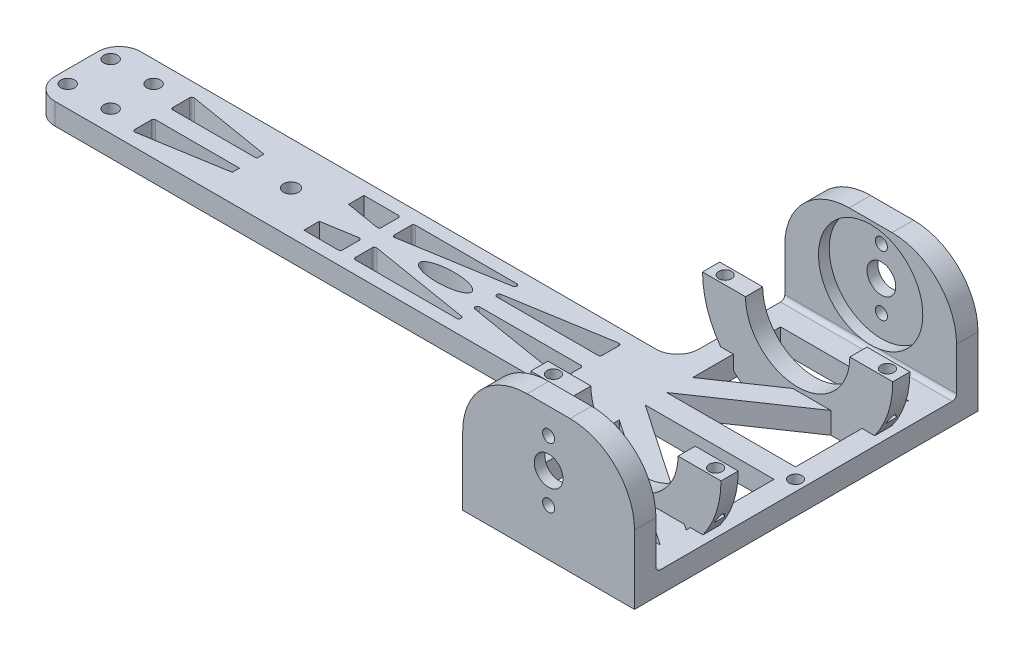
ISO-10303-21;
HEADER;
FILE_DESCRIPTION(('STEP AP214'),'2;1');
FILE_NAME('part.step','',(''),(''),'','','');
FILE_SCHEMA(('AUTOMOTIVE_DESIGN { 1 0 10303 214 1 1 1 1 }'));
ENDSEC;
DATA;
#1=APPLICATION_CONTEXT('core data for automotive mechanical design processes');
#2=APPLICATION_PROTOCOL_DEFINITION('international standard','automotive_design',2000,#1);
#3=PRODUCT_CONTEXT('',#1,'mechanical');
#4=PRODUCT('Part','Part','',(#3));
#5=PRODUCT_RELATED_PRODUCT_CATEGORY('part','',(#4));
#6=PRODUCT_DEFINITION_FORMATION('','',#4);
#7=PRODUCT_DEFINITION_CONTEXT('part definition',#1,'design');
#8=PRODUCT_DEFINITION('design','',#6,#7);
#9=PRODUCT_DEFINITION_SHAPE('','',#8);
#10=(LENGTH_UNIT() NAMED_UNIT(*) SI_UNIT(.MILLI.,.METRE.));
#11=(NAMED_UNIT(*) PLANE_ANGLE_UNIT() SI_UNIT($,.RADIAN.));
#12=(NAMED_UNIT(*) SI_UNIT($,.STERADIAN.) SOLID_ANGLE_UNIT());
#13=UNCERTAINTY_MEASURE_WITH_UNIT(LENGTH_MEASURE(1.E-05),#10,'distance_accuracy_value','');
#14=(GEOMETRIC_REPRESENTATION_CONTEXT(3) GLOBAL_UNCERTAINTY_ASSIGNED_CONTEXT((#13)) GLOBAL_UNIT_ASSIGNED_CONTEXT((#10,
#11,#12)) REPRESENTATION_CONTEXT('',''));
#15=CARTESIAN_POINT('',(0.,0.,0.));
#16=DIRECTION('',(0.,0.,1.));
#17=DIRECTION('',(1.,0.,0.));
#18=AXIS2_PLACEMENT_3D('',#15,#16,#17);
#19=CARTESIAN_POINT('',(20.,18.,22.));
#20=DIRECTION('',(0.,0.,-1.));
#21=DIRECTION('',(-1.,0.,0.));
#22=AXIS2_PLACEMENT_3D('',#19,#20,#21);
#23=CYLINDRICAL_SURFACE('',#22,22.15);
#24=CARTESIAN_POINT('',(20.,18.,12.7244622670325));
#25=DIRECTION('',(-0.563231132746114,0.,0.826299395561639));
#26=DIRECTION('',(-0.826299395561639,0.,-0.563231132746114));
#27=AXIS2_PLACEMENT_3D('',#24,#25,#26);
#28=ELLIPSE('',#27,26.8062643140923,22.15);
#29=CARTESIAN_POINT('',(33.6078614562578,0.52291195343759,22.));
#30=VERTEX_POINT('',#29);
#31=CARTESIAN_POINT('',(32.9082338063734,0.,21.5231122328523));
#32=VERTEX_POINT('',#31);
#33=EDGE_CURVE('E1312',#30,#32,#28,.F.);
#34=ORIENTED_EDGE('',*,*,#33,.T.);
#35=DIRECTION('',(0.,0.,-1.));
#36=VECTOR('',#35,1.);
#37=CARTESIAN_POINT('',(32.9082338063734,0.,22.));
#38=LINE('',#37,#36);
#39=CARTESIAN_POINT('',(32.9082338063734,0.,18.));
#40=VERTEX_POINT('',#39);
#41=EDGE_CURVE('E1692',#32,#40,#38,.T.);
#42=ORIENTED_EDGE('',*,*,#41,.T.);
#43=CARTESIAN_POINT('',(20.,18.,18.));
#44=DIRECTION('',(0.,0.,1.));
#45=DIRECTION('',(-1.,0.,0.));
#46=AXIS2_PLACEMENT_3D('',#43,#44,#45);
#47=CIRCLE('',#46,22.15);
#48=CARTESIAN_POINT('',(35.,1.70207068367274,18.));
#49=VERTEX_POINT('',#48);
#50=EDGE_CURVE('E2003',#40,#49,#47,.T.);
#51=ORIENTED_EDGE('',*,*,#50,.T.);
#52=DIRECTION('',(0.,0.,-1.));
#53=VECTOR('',#52,1.);
#54=CARTESIAN_POINT('',(35.,1.70207068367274,22.));
#55=LINE('',#54,#53);
#56=CARTESIAN_POINT('',(35.,1.70207068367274,22.));
#57=VERTEX_POINT('',#56);
#58=EDGE_CURVE('E2136',#49,#57,#55,.F.);
#59=ORIENTED_EDGE('',*,*,#58,.T.);
#60=CARTESIAN_POINT('',(20.,18.,22.));
#61=DIRECTION('',(0.,0.,1.));
#62=DIRECTION('',(-1.,0.,0.));
#63=AXIS2_PLACEMENT_3D('',#60,#61,#62);
#64=CIRCLE('',#63,22.15);
#65=EDGE_CURVE('E1290',#30,#57,#64,.T.);
#66=ORIENTED_EDGE('',*,*,#65,.F.);
#67=EDGE_LOOP('',(#34,#42,#51,#59,#66));
#68=FACE_BOUND('',#67,.T.);
#69=ADVANCED_FACE('F45',(#68),#23,.T.);
#70=CARTESIAN_POINT('',(20.,18.,-22.));
#71=DIRECTION('',(0.,0.,1.));
#72=DIRECTION('',(-1.,0.,0.));
#73=AXIS2_PLACEMENT_3D('',#70,#71,#72);
#74=CYLINDRICAL_SURFACE('',#73,22.15);
#75=CARTESIAN_POINT('',(20.,18.,-22.));
#76=DIRECTION('',(0.,0.,1.));
#77=DIRECTION('',(-1.,0.,0.));
#78=AXIS2_PLACEMENT_3D('',#75,#76,#77);
#79=CIRCLE('',#78,22.15);
#80=CARTESIAN_POINT('',(5.,1.70207068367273,-22.));
#81=VERTEX_POINT('',#80);
#82=CARTESIAN_POINT('',(7.09176619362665,0.,-22.));
#83=VERTEX_POINT('',#82);
#84=EDGE_CURVE('E802',#81,#83,#79,.T.);
#85=ORIENTED_EDGE('',*,*,#84,.T.);
#86=DIRECTION('',(0.,0.,1.));
#87=VECTOR('',#86,1.);
#88=CARTESIAN_POINT('',(7.09176619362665,0.,-22.));
#89=LINE('',#88,#87);
#90=CARTESIAN_POINT('',(7.09176619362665,0.,-18.));
#91=VERTEX_POINT('',#90);
#92=EDGE_CURVE('E785',#83,#91,#89,.T.);
#93=ORIENTED_EDGE('',*,*,#92,.T.);
#94=CARTESIAN_POINT('',(20.,18.,-18.));
#95=DIRECTION('',(0.,0.,1.));
#96=DIRECTION('',(-1.,0.,0.));
#97=AXIS2_PLACEMENT_3D('',#94,#95,#96);
#98=CIRCLE('',#97,22.15);
#99=CARTESIAN_POINT('',(5.,1.70207068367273,-18.));
#100=VERTEX_POINT('',#99);
#101=EDGE_CURVE('E800',#100,#91,#98,.T.);
#102=ORIENTED_EDGE('',*,*,#101,.F.);
#103=DIRECTION('',(0.,0.,1.));
#104=VECTOR('',#103,1.);
#105=CARTESIAN_POINT('',(5.,1.70207068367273,-22.));
#106=LINE('',#105,#104);
#107=EDGE_CURVE('E2727',#81,#100,#106,.T.);
#108=ORIENTED_EDGE('',*,*,#107,.F.);
#109=EDGE_LOOP('',(#85,#93,#102,#108));
#110=FACE_BOUND('',#109,.T.);
#111=ADVANCED_FACE('F798',(#110),#74,.T.);
#112=CARTESIAN_POINT('',(0.,5.,0.));
#113=DIRECTION('',(0.,-1.,0.));
#114=DIRECTION('',(0.,0.,-1.));
#115=AXIS2_PLACEMENT_3D('',#112,#113,#114);
#116=PLANE('',#115);
#117=CARTESIAN_POINT('',(-80.,5.,0.));
#118=DIRECTION('',(0.,-1.,0.));
#119=DIRECTION('',(0.,0.,-1.));
#120=AXIS2_PLACEMENT_3D('',#117,#118,#119);
#121=CIRCLE('',#120,1.75);
#122=CARTESIAN_POINT('',(-80.,5.,-1.75));
#123=VERTEX_POINT('',#122);
#124=EDGE_CURVE('E1703',#123,#123,#121,.T.);
#125=ORIENTED_EDGE('',*,*,#124,.T.);
#126=EDGE_LOOP('',(#125));
#127=FACE_BOUND('',#126,.T.);
#128=CARTESIAN_POINT('',(37.5,5.,0.));
#129=DIRECTION('',(0.,-1.,0.));
#130=DIRECTION('',(0.,0.,-1.));
#131=AXIS2_PLACEMENT_3D('',#128,#129,#130);
#132=CIRCLE('',#131,1.5);
#133=CARTESIAN_POINT('',(37.5,5.,-1.5));
#134=VERTEX_POINT('',#133);
#135=EDGE_CURVE('E1684',#134,#134,#132,.T.);
#136=ORIENTED_EDGE('',*,*,#135,.T.);
#137=EDGE_LOOP('',(#136));
#138=FACE_BOUND('',#137,.T.);
#139=DIRECTION('',(0.,0.,1.));
#140=VECTOR('',#139,1.);
#141=CARTESIAN_POINT('',(-90.,5.,10.));
#142=LINE('',#141,#140);
#143=CARTESIAN_POINT('',(-90.,5.,2.));
#144=VERTEX_POINT('',#143);
#145=CARTESIAN_POINT('',(-90.,5.,3.68414375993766));
#146=VERTEX_POINT('',#145);
#147=EDGE_CURVE('E1714',#144,#146,#142,.T.);
#148=ORIENTED_EDGE('',*,*,#147,.T.);
#149=DIRECTION('',(0.986533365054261,0.,-0.163560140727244));
#150=VECTOR('',#149,1.);
#151=CARTESIAN_POINT('',(-110.,5.,7.));
#152=LINE('',#151,#150);
#153=CARTESIAN_POINT('',(-109.418219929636,5.,6.90354504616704));
#154=VERTEX_POINT('',#153);
#155=EDGE_CURVE('E1428',#154,#146,#152,.T.);
#156=ORIENTED_EDGE('',*,*,#155,.F.);
#157=CARTESIAN_POINT('',(-109.5,5.,6.41027836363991));
#158=DIRECTION('',(0.,-1.,0.));
#159=DIRECTION('',(0.,0.,-1.));
#160=AXIS2_PLACEMENT_3D('',#157,#158,#159);
#161=CIRCLE('',#160,0.5);
#162=CARTESIAN_POINT('',(-110.,5.,6.41027836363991));
#163=VERTEX_POINT('',#162);
#164=EDGE_CURVE('E2270',#154,#163,#161,.T.);
#165=ORIENTED_EDGE('',*,*,#164,.T.);
#166=DIRECTION('',(0.,0.,1.));
#167=VECTOR('',#166,1.);
#168=CARTESIAN_POINT('',(-110.,5.,2.));
#169=LINE('',#168,#167);
#170=CARTESIAN_POINT('',(-110.,5.,2.5));
#171=VERTEX_POINT('',#170);
#172=EDGE_CURVE('E1398',#171,#163,#169,.T.);
#173=ORIENTED_EDGE('',*,*,#172,.F.);
#174=CARTESIAN_POINT('',(-109.5,5.,2.5));
#175=DIRECTION('',(0.,-1.,0.));
#176=DIRECTION('',(0.,0.,-1.));
#177=AXIS2_PLACEMENT_3D('',#174,#175,#176);
#178=CIRCLE('',#177,0.5);
#179=CARTESIAN_POINT('',(-109.5,5.,2.));
#180=VERTEX_POINT('',#179);
#181=EDGE_CURVE('E1638',#171,#180,#178,.T.);
#182=ORIENTED_EDGE('',*,*,#181,.T.);
#183=DIRECTION('',(-1.,0.,0.));
#184=VECTOR('',#183,1.);
#185=CARTESIAN_POINT('',(-79.8418771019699,5.,2.));
#186=LINE('',#185,#184);
#187=EDGE_CURVE('E1425',#144,#180,#186,.T.);
#188=ORIENTED_EDGE('',*,*,#187,.F.);
#189=EDGE_LOOP('',(#148,#156,#165,#173,#182,#188));
#190=FACE_BOUND('',#189,.T.);
#191=CARTESIAN_POINT('',(-90.,5.,-3.68414375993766));
#192=VERTEX_POINT('',#191);
#193=CARTESIAN_POINT('',(-90.,5.,-2.));
#194=VERTEX_POINT('',#193);
#195=EDGE_CURVE('E1718',#192,#194,#142,.T.);
#196=ORIENTED_EDGE('',*,*,#195,.T.);
#197=DIRECTION('',(-1.,0.,0.));
#198=VECTOR('',#197,1.);
#199=CARTESIAN_POINT('',(-79.8418771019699,5.,-2.));
#200=LINE('',#199,#198);
#201=CARTESIAN_POINT('',(-109.5,5.,-2.));
#202=VERTEX_POINT('',#201);
#203=EDGE_CURVE('E63',#194,#202,#200,.T.);
#204=ORIENTED_EDGE('',*,*,#203,.T.);
#205=CARTESIAN_POINT('',(-109.5,5.,-2.5));
#206=DIRECTION('',(0.,1.,0.));
#207=DIRECTION('',(0.,0.,1.));
#208=AXIS2_PLACEMENT_3D('',#205,#206,#207);
#209=CIRCLE('',#208,0.5);
#210=CARTESIAN_POINT('',(-110.,5.,-2.5));
#211=VERTEX_POINT('',#210);
#212=EDGE_CURVE('E1940',#211,#202,#209,.T.);
#213=ORIENTED_EDGE('',*,*,#212,.F.);
#214=DIRECTION('',(0.,0.,-1.));
#215=VECTOR('',#214,1.);
#216=CARTESIAN_POINT('',(-110.,5.,-2.));
#217=LINE('',#216,#215);
#218=CARTESIAN_POINT('',(-110.,5.,-6.41027836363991));
#219=VERTEX_POINT('',#218);
#220=EDGE_CURVE('E2471',#211,#219,#217,.T.);
#221=ORIENTED_EDGE('',*,*,#220,.T.);
#222=CARTESIAN_POINT('',(-109.5,5.,-6.41027836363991));
#223=DIRECTION('',(0.,1.,0.));
#224=DIRECTION('',(0.,0.,1.));
#225=AXIS2_PLACEMENT_3D('',#222,#223,#224);
#226=CIRCLE('',#225,0.5);
#227=CARTESIAN_POINT('',(-109.418219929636,5.,-6.90354504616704));
#228=VERTEX_POINT('',#227);
#229=EDGE_CURVE('E1932',#228,#219,#226,.T.);
#230=ORIENTED_EDGE('',*,*,#229,.F.);
#231=DIRECTION('',(0.986533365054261,0.,0.163560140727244));
#232=VECTOR('',#231,1.);
#233=CARTESIAN_POINT('',(-110.,5.,-7.));
#234=LINE('',#233,#232);
#235=EDGE_CURVE('E2501',#228,#192,#234,.T.);
#236=ORIENTED_EDGE('',*,*,#235,.T.);
#237=EDGE_LOOP('',(#196,#204,#213,#221,#230,#236));
#238=FACE_BOUND('',#237,.T.);
#239=DIRECTION('',(0.,0.,-1.));
#240=VECTOR('',#239,1.);
#241=CARTESIAN_POINT('',(-70.,5.,10.));
#242=LINE('',#241,#240);
#243=CARTESIAN_POINT('',(-70.,5.,-3.40923890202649));
#244=VERTEX_POINT('',#243);
#245=CARTESIAN_POINT('',(-70.,5.,-7.));
#246=VERTEX_POINT('',#245);
#247=EDGE_CURVE('E1708',#244,#246,#242,.T.);
#248=ORIENTED_EDGE('',*,*,#247,.T.);
#249=DIRECTION('',(1.,0.,0.));
#250=VECTOR('',#249,1.);
#251=CARTESIAN_POINT('',(-61.5,5.,-7.));
#252=LINE('',#251,#250);
#253=CARTESIAN_POINT('',(-62.,5.,-7.));
#254=VERTEX_POINT('',#253);
#255=EDGE_CURVE('E2426',#246,#254,#252,.T.);
#256=ORIENTED_EDGE('',*,*,#255,.T.);
#257=CARTESIAN_POINT('',(-62.,5.,-6.5));
#258=DIRECTION('',(0.,1.,0.));
#259=DIRECTION('',(0.,0.,1.));
#260=AXIS2_PLACEMENT_3D('',#257,#258,#259);
#261=CIRCLE('',#260,0.5);
#262=CARTESIAN_POINT('',(-61.5,5.,-6.5));
#263=VERTEX_POINT('',#262);
#264=EDGE_CURVE('E1916',#263,#254,#261,.T.);
#265=ORIENTED_EDGE('',*,*,#264,.F.);
#266=DIRECTION('',(0.,0.,1.));
#267=VECTOR('',#266,1.);
#268=CARTESIAN_POINT('',(-61.5,5.,-2.));
#269=LINE('',#268,#267);
#270=CARTESIAN_POINT('',(-61.5,5.,-2.58972163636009));
#271=VERTEX_POINT('',#270);
#272=EDGE_CURVE('E2421',#263,#271,#269,.T.);
#273=ORIENTED_EDGE('',*,*,#272,.T.);
#274=CARTESIAN_POINT('',(-62.,5.,-2.58972163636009));
#275=DIRECTION('',(0.,1.,0.));
#276=DIRECTION('',(0.,0.,1.));
#277=AXIS2_PLACEMENT_3D('',#274,#275,#276);
#278=CIRCLE('',#277,0.5);
#279=CARTESIAN_POINT('',(-62.0817800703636,5.,-2.09645495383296));
#280=VERTEX_POINT('',#279);
#281=EDGE_CURVE('E1924',#280,#271,#278,.T.);
#282=ORIENTED_EDGE('',*,*,#281,.F.);
#283=DIRECTION('',(-0.986533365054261,0.,-0.163560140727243));
#284=VECTOR('',#283,1.);
#285=CARTESIAN_POINT('',(-91.6581228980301,5.,-7.));
#286=LINE('',#285,#284);
#287=EDGE_CURVE('E2417',#280,#244,#286,.T.);
#288=ORIENTED_EDGE('',*,*,#287,.T.);
#289=EDGE_LOOP('',(#248,#256,#265,#273,#282,#288));
#290=FACE_BOUND('',#289,.T.);
#291=CARTESIAN_POINT('',(-70.,5.,7.));
#292=VERTEX_POINT('',#291);
#293=CARTESIAN_POINT('',(-70.,5.,3.40923890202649));
#294=VERTEX_POINT('',#293);
#295=EDGE_CURVE('E1712',#292,#294,#242,.T.);
#296=ORIENTED_EDGE('',*,*,#295,.T.);
#297=DIRECTION('',(-0.986533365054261,0.,0.163560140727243));
#298=VECTOR('',#297,1.);
#299=CARTESIAN_POINT('',(-91.6581228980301,5.,7.));
#300=LINE('',#299,#298);
#301=CARTESIAN_POINT('',(-62.0817800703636,5.,2.09645495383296));
#302=VERTEX_POINT('',#301);
#303=EDGE_CURVE('E1340',#302,#294,#300,.T.);
#304=ORIENTED_EDGE('',*,*,#303,.F.);
#305=CARTESIAN_POINT('',(-62.,5.,2.58972163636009));
#306=DIRECTION('',(0.,-1.,0.));
#307=DIRECTION('',(0.,0.,-1.));
#308=AXIS2_PLACEMENT_3D('',#305,#306,#307);
#309=CIRCLE('',#308,0.5);
#310=CARTESIAN_POINT('',(-61.5,5.,2.58972163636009));
#311=VERTEX_POINT('',#310);
#312=EDGE_CURVE('E2264',#302,#311,#309,.T.);
#313=ORIENTED_EDGE('',*,*,#312,.T.);
#314=DIRECTION('',(0.,0.,-1.));
#315=VECTOR('',#314,1.);
#316=CARTESIAN_POINT('',(-61.5,5.,2.));
#317=LINE('',#316,#315);
#318=CARTESIAN_POINT('',(-61.5,5.,6.5));
#319=VERTEX_POINT('',#318);
#320=EDGE_CURVE('E1344',#319,#311,#317,.T.);
#321=ORIENTED_EDGE('',*,*,#320,.F.);
#322=CARTESIAN_POINT('',(-62.,5.,6.5));
#323=DIRECTION('',(0.,-1.,0.));
#324=DIRECTION('',(0.,0.,-1.));
#325=AXIS2_PLACEMENT_3D('',#322,#323,#324);
#326=CIRCLE('',#325,0.5);
#327=CARTESIAN_POINT('',(-62.,5.,7.));
#328=VERTEX_POINT('',#327);
#329=EDGE_CURVE('E2257',#319,#328,#326,.T.);
#330=ORIENTED_EDGE('',*,*,#329,.T.);
#331=DIRECTION('',(1.,0.,0.));
#332=VECTOR('',#331,1.);
#333=CARTESIAN_POINT('',(-61.5,5.,7.));
#334=LINE('',#333,#332);
#335=EDGE_CURVE('E1349',#292,#328,#334,.T.);
#336=ORIENTED_EDGE('',*,*,#335,.F.);
#337=EDGE_LOOP('',(#296,#304,#313,#321,#330,#336));
#338=FACE_BOUND('',#337,.T.);
#339=CARTESIAN_POINT('',(-44.,5.,0.));
#340=DIRECTION('',(0.,1.,0.));
#341=DIRECTION('',(1.,0.,0.));
#342=AXIS2_PLACEMENT_3D('',#339,#340,#341);
#343=ELLIPSE('',#342,6.00000000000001,2.00000000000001);
#344=CARTESIAN_POINT('',(-38.,5.,0.));
#345=VERTEX_POINT('',#344);
#346=EDGE_CURVE('E1680',#345,#345,#343,.T.);
#347=ORIENTED_EDGE('',*,*,#346,.F.);
#348=EDGE_LOOP('',(#347));
#349=FACE_BOUND('',#348,.T.);
#350=DIRECTION('',(0.986533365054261,0.,0.163560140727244));
#351=VECTOR('',#350,1.);
#352=CARTESIAN_POINT('',(-40.1581228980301,5.,2.));
#353=LINE('',#352,#351);
#354=CARTESIAN_POINT('',(-34.1671111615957,5.,2.99326668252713));
#355=VERTEX_POINT('',#354);
#356=CARTESIAN_POINT('',(-10.5817800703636,5.,6.90354504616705));
#357=VERTEX_POINT('',#356);
#358=EDGE_CURVE('E1320',#355,#357,#353,.T.);
#359=ORIENTED_EDGE('',*,*,#358,.F.);
#360=CARTESIAN_POINT('',(-34.0853310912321,5.,2.5));
#361=DIRECTION('',(0.,-1.,0.));
#362=DIRECTION('',(0.,0.,-1.));
#363=AXIS2_PLACEMENT_3D('',#360,#361,#362);
#364=CIRCLE('',#363,0.5);
#365=CARTESIAN_POINT('',(-34.0853310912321,5.,2.));
#366=VERTEX_POINT('',#365);
#367=EDGE_CURVE('E2233',#355,#366,#364,.T.);
#368=ORIENTED_EDGE('',*,*,#367,.T.);
#369=DIRECTION('',(-1.,0.,0.));
#370=VECTOR('',#369,1.);
#371=CARTESIAN_POINT('',(-10.,5.,2.));
#372=LINE('',#371,#370);
#373=CARTESIAN_POINT('',(-10.5,5.,2.));
#374=VERTEX_POINT('',#373);
#375=EDGE_CURVE('E1325',#374,#366,#372,.T.);
#376=ORIENTED_EDGE('',*,*,#375,.F.);
#377=CARTESIAN_POINT('',(-10.5,5.,2.5));
#378=DIRECTION('',(0.,-1.,0.));
#379=DIRECTION('',(0.,0.,-1.));
#380=AXIS2_PLACEMENT_3D('',#377,#378,#379);
#381=CIRCLE('',#380,0.5);
#382=CARTESIAN_POINT('',(-10.,5.,2.5));
#383=VERTEX_POINT('',#382);
#384=EDGE_CURVE('E2227',#374,#383,#381,.T.);
#385=ORIENTED_EDGE('',*,*,#384,.T.);
#386=DIRECTION('',(0.,0.,-1.));
#387=VECTOR('',#386,1.);
#388=CARTESIAN_POINT('',(-10.,5.,7.00000000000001));
#389=LINE('',#388,#387);
#390=CARTESIAN_POINT('',(-10.,5.,6.41027836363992));
#391=VERTEX_POINT('',#390);
#392=EDGE_CURVE('E1316',#391,#383,#389,.T.);
#393=ORIENTED_EDGE('',*,*,#392,.F.);
#394=CARTESIAN_POINT('',(-10.5,5.,6.41027836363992));
#395=DIRECTION('',(0.,-1.,0.));
#396=DIRECTION('',(0.,0.,-1.));
#397=AXIS2_PLACEMENT_3D('',#394,#395,#396);
#398=CIRCLE('',#397,0.5);
#399=EDGE_CURVE('E2221',#391,#357,#398,.T.);
#400=ORIENTED_EDGE('',*,*,#399,.T.);
#401=EDGE_LOOP('',(#359,#368,#376,#385,#393,#400));
#402=FACE_BOUND('',#401,.T.);
#403=DIRECTION('',(0.,0.,1.));
#404=VECTOR('',#403,1.);
#405=CARTESIAN_POINT('',(-58.5,5.,2.));
#406=LINE('',#405,#404);
#407=CARTESIAN_POINT('',(-58.5,5.,2.58972163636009));
#408=VERTEX_POINT('',#407);
#409=CARTESIAN_POINT('',(-58.5,5.,6.5));
#410=VERTEX_POINT('',#409);
#411=EDGE_CURVE('E1368',#408,#410,#406,.T.);
#412=ORIENTED_EDGE('',*,*,#411,.F.);
#413=CARTESIAN_POINT('',(-58.,5.,2.58972163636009));
#414=DIRECTION('',(0.,-1.,0.));
#415=DIRECTION('',(0.,0.,-1.));
#416=AXIS2_PLACEMENT_3D('',#413,#414,#415);
#417=CIRCLE('',#416,0.5);
#418=CARTESIAN_POINT('',(-57.9182199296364,5.,2.09645495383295));
#419=VERTEX_POINT('',#418);
#420=EDGE_CURVE('E2251',#408,#419,#417,.T.);
#421=ORIENTED_EDGE('',*,*,#420,.T.);
#422=DIRECTION('',(-0.986533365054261,0.,-0.163560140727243));
#423=VECTOR('',#422,1.);
#424=CARTESIAN_POINT('',(-28.3418771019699,5.,7.));
#425=LINE('',#424,#423);
#426=CARTESIAN_POINT('',(-34.3328888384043,5.,6.00673331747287));
#427=VERTEX_POINT('',#426);
#428=EDGE_CURVE('E1358',#427,#419,#425,.T.);
#429=ORIENTED_EDGE('',*,*,#428,.F.);
#430=CARTESIAN_POINT('',(-34.4146689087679,5.,6.5));
#431=DIRECTION('',(0.,-1.,0.));
#432=DIRECTION('',(0.,0.,-1.));
#433=AXIS2_PLACEMENT_3D('',#430,#431,#432);
#434=CIRCLE('',#433,0.5);
#435=CARTESIAN_POINT('',(-34.4146689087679,5.,7.));
#436=VERTEX_POINT('',#435);
#437=EDGE_CURVE('E2239',#427,#436,#434,.T.);
#438=ORIENTED_EDGE('',*,*,#437,.T.);
#439=DIRECTION('',(1.,0.,0.));
#440=VECTOR('',#439,1.);
#441=CARTESIAN_POINT('',(-58.5,5.,7.));
#442=LINE('',#441,#440);
#443=CARTESIAN_POINT('',(-58.,5.,7.));
#444=VERTEX_POINT('',#443);
#445=EDGE_CURVE('E1364',#444,#436,#442,.T.);
#446=ORIENTED_EDGE('',*,*,#445,.F.);
#447=CARTESIAN_POINT('',(-58.,5.,6.5));
#448=DIRECTION('',(0.,-1.,0.));
#449=DIRECTION('',(0.,0.,-1.));
#450=AXIS2_PLACEMENT_3D('',#447,#448,#449);
#451=CIRCLE('',#450,0.5);
#452=EDGE_CURVE('E2245',#444,#410,#451,.T.);
#453=ORIENTED_EDGE('',*,*,#452,.T.);
#454=EDGE_LOOP('',(#412,#421,#429,#438,#446,#453));
#455=FACE_BOUND('',#454,.T.);
#456=DIRECTION('',(1.,0.,0.));
#457=VECTOR('',#456,1.);
#458=CARTESIAN_POINT('',(0.,5.,22.));
#459=LINE('',#458,#457);
#460=CARTESIAN_POINT('',(24.7305112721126,5.,22.));
#461=VERTEX_POINT('',#460);
#462=CARTESIAN_POINT('',(33.6078614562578,5.,22.));
#463=VERTEX_POINT('',#462);
#464=EDGE_CURVE('E2065',#461,#463,#459,.T.);
#465=ORIENTED_EDGE('',*,*,#464,.F.);
#466=DIRECTION('',(-0.826299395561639,0.,-0.563231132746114));
#467=VECTOR('',#466,1.);
#468=CARTESIAN_POINT('',(5.,5.,8.55107546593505));
#469=LINE('',#468,#467);
#470=CARTESIAN_POINT('',(35.,5.,29.));
#471=VERTEX_POINT('',#470);
#472=EDGE_CURVE('E1463',#471,#461,#469,.T.);
#473=ORIENTED_EDGE('',*,*,#472,.F.);
#474=DIRECTION('',(1.,0.,0.));
#475=VECTOR('',#474,1.);
#476=CARTESIAN_POINT('',(35.,5.,29.));
#477=LINE('',#476,#475);
#478=CARTESIAN_POINT('',(5.,5.,29.));
#479=VERTEX_POINT('',#478);
#480=EDGE_CURVE('E1413',#479,#471,#477,.T.);
#481=ORIENTED_EDGE('',*,*,#480,.F.);
#482=DIRECTION('',(0.,0.,1.));
#483=VECTOR('',#482,1.);
#484=CARTESIAN_POINT('',(5.,5.,29.));
#485=LINE('',#484,#483);
#486=CARTESIAN_POINT('',(5.,5.,22.));
#487=VERTEX_POINT('',#486);
#488=EDGE_CURVE('E1467',#487,#479,#485,.T.);
#489=ORIENTED_EDGE('',*,*,#488,.F.);
#490=CARTESIAN_POINT('',(2.0661632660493,5.,22.));
#491=VERTEX_POINT('',#490);
#492=EDGE_CURVE('E2064',#491,#487,#459,.T.);
#493=ORIENTED_EDGE('',*,*,#492,.F.);
#494=DIRECTION('',(0.,0.,-1.));
#495=VECTOR('',#494,1.);
#496=CARTESIAN_POINT('',(2.0661632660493,5.,22.));
#497=LINE('',#496,#495);
#498=CARTESIAN_POINT('',(2.0661632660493,5.,18.));
#499=VERTEX_POINT('',#498);
#500=EDGE_CURVE('E1304',#499,#491,#497,.F.);
#501=ORIENTED_EDGE('',*,*,#500,.F.);
#502=DIRECTION('',(1.,0.,0.));
#503=VECTOR('',#502,1.);
#504=CARTESIAN_POINT('',(0.,5.,18.));
#505=LINE('',#504,#503);
#506=CARTESIAN_POINT('',(5.,5.,18.));
#507=VERTEX_POINT('',#506);
#508=EDGE_CURVE('E2044',#499,#507,#505,.T.);
#509=ORIENTED_EDGE('',*,*,#508,.T.);
#510=CARTESIAN_POINT('',(5.,5.,8.55107546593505));
#511=VERTEX_POINT('',#510);
#512=EDGE_CURVE('E1450',#511,#507,#485,.T.);
#513=ORIENTED_EDGE('',*,*,#512,.F.);
#514=CARTESIAN_POINT('',(18.8622319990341,5.,18.));
#515=VERTEX_POINT('',#514);
#516=EDGE_CURVE('E1462',#515,#511,#469,.T.);
#517=ORIENTED_EDGE('',*,*,#516,.F.);
#518=CARTESIAN_POINT('',(27.7395821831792,5.,18.));
#519=VERTEX_POINT('',#518);
#520=EDGE_CURVE('E2045',#515,#519,#505,.T.);
#521=ORIENTED_EDGE('',*,*,#520,.T.);
#522=DIRECTION('',(0.826299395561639,0.,0.563231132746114));
#523=VECTOR('',#522,1.);
#524=CARTESIAN_POINT('',(35.,5.,22.948924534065));
#525=LINE('',#524,#523);
#526=CARTESIAN_POINT('',(5.,5.,2.5));
#527=VERTEX_POINT('',#526);
#528=EDGE_CURVE('E1409',#527,#519,#525,.T.);
#529=ORIENTED_EDGE('',*,*,#528,.F.);
#530=DIRECTION('',(-1.,0.,0.));
#531=VECTOR('',#530,1.);
#532=CARTESIAN_POINT('',(5.,5.,2.5));
#533=LINE('',#532,#531);
#534=CARTESIAN_POINT('',(35.,5.,2.5));
#535=VERTEX_POINT('',#534);
#536=EDGE_CURVE('E1399',#535,#527,#533,.T.);
#537=ORIENTED_EDGE('',*,*,#536,.F.);
#538=DIRECTION('',(0.,0.,-1.));
#539=VECTOR('',#538,1.);
#540=CARTESIAN_POINT('',(35.,5.,2.5));
#541=LINE('',#540,#539);
#542=CARTESIAN_POINT('',(35.,5.,18.));
#543=VERTEX_POINT('',#542);
#544=EDGE_CURVE('E1403',#543,#535,#541,.T.);
#545=ORIENTED_EDGE('',*,*,#544,.F.);
#546=CARTESIAN_POINT('',(37.9338367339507,5.,18.));
#547=VERTEX_POINT('',#546);
#548=EDGE_CURVE('E1302',#543,#547,#505,.T.);
#549=ORIENTED_EDGE('',*,*,#548,.T.);
#550=DIRECTION('',(0.,0.,-1.));
#551=VECTOR('',#550,1.);
#552=CARTESIAN_POINT('',(37.9338367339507,5.,22.));
#553=LINE('',#552,#551);
#554=CARTESIAN_POINT('',(37.9338367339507,5.,22.));
#555=VERTEX_POINT('',#554);
#556=EDGE_CURVE('E1283',#555,#547,#553,.T.);
#557=ORIENTED_EDGE('',*,*,#556,.F.);
#558=CARTESIAN_POINT('',(35.,5.,22.));
#559=VERTEX_POINT('',#558);
#560=EDGE_CURVE('E1299',#559,#555,#459,.T.);
#561=ORIENTED_EDGE('',*,*,#560,.F.);
#562=CARTESIAN_POINT('',(35.,5.,22.948924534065));
#563=VERTEX_POINT('',#562);
#564=EDGE_CURVE('E1405',#563,#559,#541,.T.);
#565=ORIENTED_EDGE('',*,*,#564,.F.);
#566=EDGE_CURVE('E1408',#463,#563,#525,.T.);
#567=ORIENTED_EDGE('',*,*,#566,.F.);
#568=EDGE_LOOP('',(#465,#473,#481,#489,#493,#501,#509,#513,#517,#521,#529,#537,#545,#549,#557,
#561,#565,#567));
#569=FACE_BOUND('',#568,.T.);
#570=DIRECTION('',(0.986533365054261,0.,-0.163560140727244));
#571=VECTOR('',#570,1.);
#572=CARTESIAN_POINT('',(-40.1581228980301,5.,-2.));
#573=LINE('',#572,#571);
#574=CARTESIAN_POINT('',(-34.1671111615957,5.,-2.99326668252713));
#575=VERTEX_POINT('',#574);
#576=CARTESIAN_POINT('',(-10.5817800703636,5.,-6.90354504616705));
#577=VERTEX_POINT('',#576);
#578=EDGE_CURVE('E2715',#575,#577,#573,.T.);
#579=ORIENTED_EDGE('',*,*,#578,.T.);
#580=CARTESIAN_POINT('',(-10.5,5.,-6.41027836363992));
#581=DIRECTION('',(0.,1.,0.));
#582=DIRECTION('',(0.,0.,1.));
#583=AXIS2_PLACEMENT_3D('',#580,#581,#582);
#584=CIRCLE('',#583,0.5);
#585=CARTESIAN_POINT('',(-10.,5.,-6.41027836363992));
#586=VERTEX_POINT('',#585);
#587=EDGE_CURVE('E1868',#586,#577,#584,.T.);
#588=ORIENTED_EDGE('',*,*,#587,.F.);
#589=DIRECTION('',(0.,0.,1.));
#590=VECTOR('',#589,1.);
#591=CARTESIAN_POINT('',(-10.,5.,-7.00000000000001));
#592=LINE('',#591,#590);
#593=CARTESIAN_POINT('',(-10.,5.,-2.5));
#594=VERTEX_POINT('',#593);
#595=EDGE_CURVE('E2416',#586,#594,#592,.T.);
#596=ORIENTED_EDGE('',*,*,#595,.T.);
#597=CARTESIAN_POINT('',(-10.5,5.,-2.5));
#598=DIRECTION('',(0.,1.,0.));
#599=DIRECTION('',(0.,0.,1.));
#600=AXIS2_PLACEMENT_3D('',#597,#598,#599);
#601=CIRCLE('',#600,0.5);
#602=CARTESIAN_POINT('',(-10.5,5.,-2.));
#603=VERTEX_POINT('',#602);
#604=EDGE_CURVE('E1876',#603,#594,#601,.T.);
#605=ORIENTED_EDGE('',*,*,#604,.F.);
#606=DIRECTION('',(-1.,0.,0.));
#607=VECTOR('',#606,1.);
#608=CARTESIAN_POINT('',(-10.,5.,-2.));
#609=LINE('',#608,#607);
#610=CARTESIAN_POINT('',(-34.0853310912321,5.,-2.));
#611=VERTEX_POINT('',#610);
#612=EDGE_CURVE('E2410',#603,#611,#609,.T.);
#613=ORIENTED_EDGE('',*,*,#612,.T.);
#614=CARTESIAN_POINT('',(-34.0853310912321,5.,-2.5));
#615=DIRECTION('',(0.,1.,0.));
#616=DIRECTION('',(0.,0.,1.));
#617=AXIS2_PLACEMENT_3D('',#614,#615,#616);
#618=CIRCLE('',#617,0.5);
#619=EDGE_CURVE('E1884',#575,#611,#618,.T.);
#620=ORIENTED_EDGE('',*,*,#619,.F.);
#621=EDGE_LOOP('',(#579,#588,#596,#605,#613,#620));
#622=FACE_BOUND('',#621,.T.);
#623=CARTESIAN_POINT('',(-4.99999999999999,5.,-15.));
#624=DIRECTION('',(0.,1.,0.));
#625=DIRECTION('',(0.,0.,1.));
#626=AXIS2_PLACEMENT_3D('',#623,#624,#625);
#627=CIRCLE('',#626,5.);
#628=CARTESIAN_POINT('',(-4.99999999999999,5.,-9.99999999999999));
#629=VERTEX_POINT('',#628);
#630=CARTESIAN_POINT('',(0.,5.,-15.));
#631=VERTEX_POINT('',#630);
#632=EDGE_CURVE('E2643',#629,#631,#627,.T.);
#633=ORIENTED_EDGE('',*,*,#632,.F.);
#634=DIRECTION('',(1.,0.,0.));
#635=VECTOR('',#634,1.);
#636=CARTESIAN_POINT('',(0.,5.,-9.99999999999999));
#637=LINE('',#636,#635);
#638=CARTESIAN_POINT('',(-125.,5.,-10.));
#639=VERTEX_POINT('',#638);
#640=EDGE_CURVE('E2594',#639,#629,#637,.T.);
#641=ORIENTED_EDGE('',*,*,#640,.F.);
#642=CARTESIAN_POINT('',(-125.,5.,-5.));
#643=DIRECTION('',(0.,1.,0.));
#644=DIRECTION('',(0.,0.,1.));
#645=AXIS2_PLACEMENT_3D('',#642,#643,#644);
#646=CIRCLE('',#645,5.);
#647=CARTESIAN_POINT('',(-130.,5.,-5.));
#648=VERTEX_POINT('',#647);
#649=EDGE_CURVE('E2635',#648,#639,#646,.F.);
#650=ORIENTED_EDGE('',*,*,#649,.F.);
#651=DIRECTION('',(0.,0.,1.));
#652=VECTOR('',#651,1.);
#653=CARTESIAN_POINT('',(-130.,5.,10.));
#654=LINE('',#653,#652);
#655=CARTESIAN_POINT('',(-130.,5.,5.));
#656=VERTEX_POINT('',#655);
#657=EDGE_CURVE('E1528',#648,#656,#654,.T.);
#658=ORIENTED_EDGE('',*,*,#657,.T.);
#659=CARTESIAN_POINT('',(-125.,5.,5.));
#660=DIRECTION('',(0.,-1.,0.));
#661=DIRECTION('',(0.,0.,-1.));
#662=AXIS2_PLACEMENT_3D('',#659,#660,#661);
#663=CIRCLE('',#662,5.);
#664=CARTESIAN_POINT('',(-125.,5.,10.));
#665=VERTEX_POINT('',#664);
#666=EDGE_CURVE('E1580',#656,#665,#663,.F.);
#667=ORIENTED_EDGE('',*,*,#666,.T.);
#668=DIRECTION('',(1.,0.,0.));
#669=VECTOR('',#668,1.);
#670=CARTESIAN_POINT('',(0.,5.,9.99999999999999));
#671=LINE('',#670,#669);
#672=CARTESIAN_POINT('',(-4.99999999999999,5.,9.99999999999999));
#673=VERTEX_POINT('',#672);
#674=EDGE_CURVE('E1533',#665,#673,#671,.T.);
#675=ORIENTED_EDGE('',*,*,#674,.T.);
#676=CARTESIAN_POINT('',(-4.99999999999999,5.,15.));
#677=DIRECTION('',(0.,-1.,0.));
#678=DIRECTION('',(0.,0.,-1.));
#679=AXIS2_PLACEMENT_3D('',#676,#677,#678);
#680=CIRCLE('',#679,5.);
#681=CARTESIAN_POINT('',(0.,5.,15.));
#682=VERTEX_POINT('',#681);
#683=EDGE_CURVE('E1587',#673,#682,#680,.T.);
#684=ORIENTED_EDGE('',*,*,#683,.T.);
#685=DIRECTION('',(0.,0.,1.));
#686=VECTOR('',#685,1.);
#687=CARTESIAN_POINT('',(0.,5.,40.));
#688=LINE('',#687,#686);
#689=CARTESIAN_POINT('',(0.,5.,34.));
#690=VERTEX_POINT('',#689);
#691=EDGE_CURVE('E1536',#682,#690,#688,.T.);
#692=ORIENTED_EDGE('',*,*,#691,.T.);
#693=DIRECTION('',(1.,0.,0.));
#694=VECTOR('',#693,1.);
#695=CARTESIAN_POINT('',(40.,5.,34.));
#696=LINE('',#695,#694);
#697=CARTESIAN_POINT('',(40.,5.,34.));
#698=VERTEX_POINT('',#697);
#699=EDGE_CURVE('E1590',#690,#698,#696,.T.);
#700=ORIENTED_EDGE('',*,*,#699,.T.);
#701=DIRECTION('',(0.,0.,-1.));
#702=VECTOR('',#701,1.);
#703=CARTESIAN_POINT('',(40.,5.,0.));
#704=LINE('',#703,#702);
#705=CARTESIAN_POINT('',(40.,5.,-34.));
#706=VERTEX_POINT('',#705);
#707=EDGE_CURVE('E1525',#698,#706,#704,.T.);
#708=ORIENTED_EDGE('',*,*,#707,.T.);
#709=DIRECTION('',(1.,0.,0.));
#710=VECTOR('',#709,1.);
#711=CARTESIAN_POINT('',(40.,5.,-34.));
#712=LINE('',#711,#710);
#713=CARTESIAN_POINT('',(0.,5.,-34.));
#714=VERTEX_POINT('',#713);
#715=EDGE_CURVE('E2647',#714,#706,#712,.T.);
#716=ORIENTED_EDGE('',*,*,#715,.F.);
#717=DIRECTION('',(0.,0.,-1.));
#718=VECTOR('',#717,1.);
#719=CARTESIAN_POINT('',(0.,5.,-40.));
#720=LINE('',#719,#718);
#721=EDGE_CURVE('E2597',#631,#714,#720,.T.);
#722=ORIENTED_EDGE('',*,*,#721,.F.);
#723=EDGE_LOOP('',(#633,#641,#650,#658,#667,#675,#684,#692,#700,#708,#716,#722));
#724=FACE_BOUND('',#723,.T.);
#725=DIRECTION('',(0.,0.,-1.));
#726=VECTOR('',#725,1.);
#727=CARTESIAN_POINT('',(-58.5,5.,-2.));
#728=LINE('',#727,#726);
#729=CARTESIAN_POINT('',(-58.5,5.,-2.58972163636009));
#730=VERTEX_POINT('',#729);
#731=CARTESIAN_POINT('',(-58.5,5.,-6.5));
#732=VERTEX_POINT('',#731);
#733=EDGE_CURVE('E2444',#730,#732,#728,.T.);
#734=ORIENTED_EDGE('',*,*,#733,.T.);
#735=CARTESIAN_POINT('',(-58.,5.,-6.5));
#736=DIRECTION('',(0.,1.,0.));
#737=DIRECTION('',(0.,0.,1.));
#738=AXIS2_PLACEMENT_3D('',#735,#736,#737);
#739=CIRCLE('',#738,0.5);
#740=CARTESIAN_POINT('',(-58.,5.,-7.));
#741=VERTEX_POINT('',#740);
#742=EDGE_CURVE('E1900',#741,#732,#739,.T.);
#743=ORIENTED_EDGE('',*,*,#742,.F.);
#744=DIRECTION('',(1.,0.,0.));
#745=VECTOR('',#744,1.);
#746=CARTESIAN_POINT('',(-58.5,5.,-7.));
#747=LINE('',#746,#745);
#748=CARTESIAN_POINT('',(-34.4146689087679,5.,-7.));
#749=VERTEX_POINT('',#748);
#750=EDGE_CURVE('E2440',#741,#749,#747,.T.);
#751=ORIENTED_EDGE('',*,*,#750,.T.);
#752=CARTESIAN_POINT('',(-34.4146689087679,5.,-6.5));
#753=DIRECTION('',(0.,1.,0.));
#754=DIRECTION('',(0.,0.,1.));
#755=AXIS2_PLACEMENT_3D('',#752,#753,#754);
#756=CIRCLE('',#755,0.5);
#757=CARTESIAN_POINT('',(-34.3328888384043,5.,-6.00673331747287));
#758=VERTEX_POINT('',#757);
#759=EDGE_CURVE('E1892',#758,#749,#756,.T.);
#760=ORIENTED_EDGE('',*,*,#759,.F.);
#761=DIRECTION('',(-0.986533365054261,0.,0.163560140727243));
#762=VECTOR('',#761,1.);
#763=CARTESIAN_POINT('',(-28.3418771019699,5.,-7.));
#764=LINE('',#763,#762);
#765=CARTESIAN_POINT('',(-57.9182199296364,5.,-2.09645495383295));
#766=VERTEX_POINT('',#765);
#767=EDGE_CURVE('E2434',#758,#766,#764,.T.);
#768=ORIENTED_EDGE('',*,*,#767,.T.);
#769=CARTESIAN_POINT('',(-58.,5.,-2.58972163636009));
#770=DIRECTION('',(0.,1.,0.));
#771=DIRECTION('',(0.,0.,1.));
#772=AXIS2_PLACEMENT_3D('',#769,#770,#771);
#773=CIRCLE('',#772,0.5);
#774=EDGE_CURVE('E1908',#730,#766,#773,.T.);
#775=ORIENTED_EDGE('',*,*,#774,.F.);
#776=EDGE_LOOP('',(#734,#743,#751,#760,#768,#775));
#777=FACE_BOUND('',#776,.T.);
#778=DIRECTION('',(1.,0.,0.));
#779=VECTOR('',#778,1.);
#780=CARTESIAN_POINT('',(0.,5.,-22.));
#781=LINE('',#780,#779);
#782=CARTESIAN_POINT('',(24.7305112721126,5.,-22.));
#783=VERTEX_POINT('',#782);
#784=CARTESIAN_POINT('',(33.6078614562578,5.,-22.));
#785=VERTEX_POINT('',#784);
#786=EDGE_CURVE('E2742',#783,#785,#781,.T.);
#787=ORIENTED_EDGE('',*,*,#786,.T.);
#788=DIRECTION('',(0.826299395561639,0.,-0.563231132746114));
#789=VECTOR('',#788,1.);
#790=CARTESIAN_POINT('',(35.,5.,-22.948924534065));
#791=LINE('',#790,#789);
#792=CARTESIAN_POINT('',(35.,5.,-22.948924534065));
#793=VERTEX_POINT('',#792);
#794=EDGE_CURVE('E2482',#785,#793,#791,.T.);
#795=ORIENTED_EDGE('',*,*,#794,.T.);
#796=DIRECTION('',(0.,0.,1.));
#797=VECTOR('',#796,1.);
#798=CARTESIAN_POINT('',(35.,5.,-2.5));
#799=LINE('',#798,#797);
#800=CARTESIAN_POINT('',(35.,5.,-22.));
#801=VERTEX_POINT('',#800);
#802=EDGE_CURVE('E2478',#793,#801,#799,.T.);
#803=ORIENTED_EDGE('',*,*,#802,.T.);
#804=CARTESIAN_POINT('',(37.9338367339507,5.,-22.));
#805=VERTEX_POINT('',#804);
#806=EDGE_CURVE('E2747',#801,#805,#781,.T.);
#807=ORIENTED_EDGE('',*,*,#806,.T.);
#808=DIRECTION('',(0.,0.,1.));
#809=VECTOR('',#808,1.);
#810=CARTESIAN_POINT('',(37.9338367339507,5.,-22.));
#811=LINE('',#810,#809);
#812=CARTESIAN_POINT('',(37.9338367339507,5.,-18.));
#813=VERTEX_POINT('',#812);
#814=EDGE_CURVE('E2407',#805,#813,#811,.T.);
#815=ORIENTED_EDGE('',*,*,#814,.T.);
#816=DIRECTION('',(1.,0.,0.));
#817=VECTOR('',#816,1.);
#818=CARTESIAN_POINT('',(0.,5.,-18.));
#819=LINE('',#818,#817);
#820=CARTESIAN_POINT('',(35.,5.,-18.));
#821=VERTEX_POINT('',#820);
#822=EDGE_CURVE('E2762',#821,#813,#819,.T.);
#823=ORIENTED_EDGE('',*,*,#822,.F.);
#824=CARTESIAN_POINT('',(35.,5.,-2.5));
#825=VERTEX_POINT('',#824);
#826=EDGE_CURVE('E2476',#821,#825,#799,.T.);
#827=ORIENTED_EDGE('',*,*,#826,.T.);
#828=DIRECTION('',(-1.,0.,0.));
#829=VECTOR('',#828,1.);
#830=CARTESIAN_POINT('',(5.,5.,-2.5));
#831=LINE('',#830,#829);
#832=CARTESIAN_POINT('',(5.,5.,-2.5));
#833=VERTEX_POINT('',#832);
#834=EDGE_CURVE('E2472',#825,#833,#831,.T.);
#835=ORIENTED_EDGE('',*,*,#834,.T.);
#836=CARTESIAN_POINT('',(27.7395821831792,5.,-18.));
#837=VERTEX_POINT('',#836);
#838=EDGE_CURVE('E2483',#833,#837,#791,.T.);
#839=ORIENTED_EDGE('',*,*,#838,.T.);
#840=CARTESIAN_POINT('',(18.8622319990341,5.,-18.));
#841=VERTEX_POINT('',#840);
#842=EDGE_CURVE('E2757',#841,#837,#819,.T.);
#843=ORIENTED_EDGE('',*,*,#842,.F.);
#844=DIRECTION('',(-0.826299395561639,0.,0.563231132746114));
#845=VECTOR('',#844,1.);
#846=CARTESIAN_POINT('',(5.,5.,-8.55107546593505));
#847=LINE('',#846,#845);
#848=CARTESIAN_POINT('',(5.,5.,-8.55107546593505));
#849=VERTEX_POINT('',#848);
#850=EDGE_CURVE('E2534',#841,#849,#847,.T.);
#851=ORIENTED_EDGE('',*,*,#850,.T.);
#852=DIRECTION('',(0.,0.,-1.));
#853=VECTOR('',#852,1.);
#854=CARTESIAN_POINT('',(5.,5.,-29.));
#855=LINE('',#854,#853);
#856=CARTESIAN_POINT('',(5.,5.,-18.));
#857=VERTEX_POINT('',#856);
#858=EDGE_CURVE('E2521',#849,#857,#855,.T.);
#859=ORIENTED_EDGE('',*,*,#858,.T.);
#860=CARTESIAN_POINT('',(2.0661632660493,5.,-18.));
#861=VERTEX_POINT('',#860);
#862=EDGE_CURVE('E2751',#861,#857,#819,.T.);
#863=ORIENTED_EDGE('',*,*,#862,.F.);
#864=DIRECTION('',(0.,0.,1.));
#865=VECTOR('',#864,1.);
#866=CARTESIAN_POINT('',(2.0661632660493,5.,-22.));
#867=LINE('',#866,#865);
#868=CARTESIAN_POINT('',(2.0661632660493,5.,-22.));
#869=VERTEX_POINT('',#868);
#870=EDGE_CURVE('E2399',#861,#869,#867,.F.);
#871=ORIENTED_EDGE('',*,*,#870,.T.);
#872=CARTESIAN_POINT('',(5.,5.,-22.));
#873=VERTEX_POINT('',#872);
#874=EDGE_CURVE('E2734',#869,#873,#781,.T.);
#875=ORIENTED_EDGE('',*,*,#874,.T.);
#876=CARTESIAN_POINT('',(5.,5.,-29.));
#877=VERTEX_POINT('',#876);
#878=EDGE_CURVE('E2539',#873,#877,#855,.T.);
#879=ORIENTED_EDGE('',*,*,#878,.T.);
#880=DIRECTION('',(1.,0.,0.));
#881=VECTOR('',#880,1.);
#882=CARTESIAN_POINT('',(35.,5.,-29.));
#883=LINE('',#882,#881);
#884=CARTESIAN_POINT('',(35.,5.,-29.));
#885=VERTEX_POINT('',#884);
#886=EDGE_CURVE('E2487',#877,#885,#883,.T.);
#887=ORIENTED_EDGE('',*,*,#886,.T.);
#888=EDGE_CURVE('E2535',#885,#783,#847,.T.);
#889=ORIENTED_EDGE('',*,*,#888,.T.);
#890=EDGE_LOOP('',(#787,#795,#803,#807,#815,#823,#827,#835,#839,#843,#851,#859,#863,#871,#875,
#879,#887,#889));
#891=FACE_BOUND('',#890,.T.);
#892=CARTESIAN_POINT('',(-127.,5.,-5.));
#893=DIRECTION('',(0.,1.,0.));
#894=DIRECTION('',(0.,0.,1.));
#895=AXIS2_PLACEMENT_3D('',#892,#893,#894);
#896=CIRCLE('',#895,1.60000000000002);
#897=CARTESIAN_POINT('',(-127.,5.,-3.39999999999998));
#898=VERTEX_POINT('',#897);
#899=EDGE_CURVE('E1663',#898,#898,#896,.T.);
#900=ORIENTED_EDGE('',*,*,#899,.F.);
#901=EDGE_LOOP('',(#900));
#902=FACE_BOUND('',#901,.T.);
#903=CARTESIAN_POINT('',(-117.,5.,-5.));
#904=DIRECTION('',(0.,1.,0.));
#905=DIRECTION('',(0.,0.,1.));
#906=AXIS2_PLACEMENT_3D('',#903,#904,#905);
#907=CIRCLE('',#906,1.60000000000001);
#908=CARTESIAN_POINT('',(-117.,5.,-3.39999999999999));
#909=VERTEX_POINT('',#908);
#910=EDGE_CURVE('E1756',#909,#909,#907,.T.);
#911=ORIENTED_EDGE('',*,*,#910,.F.);
#912=EDGE_LOOP('',(#911));
#913=FACE_BOUND('',#912,.T.);
#914=CARTESIAN_POINT('',(-117.,5.,5.));
#915=DIRECTION('',(0.,1.,0.));
#916=DIRECTION('',(0.,0.,1.));
#917=AXIS2_PLACEMENT_3D('',#914,#915,#916);
#918=CIRCLE('',#917,1.60000000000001);
#919=CARTESIAN_POINT('',(-117.,5.,6.6));
#920=VERTEX_POINT('',#919);
#921=EDGE_CURVE('E4053',#920,#920,#918,.T.);
#922=ORIENTED_EDGE('',*,*,#921,.F.);
#923=EDGE_LOOP('',(#922));
#924=FACE_BOUND('',#923,.T.);
#925=CARTESIAN_POINT('',(-127.,5.,5.));
#926=DIRECTION('',(0.,1.,0.));
#927=DIRECTION('',(0.,0.,1.));
#928=AXIS2_PLACEMENT_3D('',#925,#926,#927);
#929=CIRCLE('',#928,1.60000000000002);
#930=CARTESIAN_POINT('',(-127.,5.,6.60000000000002));
#931=VERTEX_POINT('',#930);
#932=EDGE_CURVE('E1679',#931,#931,#929,.T.);
#933=ORIENTED_EDGE('',*,*,#932,.F.);
#934=EDGE_LOOP('',(#933));
#935=FACE_BOUND('',#934,.T.);
#936=ADVANCED_FACE('F1266',(#127,#138,#190,#238,#290,#338,#349,#402,#455,#569,#622,#724,#777,
#891,#902,#913,#924,#935),#116,.F.);
#937=CARTESIAN_POINT('',(0.,0.,0.));
#938=DIRECTION('',(0.,-1.,0.));
#939=DIRECTION('',(0.,0.,-1.));
#940=AXIS2_PLACEMENT_3D('',#937,#938,#939);
#941=PLANE('',#940);
#942=ORIENTED_EDGE('',*,*,#41,.F.);
#943=DIRECTION('',(0.826299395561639,0.,0.563231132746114));
#944=VECTOR('',#943,1.);
#945=CARTESIAN_POINT('',(35.,0.,22.948924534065));
#946=LINE('',#945,#944);
#947=CARTESIAN_POINT('',(35.,0.,22.948924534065));
#948=VERTEX_POINT('',#947);
#949=EDGE_CURVE('E1421',#32,#948,#946,.T.);
#950=ORIENTED_EDGE('',*,*,#949,.T.);
#951=DIRECTION('',(0.,0.,-1.));
#952=VECTOR('',#951,1.);
#953=CARTESIAN_POINT('',(35.,0.,2.5));
#954=LINE('',#953,#952);
#955=CARTESIAN_POINT('',(35.,0.,2.5));
#956=VERTEX_POINT('',#955);
#957=EDGE_CURVE('E1417',#948,#956,#954,.T.);
#958=ORIENTED_EDGE('',*,*,#957,.T.);
#959=DIRECTION('',(-1.,0.,0.));
#960=VECTOR('',#959,1.);
#961=CARTESIAN_POINT('',(5.,0.,2.5));
#962=LINE('',#961,#960);
#963=CARTESIAN_POINT('',(5.,0.,2.5));
#964=VERTEX_POINT('',#963);
#965=EDGE_CURVE('E1390',#956,#964,#962,.T.);
#966=ORIENTED_EDGE('',*,*,#965,.T.);
#967=CARTESIAN_POINT('',(27.7395821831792,0.,18.));
#968=VERTEX_POINT('',#967);
#969=EDGE_CURVE('E1404',#964,#968,#946,.T.);
#970=ORIENTED_EDGE('',*,*,#969,.T.);
#971=DIRECTION('',(1.,0.,0.));
#972=VECTOR('',#971,1.);
#973=CARTESIAN_POINT('',(20.,0.,18.));
#974=LINE('',#973,#972);
#975=EDGE_CURVE('E2108',#968,#40,#974,.T.);
#976=ORIENTED_EDGE('',*,*,#975,.T.);
#977=EDGE_LOOP('',(#942,#950,#958,#966,#970,#976));
#978=FACE_BOUND('',#977,.T.);
#979=DIRECTION('',(0.826299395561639,0.,-0.563231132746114));
#980=VECTOR('',#979,1.);
#981=CARTESIAN_POINT('',(35.,0.,-22.948924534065));
#982=LINE('',#981,#980);
#983=CARTESIAN_POINT('',(32.9082338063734,0.,-21.5231122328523));
#984=VERTEX_POINT('',#983);
#985=CARTESIAN_POINT('',(35.,0.,-22.948924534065));
#986=VERTEX_POINT('',#985);
#987=EDGE_CURVE('E2495',#984,#986,#982,.T.);
#988=ORIENTED_EDGE('',*,*,#987,.F.);
#989=DIRECTION('',(0.,0.,1.));
#990=VECTOR('',#989,1.);
#991=CARTESIAN_POINT('',(32.9082338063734,0.,-22.));
#992=LINE('',#991,#990);
#993=CARTESIAN_POINT('',(32.9082338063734,0.,-18.));
#994=VERTEX_POINT('',#993);
#995=EDGE_CURVE('E805',#994,#984,#992,.F.);
#996=ORIENTED_EDGE('',*,*,#995,.F.);
#997=DIRECTION('',(-1.,0.,0.));
#998=VECTOR('',#997,1.);
#999=CARTESIAN_POINT('',(20.,0.,-18.));
#1000=LINE('',#999,#998);
#1001=CARTESIAN_POINT('',(27.7395821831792,0.,-18.));
#1002=VERTEX_POINT('',#1001);
#1003=EDGE_CURVE('E794',#994,#1002,#1000,.T.);
#1004=ORIENTED_EDGE('',*,*,#1003,.T.);
#1005=CARTESIAN_POINT('',(5.,0.,-2.5));
#1006=VERTEX_POINT('',#1005);
#1007=EDGE_CURVE('E2477',#1006,#1002,#982,.T.);
#1008=ORIENTED_EDGE('',*,*,#1007,.F.);
#1009=DIRECTION('',(-1.,0.,0.));
#1010=VECTOR('',#1009,1.);
#1011=CARTESIAN_POINT('',(5.,0.,-2.5));
#1012=LINE('',#1011,#1010);
#1013=CARTESIAN_POINT('',(35.,0.,-2.5));
#1014=VERTEX_POINT('',#1013);
#1015=EDGE_CURVE('E2464',#1014,#1006,#1012,.T.);
#1016=ORIENTED_EDGE('',*,*,#1015,.F.);
#1017=DIRECTION('',(0.,0.,1.));
#1018=VECTOR('',#1017,1.);
#1019=CARTESIAN_POINT('',(35.,0.,-2.5));
#1020=LINE('',#1019,#1018);
#1021=EDGE_CURVE('E2491',#986,#1014,#1020,.T.);
#1022=ORIENTED_EDGE('',*,*,#1021,.F.);
#1023=EDGE_LOOP('',(#988,#996,#1004,#1008,#1016,#1022));
#1024=FACE_BOUND('',#1023,.T.);
#1025=CARTESIAN_POINT('',(-80.,0.,0.));
#1026=DIRECTION('',(0.,-1.,0.));
#1027=DIRECTION('',(0.,0.,-1.));
#1028=AXIS2_PLACEMENT_3D('',#1025,#1026,#1027);
#1029=CIRCLE('',#1028,1.75);
#1030=CARTESIAN_POINT('',(-80.,0.,-1.75));
#1031=VERTEX_POINT('',#1030);
#1032=EDGE_CURVE('E49',#1031,#1031,#1029,.T.);
#1033=ORIENTED_EDGE('',*,*,#1032,.F.);
#1034=EDGE_LOOP('',(#1033));
#1035=FACE_BOUND('',#1034,.T.);
#1036=CARTESIAN_POINT('',(37.5,0.,0.));
#1037=DIRECTION('',(0.,-1.,0.));
#1038=DIRECTION('',(0.,0.,-1.));
#1039=AXIS2_PLACEMENT_3D('',#1036,#1037,#1038);
#1040=CIRCLE('',#1039,1.5);
#1041=CARTESIAN_POINT('',(37.5,0.,-1.5));
#1042=VERTEX_POINT('',#1041);
#1043=EDGE_CURVE('E1681',#1042,#1042,#1040,.T.);
#1044=ORIENTED_EDGE('',*,*,#1043,.F.);
#1045=EDGE_LOOP('',(#1044));
#1046=FACE_BOUND('',#1045,.T.);
#1047=DIRECTION('',(0.986533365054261,0.,-0.163560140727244));
#1048=VECTOR('',#1047,1.);
#1049=CARTESIAN_POINT('',(-110.,0.,7.));
#1050=LINE('',#1049,#1048);
#1051=CARTESIAN_POINT('',(-109.418219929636,0.,6.90354504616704));
#1052=VERTEX_POINT('',#1051);
#1053=CARTESIAN_POINT('',(-90.,0.,3.68414375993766));
#1054=VERTEX_POINT('',#1053);
#1055=EDGE_CURVE('E1438',#1052,#1054,#1050,.T.);
#1056=ORIENTED_EDGE('',*,*,#1055,.T.);
#1057=DIRECTION('',(0.,0.,-1.));
#1058=VECTOR('',#1057,1.);
#1059=CARTESIAN_POINT('',(-90.,0.,10.));
#1060=LINE('',#1059,#1058);
#1061=CARTESIAN_POINT('',(-90.,0.,2.));
#1062=VERTEX_POINT('',#1061);
#1063=EDGE_CURVE('E1722',#1054,#1062,#1060,.T.);
#1064=ORIENTED_EDGE('',*,*,#1063,.T.);
#1065=DIRECTION('',(-1.,0.,0.));
#1066=VECTOR('',#1065,1.);
#1067=CARTESIAN_POINT('',(-79.8418771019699,0.,2.));
#1068=LINE('',#1067,#1066);
#1069=CARTESIAN_POINT('',(-109.5,0.,2.));
#1070=VERTEX_POINT('',#1069);
#1071=EDGE_CURVE('E1352',#1062,#1070,#1068,.T.);
#1072=ORIENTED_EDGE('',*,*,#1071,.T.);
#1073=CARTESIAN_POINT('',(-109.5,0.,2.5));
#1074=DIRECTION('',(0.,-1.,0.));
#1075=DIRECTION('',(0.,0.,-1.));
#1076=AXIS2_PLACEMENT_3D('',#1073,#1074,#1075);
#1077=CIRCLE('',#1076,0.5);
#1078=CARTESIAN_POINT('',(-110.,0.,2.5));
#1079=VERTEX_POINT('',#1078);
#1080=EDGE_CURVE('E1633',#1070,#1079,#1077,.F.);
#1081=ORIENTED_EDGE('',*,*,#1080,.T.);
#1082=DIRECTION('',(0.,0.,1.));
#1083=VECTOR('',#1082,1.);
#1084=CARTESIAN_POINT('',(-110.,0.,2.));
#1085=LINE('',#1084,#1083);
#1086=CARTESIAN_POINT('',(-110.,0.,6.41027836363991));
#1087=VERTEX_POINT('',#1086);
#1088=EDGE_CURVE('E1429',#1079,#1087,#1085,.T.);
#1089=ORIENTED_EDGE('',*,*,#1088,.T.);
#1090=CARTESIAN_POINT('',(-109.5,0.,6.41027836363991));
#1091=DIRECTION('',(0.,-1.,0.));
#1092=DIRECTION('',(0.,0.,-1.));
#1093=AXIS2_PLACEMENT_3D('',#1090,#1091,#1092);
#1094=CIRCLE('',#1093,0.5);
#1095=EDGE_CURVE('E2273',#1087,#1052,#1094,.F.);
#1096=ORIENTED_EDGE('',*,*,#1095,.T.);
#1097=EDGE_LOOP('',(#1056,#1064,#1072,#1081,#1089,#1096));
#1098=FACE_BOUND('',#1097,.T.);
#1099=DIRECTION('',(-1.,0.,0.));
#1100=VECTOR('',#1099,1.);
#1101=CARTESIAN_POINT('',(-79.8418771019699,0.,-2.));
#1102=LINE('',#1101,#1100);
#1103=CARTESIAN_POINT('',(-90.,0.,-2.));
#1104=VERTEX_POINT('',#1103);
#1105=CARTESIAN_POINT('',(-109.5,0.,-2.));
#1106=VERTEX_POINT('',#1105);
#1107=EDGE_CURVE('E2429',#1104,#1106,#1102,.T.);
#1108=ORIENTED_EDGE('',*,*,#1107,.F.);
#1109=CARTESIAN_POINT('',(-90.,0.,-3.68414375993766));
#1110=VERTEX_POINT('',#1109);
#1111=EDGE_CURVE('E1707',#1104,#1110,#1060,.T.);
#1112=ORIENTED_EDGE('',*,*,#1111,.T.);
#1113=DIRECTION('',(0.986533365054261,0.,0.163560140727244));
#1114=VECTOR('',#1113,1.);
#1115=CARTESIAN_POINT('',(-110.,0.,-7.));
#1116=LINE('',#1115,#1114);
#1117=CARTESIAN_POINT('',(-109.418219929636,0.,-6.90354504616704));
#1118=VERTEX_POINT('',#1117);
#1119=EDGE_CURVE('E2511',#1118,#1110,#1116,.T.);
#1120=ORIENTED_EDGE('',*,*,#1119,.F.);
#1121=CARTESIAN_POINT('',(-109.5,0.,-6.41027836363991));
#1122=DIRECTION('',(0.,1.,0.));
#1123=DIRECTION('',(0.,0.,1.));
#1124=AXIS2_PLACEMENT_3D('',#1121,#1122,#1123);
#1125=CIRCLE('',#1124,0.5);
#1126=CARTESIAN_POINT('',(-110.,0.,-6.41027836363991));
#1127=VERTEX_POINT('',#1126);
#1128=EDGE_CURVE('E1936',#1127,#1118,#1125,.F.);
#1129=ORIENTED_EDGE('',*,*,#1128,.F.);
#1130=DIRECTION('',(0.,0.,-1.));
#1131=VECTOR('',#1130,1.);
#1132=CARTESIAN_POINT('',(-110.,0.,-2.));
#1133=LINE('',#1132,#1131);
#1134=CARTESIAN_POINT('',(-110.,0.,-2.5));
#1135=VERTEX_POINT('',#1134);
#1136=EDGE_CURVE('E2502',#1135,#1127,#1133,.T.);
#1137=ORIENTED_EDGE('',*,*,#1136,.F.);
#1138=CARTESIAN_POINT('',(-109.5,0.,-2.5));
#1139=DIRECTION('',(0.,1.,0.));
#1140=DIRECTION('',(0.,0.,1.));
#1141=AXIS2_PLACEMENT_3D('',#1138,#1139,#1140);
#1142=CIRCLE('',#1141,0.5);
#1143=EDGE_CURVE('E1944',#1106,#1135,#1142,.F.);
#1144=ORIENTED_EDGE('',*,*,#1143,.F.);
#1145=EDGE_LOOP('',(#1108,#1112,#1120,#1129,#1137,#1144));
#1146=FACE_BOUND('',#1145,.T.);
#1147=DIRECTION('',(1.,0.,0.));
#1148=VECTOR('',#1147,1.);
#1149=CARTESIAN_POINT('',(-61.5,0.,-7.));
#1150=LINE('',#1149,#1148);
#1151=CARTESIAN_POINT('',(-70.,0.,-7.));
#1152=VERTEX_POINT('',#1151);
#1153=CARTESIAN_POINT('',(-62.,0.,-7.));
#1154=VERTEX_POINT('',#1153);
#1155=EDGE_CURVE('E2422',#1152,#1154,#1150,.T.);
#1156=ORIENTED_EDGE('',*,*,#1155,.F.);
#1157=DIRECTION('',(0.,0.,1.));
#1158=VECTOR('',#1157,1.);
#1159=CARTESIAN_POINT('',(-70.,0.,10.));
#1160=LINE('',#1159,#1158);
#1161=CARTESIAN_POINT('',(-70.,0.,-3.40923890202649));
#1162=VERTEX_POINT('',#1161);
#1163=EDGE_CURVE('E1713',#1152,#1162,#1160,.T.);
#1164=ORIENTED_EDGE('',*,*,#1163,.T.);
#1165=DIRECTION('',(-0.986533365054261,0.,-0.163560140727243));
#1166=VECTOR('',#1165,1.);
#1167=CARTESIAN_POINT('',(-91.6581228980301,0.,-7.));
#1168=LINE('',#1167,#1166);
#1169=CARTESIAN_POINT('',(-62.0817800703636,0.,-2.09645495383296));
#1170=VERTEX_POINT('',#1169);
#1171=EDGE_CURVE('E2430',#1170,#1162,#1168,.T.);
#1172=ORIENTED_EDGE('',*,*,#1171,.F.);
#1173=CARTESIAN_POINT('',(-62.,0.,-2.58972163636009));
#1174=DIRECTION('',(0.,1.,0.));
#1175=DIRECTION('',(0.,0.,1.));
#1176=AXIS2_PLACEMENT_3D('',#1173,#1174,#1175);
#1177=CIRCLE('',#1176,0.5);
#1178=CARTESIAN_POINT('',(-61.5,0.,-2.58972163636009));
#1179=VERTEX_POINT('',#1178);
#1180=EDGE_CURVE('E1928',#1179,#1170,#1177,.F.);
#1181=ORIENTED_EDGE('',*,*,#1180,.F.);
#1182=DIRECTION('',(0.,0.,1.));
#1183=VECTOR('',#1182,1.);
#1184=CARTESIAN_POINT('',(-61.5,0.,-2.));
#1185=LINE('',#1184,#1183);
#1186=CARTESIAN_POINT('',(-61.5,0.,-6.5));
#1187=VERTEX_POINT('',#1186);
#1188=EDGE_CURVE('E2433',#1187,#1179,#1185,.T.);
#1189=ORIENTED_EDGE('',*,*,#1188,.F.);
#1190=CARTESIAN_POINT('',(-62.,0.,-6.5));
#1191=DIRECTION('',(0.,1.,0.));
#1192=DIRECTION('',(0.,0.,1.));
#1193=AXIS2_PLACEMENT_3D('',#1190,#1191,#1192);
#1194=CIRCLE('',#1193,0.5);
#1195=EDGE_CURVE('E1920',#1154,#1187,#1194,.F.);
#1196=ORIENTED_EDGE('',*,*,#1195,.F.);
#1197=EDGE_LOOP('',(#1156,#1164,#1172,#1181,#1189,#1196));
#1198=FACE_BOUND('',#1197,.T.);
#1199=DIRECTION('',(-0.986533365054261,0.,0.163560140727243));
#1200=VECTOR('',#1199,1.);
#1201=CARTESIAN_POINT('',(-91.6581228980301,0.,7.));
#1202=LINE('',#1201,#1200);
#1203=CARTESIAN_POINT('',(-62.0817800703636,0.,2.09645495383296));
#1204=VERTEX_POINT('',#1203);
#1205=CARTESIAN_POINT('',(-70.,0.,3.40923890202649));
#1206=VERTEX_POINT('',#1205);
#1207=EDGE_CURVE('E1353',#1204,#1206,#1202,.T.);
#1208=ORIENTED_EDGE('',*,*,#1207,.T.);
#1209=CARTESIAN_POINT('',(-70.,0.,7.));
#1210=VERTEX_POINT('',#1209);
#1211=EDGE_CURVE('E1723',#1206,#1210,#1160,.T.);
#1212=ORIENTED_EDGE('',*,*,#1211,.T.);
#1213=DIRECTION('',(1.,0.,0.));
#1214=VECTOR('',#1213,1.);
#1215=CARTESIAN_POINT('',(-61.5,0.,7.));
#1216=LINE('',#1215,#1214);
#1217=CARTESIAN_POINT('',(-62.,0.,7.));
#1218=VERTEX_POINT('',#1217);
#1219=EDGE_CURVE('E1345',#1210,#1218,#1216,.T.);
#1220=ORIENTED_EDGE('',*,*,#1219,.T.);
#1221=CARTESIAN_POINT('',(-62.,0.,6.5));
#1222=DIRECTION('',(0.,-1.,0.));
#1223=DIRECTION('',(0.,0.,-1.));
#1224=AXIS2_PLACEMENT_3D('',#1221,#1222,#1223);
#1225=CIRCLE('',#1224,0.5);
#1226=CARTESIAN_POINT('',(-61.5,0.,6.5));
#1227=VERTEX_POINT('',#1226);
#1228=EDGE_CURVE('E2261',#1218,#1227,#1225,.F.);
#1229=ORIENTED_EDGE('',*,*,#1228,.T.);
#1230=DIRECTION('',(0.,0.,-1.));
#1231=VECTOR('',#1230,1.);
#1232=CARTESIAN_POINT('',(-61.5,0.,2.));
#1233=LINE('',#1232,#1231);
#1234=CARTESIAN_POINT('',(-61.5,0.,2.58972163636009));
#1235=VERTEX_POINT('',#1234);
#1236=EDGE_CURVE('E1357',#1227,#1235,#1233,.T.);
#1237=ORIENTED_EDGE('',*,*,#1236,.T.);
#1238=CARTESIAN_POINT('',(-62.,0.,2.58972163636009));
#1239=DIRECTION('',(0.,-1.,0.));
#1240=DIRECTION('',(0.,0.,-1.));
#1241=AXIS2_PLACEMENT_3D('',#1238,#1239,#1240);
#1242=CIRCLE('',#1241,0.5);
#1243=EDGE_CURVE('E2267',#1235,#1204,#1242,.F.);
#1244=ORIENTED_EDGE('',*,*,#1243,.T.);
#1245=EDGE_LOOP('',(#1208,#1212,#1220,#1229,#1237,#1244));
#1246=FACE_BOUND('',#1245,.T.);
#1247=DIRECTION('',(1.,0.,0.));
#1248=VECTOR('',#1247,1.);
#1249=CARTESIAN_POINT('',(0.,0.,-9.99999999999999));
#1250=LINE('',#1249,#1248);
#1251=CARTESIAN_POINT('',(-125.,0.,-10.));
#1252=VERTEX_POINT('',#1251);
#1253=CARTESIAN_POINT('',(-4.99999999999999,0.,-9.99999999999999));
#1254=VERTEX_POINT('',#1253);
#1255=EDGE_CURVE('E2605',#1252,#1254,#1250,.T.);
#1256=ORIENTED_EDGE('',*,*,#1255,.T.);
#1257=CARTESIAN_POINT('',(-4.99999999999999,0.,-15.));
#1258=DIRECTION('',(0.,1.,0.));
#1259=DIRECTION('',(0.,0.,1.));
#1260=AXIS2_PLACEMENT_3D('',#1257,#1258,#1259);
#1261=CIRCLE('',#1260,5.);
#1262=CARTESIAN_POINT('',(0.,0.,-15.));
#1263=VERTEX_POINT('',#1262);
#1264=EDGE_CURVE('E2639',#1263,#1254,#1261,.F.);
#1265=ORIENTED_EDGE('',*,*,#1264,.F.);
#1266=DIRECTION('',(0.,0.,-1.));
#1267=VECTOR('',#1266,1.);
#1268=CARTESIAN_POINT('',(0.,0.,-40.));
#1269=LINE('',#1268,#1267);
#1270=CARTESIAN_POINT('',(0.,0.,-40.));
#1271=VERTEX_POINT('',#1270);
#1272=EDGE_CURVE('E2598',#1263,#1271,#1269,.T.);
#1273=ORIENTED_EDGE('',*,*,#1272,.T.);
#1274=DIRECTION('',(1.,0.,0.));
#1275=VECTOR('',#1274,1.);
#1276=CARTESIAN_POINT('',(40.,0.,-40.));
#1277=LINE('',#1276,#1275);
#1278=CARTESIAN_POINT('',(40.,0.,-40.));
#1279=VERTEX_POINT('',#1278);
#1280=EDGE_CURVE('E2590',#1271,#1279,#1277,.T.);
#1281=ORIENTED_EDGE('',*,*,#1280,.T.);
#1282=DIRECTION('',(0.,0.,-1.));
#1283=VECTOR('',#1282,1.);
#1284=CARTESIAN_POINT('',(40.,0.,0.));
#1285=LINE('',#1284,#1283);
#1286=CARTESIAN_POINT('',(40.,0.,40.));
#1287=VERTEX_POINT('',#1286);
#1288=EDGE_CURVE('E1544',#1287,#1279,#1285,.T.);
#1289=ORIENTED_EDGE('',*,*,#1288,.F.);
#1290=DIRECTION('',(1.,0.,0.));
#1291=VECTOR('',#1290,1.);
#1292=CARTESIAN_POINT('',(40.,0.,40.));
#1293=LINE('',#1292,#1291);
#1294=CARTESIAN_POINT('',(0.,0.,40.));
#1295=VERTEX_POINT('',#1294);
#1296=EDGE_CURVE('E1521',#1295,#1287,#1293,.T.);
#1297=ORIENTED_EDGE('',*,*,#1296,.F.);
#1298=DIRECTION('',(0.,0.,1.));
#1299=VECTOR('',#1298,1.);
#1300=CARTESIAN_POINT('',(0.,0.,40.));
#1301=LINE('',#1300,#1299);
#1302=CARTESIAN_POINT('',(0.,0.,15.));
#1303=VERTEX_POINT('',#1302);
#1304=EDGE_CURVE('E1529',#1303,#1295,#1301,.T.);
#1305=ORIENTED_EDGE('',*,*,#1304,.F.);
#1306=CARTESIAN_POINT('',(-4.99999999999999,0.,15.));
#1307=DIRECTION('',(0.,-1.,0.));
#1308=DIRECTION('',(0.,0.,-1.));
#1309=AXIS2_PLACEMENT_3D('',#1306,#1307,#1308);
#1310=CIRCLE('',#1309,5.);
#1311=CARTESIAN_POINT('',(-4.99999999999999,0.,9.99999999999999));
#1312=VERTEX_POINT('',#1311);
#1313=EDGE_CURVE('E1583',#1303,#1312,#1310,.F.);
#1314=ORIENTED_EDGE('',*,*,#1313,.T.);
#1315=DIRECTION('',(1.,0.,0.));
#1316=VECTOR('',#1315,1.);
#1317=CARTESIAN_POINT('',(0.,0.,9.99999999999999));
#1318=LINE('',#1317,#1316);
#1319=CARTESIAN_POINT('',(-125.,0.,10.));
#1320=VERTEX_POINT('',#1319);
#1321=EDGE_CURVE('E1551',#1320,#1312,#1318,.T.);
#1322=ORIENTED_EDGE('',*,*,#1321,.F.);
#1323=CARTESIAN_POINT('',(-125.,0.,5.));
#1324=DIRECTION('',(0.,-1.,0.));
#1325=DIRECTION('',(0.,0.,-1.));
#1326=AXIS2_PLACEMENT_3D('',#1323,#1324,#1325);
#1327=CIRCLE('',#1326,5.);
#1328=CARTESIAN_POINT('',(-130.,0.,5.));
#1329=VERTEX_POINT('',#1328);
#1330=EDGE_CURVE('E1574',#1320,#1329,#1327,.T.);
#1331=ORIENTED_EDGE('',*,*,#1330,.T.);
#1332=DIRECTION('',(0.,0.,1.));
#1333=VECTOR('',#1332,1.);
#1334=CARTESIAN_POINT('',(-130.,0.,10.));
#1335=LINE('',#1334,#1333);
#1336=CARTESIAN_POINT('',(-130.,0.,-5.));
#1337=VERTEX_POINT('',#1336);
#1338=EDGE_CURVE('E1547',#1337,#1329,#1335,.T.);
#1339=ORIENTED_EDGE('',*,*,#1338,.F.);
#1340=CARTESIAN_POINT('',(-125.,0.,-5.));
#1341=DIRECTION('',(0.,1.,0.));
#1342=DIRECTION('',(0.,0.,1.));
#1343=AXIS2_PLACEMENT_3D('',#1340,#1341,#1342);
#1344=CIRCLE('',#1343,5.);
#1345=EDGE_CURVE('E2627',#1252,#1337,#1344,.T.);
#1346=ORIENTED_EDGE('',*,*,#1345,.F.);
#1347=EDGE_LOOP('',(#1256,#1265,#1273,#1281,#1289,#1297,#1305,#1314,#1322,#1331,#1339,#1346));
#1348=FACE_BOUND('',#1347,.T.);
#1349=CARTESIAN_POINT('',(-44.,0.,0.));
#1350=DIRECTION('',(0.,1.,0.));
#1351=DIRECTION('',(1.,0.,0.));
#1352=AXIS2_PLACEMENT_3D('',#1349,#1350,#1351);
#1353=ELLIPSE('',#1352,6.00000000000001,2.00000000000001);
#1354=CARTESIAN_POINT('',(-38.,0.,0.));
#1355=VERTEX_POINT('',#1354);
#1356=EDGE_CURVE('E1676',#1355,#1355,#1353,.F.);
#1357=ORIENTED_EDGE('',*,*,#1356,.F.);
#1358=EDGE_LOOP('',(#1357));
#1359=FACE_BOUND('',#1358,.T.);
#1360=DIRECTION('',(1.,0.,0.));
#1361=VECTOR('',#1360,1.);
#1362=CARTESIAN_POINT('',(-58.5,0.,7.));
#1363=LINE('',#1362,#1361);
#1364=CARTESIAN_POINT('',(-58.,0.,7.));
#1365=VERTEX_POINT('',#1364);
#1366=CARTESIAN_POINT('',(-34.4146689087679,0.,7.));
#1367=VERTEX_POINT('',#1366);
#1368=EDGE_CURVE('E1329',#1365,#1367,#1363,.T.);
#1369=ORIENTED_EDGE('',*,*,#1368,.T.);
#1370=CARTESIAN_POINT('',(-34.4146689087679,0.,6.5));
#1371=DIRECTION('',(0.,-1.,0.));
#1372=DIRECTION('',(0.,0.,-1.));
#1373=AXIS2_PLACEMENT_3D('',#1370,#1371,#1372);
#1374=CIRCLE('',#1373,0.5);
#1375=CARTESIAN_POINT('',(-34.3328888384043,0.,6.00673331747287));
#1376=VERTEX_POINT('',#1375);
#1377=EDGE_CURVE('E2242',#1367,#1376,#1374,.F.);
#1378=ORIENTED_EDGE('',*,*,#1377,.T.);
#1379=DIRECTION('',(-0.986533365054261,0.,-0.163560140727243));
#1380=VECTOR('',#1379,1.);
#1381=CARTESIAN_POINT('',(-28.3418771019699,0.,7.));
#1382=LINE('',#1381,#1380);
#1383=CARTESIAN_POINT('',(-57.9182199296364,0.,2.09645495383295));
#1384=VERTEX_POINT('',#1383);
#1385=EDGE_CURVE('E1369',#1376,#1384,#1382,.T.);
#1386=ORIENTED_EDGE('',*,*,#1385,.T.);
#1387=CARTESIAN_POINT('',(-58.,0.,2.58972163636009));
#1388=DIRECTION('',(0.,-1.,0.));
#1389=DIRECTION('',(0.,0.,-1.));
#1390=AXIS2_PLACEMENT_3D('',#1387,#1388,#1389);
#1391=CIRCLE('',#1390,0.5);
#1392=CARTESIAN_POINT('',(-58.5,0.,2.58972163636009));
#1393=VERTEX_POINT('',#1392);
#1394=EDGE_CURVE('E2254',#1384,#1393,#1391,.F.);
#1395=ORIENTED_EDGE('',*,*,#1394,.T.);
#1396=DIRECTION('',(0.,0.,1.));
#1397=VECTOR('',#1396,1.);
#1398=CARTESIAN_POINT('',(-58.5,0.,2.));
#1399=LINE('',#1398,#1397);
#1400=CARTESIAN_POINT('',(-58.5,0.,6.5));
#1401=VERTEX_POINT('',#1400);
#1402=EDGE_CURVE('E1379',#1393,#1401,#1399,.T.);
#1403=ORIENTED_EDGE('',*,*,#1402,.T.);
#1404=CARTESIAN_POINT('',(-58.,0.,6.5));
#1405=DIRECTION('',(0.,-1.,0.));
#1406=DIRECTION('',(0.,0.,-1.));
#1407=AXIS2_PLACEMENT_3D('',#1404,#1405,#1406);
#1408=CIRCLE('',#1407,0.5);
#1409=EDGE_CURVE('E2248',#1401,#1365,#1408,.F.);
#1410=ORIENTED_EDGE('',*,*,#1409,.T.);
#1411=EDGE_LOOP('',(#1369,#1378,#1386,#1395,#1403,#1410));
#1412=FACE_BOUND('',#1411,.T.);
#1413=DIRECTION('',(0.,0.,-1.));
#1414=VECTOR('',#1413,1.);
#1415=CARTESIAN_POINT('',(-10.,0.,7.00000000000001));
#1416=LINE('',#1415,#1414);
#1417=CARTESIAN_POINT('',(-10.,0.,6.41027836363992));
#1418=VERTEX_POINT('',#1417);
#1419=CARTESIAN_POINT('',(-10.,0.,2.5));
#1420=VERTEX_POINT('',#1419);
#1421=EDGE_CURVE('E1309',#1418,#1420,#1416,.T.);
#1422=ORIENTED_EDGE('',*,*,#1421,.T.);
#1423=CARTESIAN_POINT('',(-10.5,0.,2.5));
#1424=DIRECTION('',(0.,-1.,0.));
#1425=DIRECTION('',(0.,0.,-1.));
#1426=AXIS2_PLACEMENT_3D('',#1423,#1424,#1425);
#1427=CIRCLE('',#1426,0.5);
#1428=CARTESIAN_POINT('',(-10.5,0.,2.));
#1429=VERTEX_POINT('',#1428);
#1430=EDGE_CURVE('E2230',#1420,#1429,#1427,.F.);
#1431=ORIENTED_EDGE('',*,*,#1430,.T.);
#1432=DIRECTION('',(-1.,0.,0.));
#1433=VECTOR('',#1432,1.);
#1434=CARTESIAN_POINT('',(-10.,0.,2.));
#1435=LINE('',#1434,#1433);
#1436=CARTESIAN_POINT('',(-34.0853310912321,0.,2.));
#1437=VERTEX_POINT('',#1436);
#1438=EDGE_CURVE('E1321',#1429,#1437,#1435,.T.);
#1439=ORIENTED_EDGE('',*,*,#1438,.T.);
#1440=CARTESIAN_POINT('',(-34.0853310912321,0.,2.5));
#1441=DIRECTION('',(0.,-1.,0.));
#1442=DIRECTION('',(0.,0.,-1.));
#1443=AXIS2_PLACEMENT_3D('',#1440,#1441,#1442);
#1444=CIRCLE('',#1443,0.5);
#1445=CARTESIAN_POINT('',(-34.1671111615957,0.,2.99326668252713));
#1446=VERTEX_POINT('',#1445);
#1447=EDGE_CURVE('E2236',#1437,#1446,#1444,.F.);
#1448=ORIENTED_EDGE('',*,*,#1447,.T.);
#1449=DIRECTION('',(0.986533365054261,0.,0.163560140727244));
#1450=VECTOR('',#1449,1.);
#1451=CARTESIAN_POINT('',(-40.1581228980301,0.,2.));
#1452=LINE('',#1451,#1450);
#1453=CARTESIAN_POINT('',(-10.5817800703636,0.,6.90354504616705));
#1454=VERTEX_POINT('',#1453);
#1455=EDGE_CURVE('E1333',#1446,#1454,#1452,.T.);
#1456=ORIENTED_EDGE('',*,*,#1455,.T.);
#1457=CARTESIAN_POINT('',(-10.5,0.,6.41027836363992));
#1458=DIRECTION('',(0.,-1.,0.));
#1459=DIRECTION('',(0.,0.,-1.));
#1460=AXIS2_PLACEMENT_3D('',#1457,#1458,#1459);
#1461=CIRCLE('',#1460,0.5);
#1462=EDGE_CURVE('E2224',#1454,#1418,#1461,.F.);
#1463=ORIENTED_EDGE('',*,*,#1462,.T.);
#1464=EDGE_LOOP('',(#1422,#1431,#1439,#1448,#1456,#1463));
#1465=FACE_BOUND('',#1464,.T.);
#1466=DIRECTION('',(-0.826299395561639,0.,-0.563231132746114));
#1467=VECTOR('',#1466,1.);
#1468=CARTESIAN_POINT('',(5.,0.,8.55107546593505));
#1469=LINE('',#1468,#1467);
#1470=CARTESIAN_POINT('',(35.,0.,29.));
#1471=VERTEX_POINT('',#1470);
#1472=CARTESIAN_POINT('',(24.7305112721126,0.,22.));
#1473=VERTEX_POINT('',#1472);
#1474=EDGE_CURVE('E1451',#1471,#1473,#1469,.T.);
#1475=ORIENTED_EDGE('',*,*,#1474,.T.);
#1476=DIRECTION('',(1.,0.,0.));
#1477=VECTOR('',#1476,1.);
#1478=CARTESIAN_POINT('',(20.,0.,22.));
#1479=LINE('',#1478,#1477);
#1480=CARTESIAN_POINT('',(7.09176619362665,0.,22.));
#1481=VERTEX_POINT('',#1480);
#1482=EDGE_CURVE('E1685',#1481,#1473,#1479,.T.);
#1483=ORIENTED_EDGE('',*,*,#1482,.F.);
#1484=DIRECTION('',(0.,0.,-1.));
#1485=VECTOR('',#1484,1.);
#1486=CARTESIAN_POINT('',(7.09176619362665,0.,22.));
#1487=LINE('',#1486,#1485);
#1488=CARTESIAN_POINT('',(7.09176619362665,0.,18.));
#1489=VERTEX_POINT('',#1488);
#1490=EDGE_CURVE('E1699',#1489,#1481,#1487,.F.);
#1491=ORIENTED_EDGE('',*,*,#1490,.F.);
#1492=CARTESIAN_POINT('',(18.8622319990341,0.,18.));
#1493=VERTEX_POINT('',#1492);
#1494=EDGE_CURVE('E2111',#1489,#1493,#974,.T.);
#1495=ORIENTED_EDGE('',*,*,#1494,.T.);
#1496=CARTESIAN_POINT('',(5.,0.,8.55107546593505));
#1497=VERTEX_POINT('',#1496);
#1498=EDGE_CURVE('E1449',#1493,#1497,#1469,.T.);
#1499=ORIENTED_EDGE('',*,*,#1498,.T.);
#1500=DIRECTION('',(0.,0.,1.));
#1501=VECTOR('',#1500,1.);
#1502=CARTESIAN_POINT('',(5.,0.,29.));
#1503=LINE('',#1502,#1501);
#1504=CARTESIAN_POINT('',(5.,0.,29.));
#1505=VERTEX_POINT('',#1504);
#1506=EDGE_CURVE('E1455',#1497,#1505,#1503,.T.);
#1507=ORIENTED_EDGE('',*,*,#1506,.T.);
#1508=DIRECTION('',(1.,0.,0.));
#1509=VECTOR('',#1508,1.);
#1510=CARTESIAN_POINT('',(35.,0.,29.));
#1511=LINE('',#1510,#1509);
#1512=EDGE_CURVE('E1445',#1505,#1471,#1511,.T.);
#1513=ORIENTED_EDGE('',*,*,#1512,.T.);
#1514=EDGE_LOOP('',(#1475,#1483,#1491,#1495,#1499,#1507,#1513));
#1515=FACE_BOUND('',#1514,.T.);
#1516=DIRECTION('',(1.,0.,0.));
#1517=VECTOR('',#1516,1.);
#1518=CARTESIAN_POINT('',(-58.5,0.,-7.));
#1519=LINE('',#1518,#1517);
#1520=CARTESIAN_POINT('',(-58.,0.,-7.));
#1521=VERTEX_POINT('',#1520);
#1522=CARTESIAN_POINT('',(-34.4146689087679,0.,-7.));
#1523=VERTEX_POINT('',#1522);
#1524=EDGE_CURVE('E2389',#1521,#1523,#1519,.T.);
#1525=ORIENTED_EDGE('',*,*,#1524,.F.);
#1526=CARTESIAN_POINT('',(-58.,0.,-6.5));
#1527=DIRECTION('',(0.,1.,0.));
#1528=DIRECTION('',(0.,0.,1.));
#1529=AXIS2_PLACEMENT_3D('',#1526,#1527,#1528);
#1530=CIRCLE('',#1529,0.5);
#1531=CARTESIAN_POINT('',(-58.5,0.,-6.5));
#1532=VERTEX_POINT('',#1531);
#1533=EDGE_CURVE('E1904',#1532,#1521,#1530,.F.);
#1534=ORIENTED_EDGE('',*,*,#1533,.F.);
#1535=DIRECTION('',(0.,0.,-1.));
#1536=VECTOR('',#1535,1.);
#1537=CARTESIAN_POINT('',(-58.5,0.,-2.));
#1538=LINE('',#1537,#1536);
#1539=CARTESIAN_POINT('',(-58.5,0.,-2.58972163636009));
#1540=VERTEX_POINT('',#1539);
#1541=EDGE_CURVE('E2454',#1540,#1532,#1538,.T.);
#1542=ORIENTED_EDGE('',*,*,#1541,.F.);
#1543=CARTESIAN_POINT('',(-58.,0.,-2.58972163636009));
#1544=DIRECTION('',(0.,1.,0.));
#1545=DIRECTION('',(0.,0.,1.));
#1546=AXIS2_PLACEMENT_3D('',#1543,#1544,#1545);
#1547=CIRCLE('',#1546,0.5);
#1548=CARTESIAN_POINT('',(-57.9182199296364,0.,-2.09645495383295));
#1549=VERTEX_POINT('',#1548);
#1550=EDGE_CURVE('E1912',#1549,#1540,#1547,.F.);
#1551=ORIENTED_EDGE('',*,*,#1550,.F.);
#1552=DIRECTION('',(-0.986533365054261,0.,0.163560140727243));
#1553=VECTOR('',#1552,1.);
#1554=CARTESIAN_POINT('',(-28.3418771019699,0.,-7.));
#1555=LINE('',#1554,#1553);
#1556=CARTESIAN_POINT('',(-34.3328888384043,0.,-6.00673331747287));
#1557=VERTEX_POINT('',#1556);
#1558=EDGE_CURVE('E2445',#1557,#1549,#1555,.T.);
#1559=ORIENTED_EDGE('',*,*,#1558,.F.);
#1560=CARTESIAN_POINT('',(-34.4146689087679,0.,-6.5));
#1561=DIRECTION('',(0.,1.,0.));
#1562=DIRECTION('',(0.,0.,1.));
#1563=AXIS2_PLACEMENT_3D('',#1560,#1561,#1562);
#1564=CIRCLE('',#1563,0.5);
#1565=EDGE_CURVE('E1896',#1523,#1557,#1564,.F.);
#1566=ORIENTED_EDGE('',*,*,#1565,.F.);
#1567=EDGE_LOOP('',(#1525,#1534,#1542,#1551,#1559,#1566));
#1568=FACE_BOUND('',#1567,.T.);
#1569=DIRECTION('',(0.,0.,1.));
#1570=VECTOR('',#1569,1.);
#1571=CARTESIAN_POINT('',(-10.,0.,-7.00000000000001));
#1572=LINE('',#1571,#1570);
#1573=CARTESIAN_POINT('',(-10.,0.,-6.41027836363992));
#1574=VERTEX_POINT('',#1573);
#1575=CARTESIAN_POINT('',(-10.,0.,-2.5));
#1576=VERTEX_POINT('',#1575);
#1577=EDGE_CURVE('E2394',#1574,#1576,#1572,.T.);
#1578=ORIENTED_EDGE('',*,*,#1577,.F.);
#1579=CARTESIAN_POINT('',(-10.5,0.,-6.41027836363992));
#1580=DIRECTION('',(0.,1.,0.));
#1581=DIRECTION('',(0.,0.,1.));
#1582=AXIS2_PLACEMENT_3D('',#1579,#1580,#1581);
#1583=CIRCLE('',#1582,0.5);
#1584=CARTESIAN_POINT('',(-10.5817800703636,0.,-6.90354504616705));
#1585=VERTEX_POINT('',#1584);
#1586=EDGE_CURVE('E1872',#1585,#1574,#1583,.F.);
#1587=ORIENTED_EDGE('',*,*,#1586,.F.);
#1588=DIRECTION('',(0.986533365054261,0.,-0.163560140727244));
#1589=VECTOR('',#1588,1.);
#1590=CARTESIAN_POINT('',(-40.1581228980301,0.,-2.));
#1591=LINE('',#1590,#1589);
#1592=CARTESIAN_POINT('',(-34.1671111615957,0.,-2.99326668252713));
#1593=VERTEX_POINT('',#1592);
#1594=EDGE_CURVE('E2398',#1593,#1585,#1591,.T.);
#1595=ORIENTED_EDGE('',*,*,#1594,.F.);
#1596=CARTESIAN_POINT('',(-34.0853310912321,0.,-2.5));
#1597=DIRECTION('',(0.,1.,0.));
#1598=DIRECTION('',(0.,0.,1.));
#1599=AXIS2_PLACEMENT_3D('',#1596,#1597,#1598);
#1600=CIRCLE('',#1599,0.5);
#1601=CARTESIAN_POINT('',(-34.0853310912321,0.,-2.));
#1602=VERTEX_POINT('',#1601);
#1603=EDGE_CURVE('E1888',#1602,#1593,#1600,.F.);
#1604=ORIENTED_EDGE('',*,*,#1603,.F.);
#1605=DIRECTION('',(-1.,0.,0.));
#1606=VECTOR('',#1605,1.);
#1607=CARTESIAN_POINT('',(-10.,0.,-2.));
#1608=LINE('',#1607,#1606);
#1609=CARTESIAN_POINT('',(-10.5,0.,-2.));
#1610=VERTEX_POINT('',#1609);
#1611=EDGE_CURVE('E2404',#1610,#1602,#1608,.T.);
#1612=ORIENTED_EDGE('',*,*,#1611,.F.);
#1613=CARTESIAN_POINT('',(-10.5,0.,-2.5));
#1614=DIRECTION('',(0.,1.,0.));
#1615=DIRECTION('',(0.,0.,1.));
#1616=AXIS2_PLACEMENT_3D('',#1613,#1614,#1615);
#1617=CIRCLE('',#1616,0.5);
#1618=EDGE_CURVE('E1880',#1576,#1610,#1617,.F.);
#1619=ORIENTED_EDGE('',*,*,#1618,.F.);
#1620=EDGE_LOOP('',(#1578,#1587,#1595,#1604,#1612,#1619));
#1621=FACE_BOUND('',#1620,.T.);
#1622=DIRECTION('',(-1.,0.,0.));
#1623=VECTOR('',#1622,1.);
#1624=CARTESIAN_POINT('',(20.,0.,-22.));
#1625=LINE('',#1624,#1623);
#1626=CARTESIAN_POINT('',(24.7305112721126,0.,-22.));
#1627=VERTEX_POINT('',#1626);
#1628=EDGE_CURVE('E804',#1627,#83,#1625,.T.);
#1629=ORIENTED_EDGE('',*,*,#1628,.F.);
#1630=DIRECTION('',(-0.826299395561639,0.,0.563231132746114));
#1631=VECTOR('',#1630,1.);
#1632=CARTESIAN_POINT('',(5.,0.,-8.55107546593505));
#1633=LINE('',#1632,#1631);
#1634=CARTESIAN_POINT('',(35.,0.,-29.));
#1635=VERTEX_POINT('',#1634);
#1636=EDGE_CURVE('E2522',#1635,#1627,#1633,.T.);
#1637=ORIENTED_EDGE('',*,*,#1636,.F.);
#1638=DIRECTION('',(1.,0.,0.));
#1639=VECTOR('',#1638,1.);
#1640=CARTESIAN_POINT('',(35.,0.,-29.));
#1641=LINE('',#1640,#1639);
#1642=CARTESIAN_POINT('',(5.,0.,-29.));
#1643=VERTEX_POINT('',#1642);
#1644=EDGE_CURVE('E2517',#1643,#1635,#1641,.T.);
#1645=ORIENTED_EDGE('',*,*,#1644,.F.);
#1646=DIRECTION('',(0.,0.,-1.));
#1647=VECTOR('',#1646,1.);
#1648=CARTESIAN_POINT('',(5.,0.,-29.));
#1649=LINE('',#1648,#1647);
#1650=CARTESIAN_POINT('',(5.,0.,-8.55107546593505));
#1651=VERTEX_POINT('',#1650);
#1652=EDGE_CURVE('E2526',#1651,#1643,#1649,.T.);
#1653=ORIENTED_EDGE('',*,*,#1652,.F.);
#1654=CARTESIAN_POINT('',(18.8622319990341,0.,-18.));
#1655=VERTEX_POINT('',#1654);
#1656=EDGE_CURVE('E789',#1655,#1651,#1633,.T.);
#1657=ORIENTED_EDGE('',*,*,#1656,.F.);
#1658=EDGE_CURVE('E781',#1655,#91,#1000,.T.);
#1659=ORIENTED_EDGE('',*,*,#1658,.T.);
#1660=ORIENTED_EDGE('',*,*,#92,.F.);
#1661=EDGE_LOOP('',(#1629,#1637,#1645,#1653,#1657,#1659,#1660));
#1662=FACE_BOUND('',#1661,.T.);
#1663=CARTESIAN_POINT('',(-127.,0.,-5.));
#1664=DIRECTION('',(0.,-1.,0.));
#1665=DIRECTION('',(0.,0.,-1.));
#1666=AXIS2_PLACEMENT_3D('',#1663,#1664,#1665);
#1667=CIRCLE('',#1666,1.60000000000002);
#1668=CARTESIAN_POINT('',(-127.,0.,-6.60000000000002));
#1669=VERTEX_POINT('',#1668);
#1670=EDGE_CURVE('E1658',#1669,#1669,#1667,.T.);
#1671=ORIENTED_EDGE('',*,*,#1670,.F.);
#1672=EDGE_LOOP('',(#1671));
#1673=FACE_BOUND('',#1672,.T.);
#1674=CARTESIAN_POINT('',(-117.,0.,-5.));
#1675=DIRECTION('',(0.,-1.,0.));
#1676=DIRECTION('',(0.,0.,-1.));
#1677=AXIS2_PLACEMENT_3D('',#1674,#1675,#1676);
#1678=CIRCLE('',#1677,1.60000000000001);
#1679=CARTESIAN_POINT('',(-117.,0.,-6.6));
#1680=VERTEX_POINT('',#1679);
#1681=EDGE_CURVE('E1662',#1680,#1680,#1678,.T.);
#1682=ORIENTED_EDGE('',*,*,#1681,.F.);
#1683=EDGE_LOOP('',(#1682));
#1684=FACE_BOUND('',#1683,.T.);
#1685=CARTESIAN_POINT('',(-117.,0.,5.));
#1686=DIRECTION('',(0.,-1.,0.));
#1687=DIRECTION('',(0.,0.,-1.));
#1688=AXIS2_PLACEMENT_3D('',#1685,#1686,#1687);
#1689=CIRCLE('',#1688,1.60000000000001);
#1690=CARTESIAN_POINT('',(-117.,0.,3.39999999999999));
#1691=VERTEX_POINT('',#1690);
#1692=EDGE_CURVE('E1667',#1691,#1691,#1689,.T.);
#1693=ORIENTED_EDGE('',*,*,#1692,.F.);
#1694=EDGE_LOOP('',(#1693));
#1695=FACE_BOUND('',#1694,.T.);
#1696=CARTESIAN_POINT('',(-127.,0.,5.));
#1697=DIRECTION('',(0.,-1.,0.));
#1698=DIRECTION('',(0.,0.,-1.));
#1699=AXIS2_PLACEMENT_3D('',#1696,#1697,#1698);
#1700=CIRCLE('',#1699,1.60000000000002);
#1701=CARTESIAN_POINT('',(-127.,0.,3.39999999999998));
#1702=VERTEX_POINT('',#1701);
#1703=EDGE_CURVE('E1671',#1702,#1702,#1700,.T.);
#1704=ORIENTED_EDGE('',*,*,#1703,.F.);
#1705=EDGE_LOOP('',(#1704));
#1706=FACE_BOUND('',#1705,.T.);
#1707=ADVANCED_FACE('F783',(#978,#1024,#1035,#1046,#1098,#1146,#1198,#1246,#1348,#1359,#1412,
#1465,#1515,#1568,#1621,#1662,#1673,#1684,#1695,#1706),#941,.T.);
#1708=CARTESIAN_POINT('',(5.,0.,29.));
#1709=DIRECTION('',(-1.,0.,0.));
#1710=DIRECTION('',(0.,0.,1.));
#1711=AXIS2_PLACEMENT_3D('',#1708,#1709,#1710);
#1712=PLANE('',#1711);
#1713=DIRECTION('',(0.,-1.,0.));
#1714=VECTOR('',#1713,1.);
#1715=CARTESIAN_POINT('',(5.,0.,22.));
#1716=LINE('',#1715,#1714);
#1717=CARTESIAN_POINT('',(5.,1.70207068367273,22.));
#1718=VERTEX_POINT('',#1717);
#1719=EDGE_CURVE('E2073',#487,#1718,#1716,.T.);
#1720=ORIENTED_EDGE('',*,*,#1719,.F.);
#1721=ORIENTED_EDGE('',*,*,#488,.T.);
#1722=DIRECTION('',(0.,1.,0.));
#1723=VECTOR('',#1722,1.);
#1724=CARTESIAN_POINT('',(5.,0.,29.));
#1725=LINE('',#1724,#1723);
#1726=EDGE_CURVE('E1471',#1505,#479,#1725,.T.);
#1727=ORIENTED_EDGE('',*,*,#1726,.F.);
#1728=ORIENTED_EDGE('',*,*,#1506,.F.);
#1729=DIRECTION('',(0.,1.,0.));
#1730=VECTOR('',#1729,1.);
#1731=CARTESIAN_POINT('',(5.,0.,8.55107546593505));
#1732=LINE('',#1731,#1730);
#1733=EDGE_CURVE('E1476',#1497,#511,#1732,.T.);
#1734=ORIENTED_EDGE('',*,*,#1733,.T.);
#1735=ORIENTED_EDGE('',*,*,#512,.T.);
#1736=DIRECTION('',(0.,-1.,0.));
#1737=VECTOR('',#1736,1.);
#1738=CARTESIAN_POINT('',(5.,0.,18.));
#1739=LINE('',#1738,#1737);
#1740=CARTESIAN_POINT('',(5.,1.70207068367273,18.));
#1741=VERTEX_POINT('',#1740);
#1742=EDGE_CURVE('E2054',#507,#1741,#1739,.T.);
#1743=ORIENTED_EDGE('',*,*,#1742,.T.);
#1744=DIRECTION('',(0.,0.,-1.));
#1745=VECTOR('',#1744,1.);
#1746=CARTESIAN_POINT('',(5.,1.70207068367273,22.));
#1747=LINE('',#1746,#1745);
#1748=EDGE_CURVE('E1305',#1718,#1741,#1747,.T.);
#1749=ORIENTED_EDGE('',*,*,#1748,.F.);
#1750=EDGE_LOOP('',(#1720,#1721,#1727,#1728,#1734,#1735,#1743,#1749));
#1751=FACE_BOUND('',#1750,.T.);
#1752=ADVANCED_FACE('F1167',(#1751),#1712,.F.);
#1753=CARTESIAN_POINT('',(5.,0.,8.55107546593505));
#1754=DIRECTION('',(0.563231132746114,0.,-0.826299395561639));
#1755=DIRECTION('',(-0.826299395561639,0.,-0.563231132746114));
#1756=AXIS2_PLACEMENT_3D('',#1753,#1754,#1755);
#1757=PLANE('',#1756);
#1758=DIRECTION('',(0.,1.,0.));
#1759=VECTOR('',#1758,1.);
#1760=CARTESIAN_POINT('',(24.7305112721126,0.,22.));
#1761=LINE('',#1760,#1759);
#1762=EDGE_CURVE('E2071',#1473,#461,#1761,.T.);
#1763=ORIENTED_EDGE('',*,*,#1762,.F.);
#1764=ORIENTED_EDGE('',*,*,#1474,.F.);
#1765=DIRECTION('',(0.,1.,0.));
#1766=VECTOR('',#1765,1.);
#1767=CARTESIAN_POINT('',(35.,0.,29.));
#1768=LINE('',#1767,#1766);
#1769=EDGE_CURVE('E1459',#1471,#471,#1768,.T.);
#1770=ORIENTED_EDGE('',*,*,#1769,.T.);
#1771=ORIENTED_EDGE('',*,*,#472,.T.);
#1772=EDGE_LOOP('',(#1763,#1764,#1770,#1771));
#1773=FACE_BOUND('',#1772,.T.);
#1774=ADVANCED_FACE('F1170',(#1773),#1757,.F.);
#1775=CARTESIAN_POINT('',(35.,0.,22.948924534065));
#1776=DIRECTION('',(-0.563231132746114,0.,0.826299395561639));
#1777=DIRECTION('',(0.826299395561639,0.,0.563231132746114));
#1778=AXIS2_PLACEMENT_3D('',#1775,#1776,#1777);
#1779=PLANE('',#1778);
#1780=ORIENTED_EDGE('',*,*,#33,.F.);
#1781=DIRECTION('',(0.,-1.,0.));
#1782=VECTOR('',#1781,1.);
#1783=CARTESIAN_POINT('',(33.6078614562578,0.,22.));
#1784=LINE('',#1783,#1782);
#1785=EDGE_CURVE('E2062',#463,#30,#1784,.T.);
#1786=ORIENTED_EDGE('',*,*,#1785,.F.);
#1787=ORIENTED_EDGE('',*,*,#566,.T.);
#1788=DIRECTION('',(0.,1.,0.));
#1789=VECTOR('',#1788,1.);
#1790=CARTESIAN_POINT('',(35.,0.,22.948924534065));
#1791=LINE('',#1790,#1789);
#1792=EDGE_CURVE('E1386',#948,#563,#1791,.T.);
#1793=ORIENTED_EDGE('',*,*,#1792,.F.);
#1794=ORIENTED_EDGE('',*,*,#949,.F.);
#1795=EDGE_LOOP('',(#1780,#1786,#1787,#1793,#1794));
#1796=FACE_BOUND('',#1795,.T.);
#1797=ADVANCED_FACE('F1147',(#1796),#1779,.F.);
#1798=CARTESIAN_POINT('',(35.,0.,2.5));
#1799=DIRECTION('',(1.,0.,0.));
#1800=DIRECTION('',(0.,0.,-1.));
#1801=AXIS2_PLACEMENT_3D('',#1798,#1799,#1800);
#1802=PLANE('',#1801);
#1803=DIRECTION('',(0.,1.,0.));
#1804=VECTOR('',#1803,1.);
#1805=CARTESIAN_POINT('',(35.,0.,22.));
#1806=LINE('',#1805,#1804);
#1807=EDGE_CURVE('E2139',#57,#559,#1806,.T.);
#1808=ORIENTED_EDGE('',*,*,#1807,.F.);
#1809=ORIENTED_EDGE('',*,*,#58,.F.);
#1810=DIRECTION('',(0.,1.,0.));
#1811=VECTOR('',#1810,1.);
#1812=CARTESIAN_POINT('',(35.,0.,18.));
#1813=LINE('',#1812,#1811);
#1814=EDGE_CURVE('E1201',#49,#543,#1813,.T.);
#1815=ORIENTED_EDGE('',*,*,#1814,.T.);
#1816=ORIENTED_EDGE('',*,*,#544,.T.);
#1817=DIRECTION('',(0.,1.,0.));
#1818=VECTOR('',#1817,1.);
#1819=CARTESIAN_POINT('',(35.,0.,2.5));
#1820=LINE('',#1819,#1818);
#1821=EDGE_CURVE('E1391',#956,#535,#1820,.T.);
#1822=ORIENTED_EDGE('',*,*,#1821,.F.);
#1823=ORIENTED_EDGE('',*,*,#957,.F.);
#1824=ORIENTED_EDGE('',*,*,#1792,.T.);
#1825=ORIENTED_EDGE('',*,*,#564,.T.);
#1826=EDGE_LOOP('',(#1808,#1809,#1815,#1816,#1822,#1823,#1824,#1825));
#1827=FACE_BOUND('',#1826,.T.);
#1828=ADVANCED_FACE('F1148',(#1827),#1802,.F.);
#1829=CARTESIAN_POINT('',(20.,25.,35.));
#1830=DIRECTION('',(0.,0.,1.));
#1831=DIRECTION('',(1.,0.,0.));
#1832=AXIS2_PLACEMENT_3D('',#1829,#1830,#1831);
#1833=CYLINDRICAL_SURFACE('',#1832,1.4);
#1834=CARTESIAN_POINT('',(20.,25.,40.));
#1835=DIRECTION('',(0.,0.,1.));
#1836=DIRECTION('',(1.,0.,0.));
#1837=AXIS2_PLACEMENT_3D('',#1834,#1835,#1836);
#1838=CIRCLE('',#1837,1.4);
#1839=CARTESIAN_POINT('',(21.4,25.,40.));
#1840=VERTEX_POINT('',#1839);
#1841=EDGE_CURVE('E1505',#1840,#1840,#1838,.T.);
#1842=ORIENTED_EDGE('',*,*,#1841,.T.);
#1843=EDGE_LOOP('',(#1842));
#1844=FACE_BOUND('',#1843,.T.);
#1845=CARTESIAN_POINT('',(20.,25.,37.5));
#1846=DIRECTION('',(0.,0.,-1.));
#1847=DIRECTION('',(-1.,0.,0.));
#1848=AXIS2_PLACEMENT_3D('',#1845,#1846,#1847);
#1849=CIRCLE('',#1848,1.4);
#1850=CARTESIAN_POINT('',(18.6,25.,37.5));
#1851=VERTEX_POINT('',#1850);
#1852=EDGE_CURVE('E1493',#1851,#1851,#1849,.F.);
#1853=ORIENTED_EDGE('',*,*,#1852,.F.);
#1854=EDGE_LOOP('',(#1853));
#1855=FACE_BOUND('',#1854,.T.);
#1856=ADVANCED_FACE('F1151',(#1844,#1855),#1833,.F.);
#1857=CARTESIAN_POINT('',(20.,11.,35.));
#1858=DIRECTION('',(0.,0.,1.));
#1859=DIRECTION('',(1.,0.,0.));
#1860=AXIS2_PLACEMENT_3D('',#1857,#1858,#1859);
#1861=CYLINDRICAL_SURFACE('',#1860,1.4);
#1862=CARTESIAN_POINT('',(20.,11.,40.));
#1863=DIRECTION('',(0.,0.,1.));
#1864=DIRECTION('',(1.,0.,0.));
#1865=AXIS2_PLACEMENT_3D('',#1862,#1863,#1864);
#1866=CIRCLE('',#1865,1.4);
#1867=CARTESIAN_POINT('',(21.4,11.,40.));
#1868=VERTEX_POINT('',#1867);
#1869=EDGE_CURVE('E1501',#1868,#1868,#1866,.T.);
#1870=ORIENTED_EDGE('',*,*,#1869,.T.);
#1871=EDGE_LOOP('',(#1870));
#1872=FACE_BOUND('',#1871,.T.);
#1873=CARTESIAN_POINT('',(20.,11.,37.5));
#1874=DIRECTION('',(0.,0.,-1.));
#1875=DIRECTION('',(-1.,0.,0.));
#1876=AXIS2_PLACEMENT_3D('',#1873,#1874,#1875);
#1877=CIRCLE('',#1876,1.4);
#1878=CARTESIAN_POINT('',(18.6,11.,37.5));
#1879=VERTEX_POINT('',#1878);
#1880=EDGE_CURVE('E1489',#1879,#1879,#1877,.F.);
#1881=ORIENTED_EDGE('',*,*,#1880,.F.);
#1882=EDGE_LOOP('',(#1881));
#1883=FACE_BOUND('',#1882,.T.);
#1884=ADVANCED_FACE('F2352',(#1872,#1883),#1861,.F.);
#1885=CARTESIAN_POINT('',(20.,18.,35.));
#1886=DIRECTION('',(0.,0.,1.));
#1887=DIRECTION('',(1.,0.,0.));
#1888=AXIS2_PLACEMENT_3D('',#1885,#1886,#1887);
#1889=CYLINDRICAL_SURFACE('',#1888,3.35);
#1890=CARTESIAN_POINT('',(20.,18.,40.));
#1891=DIRECTION('',(0.,0.,1.));
#1892=DIRECTION('',(1.,0.,0.));
#1893=AXIS2_PLACEMENT_3D('',#1890,#1891,#1892);
#1894=CIRCLE('',#1893,3.35);
#1895=CARTESIAN_POINT('',(23.35,18.,40.));
#1896=VERTEX_POINT('',#1895);
#1897=EDGE_CURVE('E1497',#1896,#1896,#1894,.T.);
#1898=ORIENTED_EDGE('',*,*,#1897,.T.);
#1899=EDGE_LOOP('',(#1898));
#1900=FACE_BOUND('',#1899,.T.);
#1901=CARTESIAN_POINT('',(20.,18.,37.5));
#1902=DIRECTION('',(0.,0.,-1.));
#1903=DIRECTION('',(-1.,0.,0.));
#1904=AXIS2_PLACEMENT_3D('',#1901,#1902,#1903);
#1905=CIRCLE('',#1904,3.35);
#1906=CARTESIAN_POINT('',(16.65,18.,37.5));
#1907=VERTEX_POINT('',#1906);
#1908=EDGE_CURVE('E1204',#1907,#1907,#1905,.F.);
#1909=ORIENTED_EDGE('',*,*,#1908,.F.);
#1910=EDGE_LOOP('',(#1909));
#1911=FACE_BOUND('',#1910,.T.);
#1912=ADVANCED_FACE('F1189',(#1900,#1911),#1889,.F.);
#1913=CARTESIAN_POINT('',(0.,6.,34.));
#1914=DIRECTION('',(-1.,0.,0.));
#1915=DIRECTION('',(0.,0.,1.));
#1916=AXIS2_PLACEMENT_3D('',#1913,#1914,#1915);
#1917=CYLINDRICAL_SURFACE('',#1916,1.);
#1918=CARTESIAN_POINT('',(21.9032866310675,6.,35.));
#1919=CARTESIAN_POINT('',(21.8203333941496,5.98684302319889,34.9999964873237));
#1920=CARTESIAN_POINT('',(21.7372470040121,5.97454673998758,34.9997408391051));
#1921=CARTESIAN_POINT('',(21.5708393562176,5.95167988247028,34.9988980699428));
#1922=CARTESIAN_POINT('',(21.4875181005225,5.94110929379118,34.9983109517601));
#1923=CARTESIAN_POINT('',(21.2372488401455,5.91199244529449,34.9963115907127));
#1924=CARTESIAN_POINT('',(21.0699936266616,5.89604083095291,34.9946613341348));
#1925=CARTESIAN_POINT('',(20.7360575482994,5.871167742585,34.9917445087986));
#1926=CARTESIAN_POINT('',(20.5693800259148,5.86220120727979,34.9904755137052));
#1927=CARTESIAN_POINT('',(20.2357965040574,5.85114215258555,34.988874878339));
#1928=CARTESIAN_POINT('',(20.0688905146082,5.84904934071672,34.9885431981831));
#1929=CARTESIAN_POINT('',(19.7513635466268,5.8516100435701,34.9889288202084));
#1930=CARTESIAN_POINT('',(19.600736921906,5.85562744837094,34.9895472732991));
#1931=CARTESIAN_POINT('',(19.2997419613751,5.86926074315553,34.9914407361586));
#1932=CARTESIAN_POINT('',(19.1493736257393,5.87887663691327,34.9927157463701));
#1933=CARTESIAN_POINT('',(18.848208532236,5.90376752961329,34.9954382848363));
#1934=CARTESIAN_POINT('',(18.6974144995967,5.91907565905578,34.9968867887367));
#1935=CARTESIAN_POINT('',(18.471735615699,5.94625990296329,34.9985956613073));
#1936=CARTESIAN_POINT('',(18.3965930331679,5.95602525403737,34.9990879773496));
#1937=CARTESIAN_POINT('',(18.2465018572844,5.9769602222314,34.9997889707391));
#1938=CARTESIAN_POINT('',(18.1715532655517,5.98812985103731,34.9999976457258));
#1939=CARTESIAN_POINT('',(18.0967133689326,6.,35.));
#1940=B_SPLINE_CURVE_WITH_KNOTS('',3,(#1918,#1919,#1920,#1921,#1922,#1923,#1924,#1925,#1926,
#1927,#1928,#1929,#1930,#1931,#1932,#1933,#1934,#1935,#1936,#1937,#1938,#1939),.UNSPECIFIED.,
.F.,.F.,(4,2,2,2,2,2,2,2,2,2,4),(0.,0.251959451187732,0.503916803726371,1.00782630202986,
1.50845748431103,2.00906736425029,2.46100694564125,2.91294683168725,3.367559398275,
3.59487569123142,3.82219387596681),.UNSPECIFIED.);
#1941=CARTESIAN_POINT('',(21.9032866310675,6.,35.));
#1942=VERTEX_POINT('',#1941);
#1943=CARTESIAN_POINT('',(18.0967133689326,6.,35.));
#1944=VERTEX_POINT('',#1943);
#1945=EDGE_CURVE('E1192',#1942,#1944,#1940,.T.);
#1946=ORIENTED_EDGE('',*,*,#1945,.F.);
#1947=DIRECTION('',(1.,0.,0.));
#1948=VECTOR('',#1947,1.);
#1949=CARTESIAN_POINT('',(0.,6.,35.));
#1950=LINE('',#1949,#1948);
#1951=CARTESIAN_POINT('',(40.,6.,35.));
#1952=VERTEX_POINT('',#1951);
#1953=EDGE_CURVE('E1595',#1952,#1942,#1950,.F.);
#1954=ORIENTED_EDGE('',*,*,#1953,.F.);
#1955=CARTESIAN_POINT('',(40.,6.,34.));
#1956=DIRECTION('',(-1.,0.,0.));
#1957=DIRECTION('',(0.,0.,1.));
#1958=AXIS2_PLACEMENT_3D('',#1955,#1956,#1957);
#1959=CIRCLE('',#1958,1.);
#1960=EDGE_CURVE('E1598',#698,#1952,#1959,.T.);
#1961=ORIENTED_EDGE('',*,*,#1960,.F.);
#1962=ORIENTED_EDGE('',*,*,#699,.F.);
#1963=CARTESIAN_POINT('',(0.,6.,34.));
#1964=DIRECTION('',(1.,0.,0.));
#1965=DIRECTION('',(0.,0.,-1.));
#1966=AXIS2_PLACEMENT_3D('',#1963,#1964,#1965);
#1967=CIRCLE('',#1966,1.);
#1968=CARTESIAN_POINT('',(0.,6.,35.));
#1969=VERTEX_POINT('',#1968);
#1970=EDGE_CURVE('E1202',#1969,#690,#1967,.T.);
#1971=ORIENTED_EDGE('',*,*,#1970,.F.);
#1972=EDGE_CURVE('E1594',#1944,#1969,#1950,.F.);
#1973=ORIENTED_EDGE('',*,*,#1972,.F.);
#1974=EDGE_LOOP('',(#1946,#1954,#1961,#1962,#1971,#1973));
#1975=FACE_BOUND('',#1974,.T.);
#1976=ADVANCED_FACE('F1206',(#1975),#1917,.F.);
#1977=CARTESIAN_POINT('',(40.,5.,40.));
#1978=DIRECTION('',(0.,0.,-1.));
#1979=DIRECTION('',(-1.,0.,0.));
#1980=AXIS2_PLACEMENT_3D('',#1977,#1978,#1979);
#1981=PLANE('',#1980);
#1982=DIRECTION('',(0.,-1.,0.));
#1983=VECTOR('',#1982,1.);
#1984=CARTESIAN_POINT('',(40.,5.,40.));
#1985=LINE('',#1984,#1983);
#1986=CARTESIAN_POINT('',(40.,16.,40.));
#1987=VERTEX_POINT('',#1986);
#1988=EDGE_CURVE('E1559',#1987,#1287,#1985,.T.);
#1989=ORIENTED_EDGE('',*,*,#1988,.F.);
#1990=CARTESIAN_POINT('',(25.,16.,40.));
#1991=DIRECTION('',(0.,0.,-1.));
#1992=DIRECTION('',(-1.,0.,0.));
#1993=AXIS2_PLACEMENT_3D('',#1990,#1991,#1992);
#1994=CIRCLE('',#1993,15.);
#1995=CARTESIAN_POINT('',(25.,31.,40.));
#1996=VERTEX_POINT('',#1995);
#1997=EDGE_CURVE('E1630',#1987,#1996,#1994,.F.);
#1998=ORIENTED_EDGE('',*,*,#1997,.T.);
#1999=DIRECTION('',(-1.,0.,0.));
#2000=VECTOR('',#1999,1.);
#2001=CARTESIAN_POINT('',(40.,31.,40.));
#2002=LINE('',#2001,#2000);
#2003=CARTESIAN_POINT('',(15.,31.,40.));
#2004=VERTEX_POINT('',#2003);
#2005=EDGE_CURVE('E1509',#1996,#2004,#2002,.T.);
#2006=ORIENTED_EDGE('',*,*,#2005,.T.);
#2007=CARTESIAN_POINT('',(15.,16.,40.));
#2008=DIRECTION('',(0.,0.,-1.));
#2009=DIRECTION('',(-1.,0.,0.));
#2010=AXIS2_PLACEMENT_3D('',#2007,#2008,#2009);
#2011=CIRCLE('',#2010,15.);
#2012=CARTESIAN_POINT('',(0.,16.,40.));
#2013=VERTEX_POINT('',#2012);
#2014=EDGE_CURVE('E1632',#2004,#2013,#2011,.F.);
#2015=ORIENTED_EDGE('',*,*,#2014,.T.);
#2016=DIRECTION('',(0.,-1.,0.));
#2017=VECTOR('',#2016,1.);
#2018=CARTESIAN_POINT('',(0.,5.,40.));
#2019=LINE('',#2018,#2017);
#2020=EDGE_CURVE('E1540',#2013,#1295,#2019,.T.);
#2021=ORIENTED_EDGE('',*,*,#2020,.T.);
#2022=ORIENTED_EDGE('',*,*,#1296,.T.);
#2023=EDGE_LOOP('',(#1989,#1998,#2006,#2015,#2021,#2022));
#2024=FACE_BOUND('',#2023,.T.);
#2025=ORIENTED_EDGE('',*,*,#1897,.F.);
#2026=EDGE_LOOP('',(#2025));
#2027=FACE_BOUND('',#2026,.T.);
#2028=ORIENTED_EDGE('',*,*,#1869,.F.);
#2029=EDGE_LOOP('',(#2028));
#2030=FACE_BOUND('',#2029,.T.);
#2031=ORIENTED_EDGE('',*,*,#1841,.F.);
#2032=EDGE_LOOP('',(#2031));
#2033=FACE_BOUND('',#2032,.T.);
#2034=ADVANCED_FACE('F1211',(#2024,#2027,#2030,#2033),#1981,.F.);
#2035=CARTESIAN_POINT('',(40.,5.,0.));
#2036=DIRECTION('',(-1.,0.,0.));
#2037=DIRECTION('',(0.,0.,1.));
#2038=AXIS2_PLACEMENT_3D('',#2035,#2036,#2037);
#2039=PLANE('',#2038);
#2040=DIRECTION('',(0.,1.,0.));
#2041=VECTOR('',#2040,1.);
#2042=CARTESIAN_POINT('',(40.,5.,35.));
#2043=LINE('',#2042,#2041);
#2044=CARTESIAN_POINT('',(40.,16.,35.));
#2045=VERTEX_POINT('',#2044);
#2046=EDGE_CURVE('E1510',#1952,#2045,#2043,.T.);
#2047=ORIENTED_EDGE('',*,*,#2046,.T.);
#2048=DIRECTION('',(0.,0.,1.));
#2049=VECTOR('',#2048,1.);
#2050=CARTESIAN_POINT('',(40.,16.,40.));
#2051=LINE('',#2050,#2049);
#2052=EDGE_CURVE('E1627',#2045,#1987,#2051,.T.);
#2053=ORIENTED_EDGE('',*,*,#2052,.T.);
#2054=ORIENTED_EDGE('',*,*,#1988,.T.);
#2055=ORIENTED_EDGE('',*,*,#1288,.T.);
#2056=DIRECTION('',(0.,-1.,0.));
#2057=VECTOR('',#2056,1.);
#2058=CARTESIAN_POINT('',(40.,5.,-40.));
#2059=LINE('',#2058,#2057);
#2060=CARTESIAN_POINT('',(40.,16.,-40.));
#2061=VERTEX_POINT('',#2060);
#2062=EDGE_CURVE('E2613',#2061,#1279,#2059,.T.);
#2063=ORIENTED_EDGE('',*,*,#2062,.F.);
#2064=DIRECTION('',(0.,0.,-1.));
#2065=VECTOR('',#2064,1.);
#2066=CARTESIAN_POINT('',(40.,16.,-40.));
#2067=LINE('',#2066,#2065);
#2068=CARTESIAN_POINT('',(40.,16.,-35.));
#2069=VERTEX_POINT('',#2068);
#2070=EDGE_CURVE('E1948',#2069,#2061,#2067,.T.);
#2071=ORIENTED_EDGE('',*,*,#2070,.F.);
#2072=DIRECTION('',(0.,1.,0.));
#2073=VECTOR('',#2072,1.);
#2074=CARTESIAN_POINT('',(40.,5.,-35.));
#2075=LINE('',#2074,#2073);
#2076=CARTESIAN_POINT('',(40.,6.,-35.));
#2077=VERTEX_POINT('',#2076);
#2078=EDGE_CURVE('E2579',#2077,#2069,#2075,.T.);
#2079=ORIENTED_EDGE('',*,*,#2078,.F.);
#2080=CARTESIAN_POINT('',(40.,6.,-34.));
#2081=DIRECTION('',(1.,0.,0.));
#2082=DIRECTION('',(0.,0.,-1.));
#2083=AXIS2_PLACEMENT_3D('',#2080,#2081,#2082);
#2084=CIRCLE('',#2083,1.);
#2085=EDGE_CURVE('E2655',#706,#2077,#2084,.T.);
#2086=ORIENTED_EDGE('',*,*,#2085,.F.);
#2087=ORIENTED_EDGE('',*,*,#707,.F.);
#2088=ORIENTED_EDGE('',*,*,#1960,.T.);
#2089=EDGE_LOOP('',(#2047,#2053,#2054,#2055,#2063,#2071,#2079,#2086,#2087,#2088));
#2090=FACE_BOUND('',#2089,.T.);
#2091=ADVANCED_FACE('F1626',(#2090),#2039,.F.);
#2092=CARTESIAN_POINT('',(-130.,5.,10.));
#2093=DIRECTION('',(1.,0.,0.));
#2094=DIRECTION('',(0.,0.,-1.));
#2095=AXIS2_PLACEMENT_3D('',#2092,#2093,#2094);
#2096=PLANE('',#2095);
#2097=ORIENTED_EDGE('',*,*,#1338,.T.);
#2098=DIRECTION('',(0.,-1.,0.));
#2099=VECTOR('',#2098,1.);
#2100=CARTESIAN_POINT('',(-130.,5.,5.));
#2101=LINE('',#2100,#2099);
#2102=EDGE_CURVE('E1577',#1329,#656,#2101,.F.);
#2103=ORIENTED_EDGE('',*,*,#2102,.T.);
#2104=ORIENTED_EDGE('',*,*,#657,.F.);
#2105=DIRECTION('',(0.,-1.,0.));
#2106=VECTOR('',#2105,1.);
#2107=CARTESIAN_POINT('',(-130.,5.,-5.));
#2108=LINE('',#2107,#2106);
#2109=EDGE_CURVE('E2631',#1337,#648,#2108,.F.);
#2110=ORIENTED_EDGE('',*,*,#2109,.F.);
#2111=EDGE_LOOP('',(#2097,#2103,#2104,#2110));
#2112=FACE_BOUND('',#2111,.T.);
#2113=ADVANCED_FACE('F2315',(#2112),#2096,.F.);
#2114=CARTESIAN_POINT('',(0.,5.,9.99999999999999));
#2115=DIRECTION('',(0.,0.,-1.));
#2116=DIRECTION('',(-1.,0.,0.));
#2117=AXIS2_PLACEMENT_3D('',#2114,#2115,#2116);
#2118=PLANE('',#2117);
#2119=DIRECTION('',(0.,-1.,0.));
#2120=VECTOR('',#2119,1.);
#2121=CARTESIAN_POINT('',(-4.99999999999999,5.,9.99999999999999));
#2122=LINE('',#2121,#2120);
#2123=EDGE_CURVE('E1570',#1312,#673,#2122,.F.);
#2124=ORIENTED_EDGE('',*,*,#2123,.T.);
#2125=ORIENTED_EDGE('',*,*,#674,.F.);
#2126=DIRECTION('',(0.,-1.,0.));
#2127=VECTOR('',#2126,1.);
#2128=CARTESIAN_POINT('',(-125.,5.,10.));
#2129=LINE('',#2128,#2127);
#2130=EDGE_CURVE('E1566',#665,#1320,#2129,.T.);
#2131=ORIENTED_EDGE('',*,*,#2130,.T.);
#2132=ORIENTED_EDGE('',*,*,#1321,.T.);
#2133=EDGE_LOOP('',(#2124,#2125,#2131,#2132));
#2134=FACE_BOUND('',#2133,.T.);
#2135=ADVANCED_FACE('F2312',(#2134),#2118,.F.);
#2136=CARTESIAN_POINT('',(0.,5.,40.));
#2137=DIRECTION('',(1.,0.,0.));
#2138=DIRECTION('',(0.,0.,-1.));
#2139=AXIS2_PLACEMENT_3D('',#2136,#2137,#2138);
#2140=PLANE('',#2139);
#2141=ORIENTED_EDGE('',*,*,#2020,.F.);
#2142=DIRECTION('',(0.,0.,1.));
#2143=VECTOR('',#2142,1.);
#2144=CARTESIAN_POINT('',(0.,16.,35.));
#2145=LINE('',#2144,#2143);
#2146=CARTESIAN_POINT('',(0.,16.,35.));
#2147=VERTEX_POINT('',#2146);
#2148=EDGE_CURVE('E55',#2013,#2147,#2145,.F.);
#2149=ORIENTED_EDGE('',*,*,#2148,.T.);
#2150=DIRECTION('',(0.,-1.,0.));
#2151=VECTOR('',#2150,1.);
#2152=CARTESIAN_POINT('',(0.,5.,35.));
#2153=LINE('',#2152,#2151);
#2154=EDGE_CURVE('E1518',#2147,#1969,#2153,.T.);
#2155=ORIENTED_EDGE('',*,*,#2154,.T.);
#2156=ORIENTED_EDGE('',*,*,#1970,.T.);
#2157=ORIENTED_EDGE('',*,*,#691,.F.);
#2158=DIRECTION('',(0.,-1.,0.));
#2159=VECTOR('',#2158,1.);
#2160=CARTESIAN_POINT('',(0.,0.,15.));
#2161=LINE('',#2160,#2159);
#2162=EDGE_CURVE('E1562',#682,#1303,#2161,.T.);
#2163=ORIENTED_EDGE('',*,*,#2162,.T.);
#2164=ORIENTED_EDGE('',*,*,#1304,.T.);
#2165=EDGE_LOOP('',(#2141,#2149,#2155,#2156,#2157,#2163,#2164));
#2166=FACE_BOUND('',#2165,.T.);
#2167=ADVANCED_FACE('F1608',(#2166),#2140,.F.);
#2168=CARTESIAN_POINT('',(-4.99999999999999,5.,15.));
#2169=DIRECTION('',(0.,1.,0.));
#2170=DIRECTION('',(0.,0.,1.));
#2171=AXIS2_PLACEMENT_3D('',#2168,#2169,#2170);
#2172=CYLINDRICAL_SURFACE('',#2171,5.);
#2173=ORIENTED_EDGE('',*,*,#683,.F.);
#2174=ORIENTED_EDGE('',*,*,#2123,.F.);
#2175=ORIENTED_EDGE('',*,*,#1313,.F.);
#2176=ORIENTED_EDGE('',*,*,#2162,.F.);
#2177=EDGE_LOOP('',(#2173,#2174,#2175,#2176));
#2178=FACE_BOUND('',#2177,.T.);
#2179=ADVANCED_FACE('F2311',(#2178),#2172,.F.);
#2180=CARTESIAN_POINT('',(-125.,5.,5.));
#2181=DIRECTION('',(0.,-1.,0.));
#2182=DIRECTION('',(0.,0.,-1.));
#2183=AXIS2_PLACEMENT_3D('',#2180,#2181,#2182);
#2184=CYLINDRICAL_SURFACE('',#2183,5.);
#2185=ORIENTED_EDGE('',*,*,#666,.F.);
#2186=ORIENTED_EDGE('',*,*,#2102,.F.);
#2187=ORIENTED_EDGE('',*,*,#1330,.F.);
#2188=ORIENTED_EDGE('',*,*,#2130,.F.);
#2189=EDGE_LOOP('',(#2185,#2186,#2187,#2188));
#2190=FACE_BOUND('',#2189,.T.);
#2191=ADVANCED_FACE('F1213',(#2190),#2184,.T.);
#2192=CARTESIAN_POINT('',(40.,31.,35.));
#2193=DIRECTION('',(0.,1.,0.));
#2194=DIRECTION('',(0.,0.,1.));
#2195=AXIS2_PLACEMENT_3D('',#2192,#2193,#2194);
#2196=PLANE('',#2195);
#2197=ORIENTED_EDGE('',*,*,#2005,.F.);
#2198=DIRECTION('',(0.,0.,1.));
#2199=VECTOR('',#2198,1.);
#2200=CARTESIAN_POINT('',(25.,31.,35.));
#2201=LINE('',#2200,#2199);
#2202=CARTESIAN_POINT('',(25.,31.,35.));
#2203=VERTEX_POINT('',#2202);
#2204=EDGE_CURVE('E1648',#1996,#2203,#2201,.F.);
#2205=ORIENTED_EDGE('',*,*,#2204,.T.);
#2206=DIRECTION('',(-1.,0.,0.));
#2207=VECTOR('',#2206,1.);
#2208=CARTESIAN_POINT('',(40.,31.,35.));
#2209=LINE('',#2208,#2207);
#2210=CARTESIAN_POINT('',(15.,31.,35.));
#2211=VERTEX_POINT('',#2210);
#2212=EDGE_CURVE('E1514',#2203,#2211,#2209,.T.);
#2213=ORIENTED_EDGE('',*,*,#2212,.T.);
#2214=DIRECTION('',(0.,0.,1.));
#2215=VECTOR('',#2214,1.);
#2216=CARTESIAN_POINT('',(15.,31.,40.));
#2217=LINE('',#2216,#2215);
#2218=EDGE_CURVE('E1644',#2211,#2004,#2217,.T.);
#2219=ORIENTED_EDGE('',*,*,#2218,.T.);
#2220=EDGE_LOOP('',(#2197,#2205,#2213,#2219));
#2221=FACE_BOUND('',#2220,.T.);
#2222=ADVANCED_FACE('F2329',(#2221),#2196,.T.);
#2223=CARTESIAN_POINT('',(0.,0.,35.));
#2224=DIRECTION('',(0.,0.,1.));
#2225=DIRECTION('',(1.,0.,0.));
#2226=AXIS2_PLACEMENT_3D('',#2223,#2224,#2225);
#2227=PLANE('',#2226);
#2228=ORIENTED_EDGE('',*,*,#2212,.F.);
#2229=CARTESIAN_POINT('',(25.,16.,35.));
#2230=DIRECTION('',(0.,0.,1.));
#2231=DIRECTION('',(1.,0.,0.));
#2232=AXIS2_PLACEMENT_3D('',#2229,#2230,#2231);
#2233=CIRCLE('',#2232,15.);
#2234=EDGE_CURVE('E1623',#2203,#2045,#2233,.F.);
#2235=ORIENTED_EDGE('',*,*,#2234,.T.);
#2236=ORIENTED_EDGE('',*,*,#2046,.F.);
#2237=ORIENTED_EDGE('',*,*,#1953,.T.);
#2238=CARTESIAN_POINT('',(20.,18.,35.));
#2239=DIRECTION('',(0.,0.,1.));
#2240=DIRECTION('',(1.,0.,0.));
#2241=AXIS2_PLACEMENT_3D('',#2238,#2239,#2240);
#2242=CIRCLE('',#2241,12.15);
#2243=EDGE_CURVE('E1486',#1944,#1942,#2242,.F.);
#2244=ORIENTED_EDGE('',*,*,#2243,.F.);
#2245=ORIENTED_EDGE('',*,*,#1972,.T.);
#2246=ORIENTED_EDGE('',*,*,#2154,.F.);
#2247=CARTESIAN_POINT('',(15.,16.,35.));
#2248=DIRECTION('',(0.,0.,1.));
#2249=DIRECTION('',(1.,0.,0.));
#2250=AXIS2_PLACEMENT_3D('',#2247,#2248,#2249);
#2251=CIRCLE('',#2250,15.);
#2252=EDGE_CURVE('E1651',#2147,#2211,#2251,.F.);
#2253=ORIENTED_EDGE('',*,*,#2252,.T.);
#2254=EDGE_LOOP('',(#2228,#2235,#2236,#2237,#2244,#2245,#2246,#2253));
#2255=FACE_BOUND('',#2254,.T.);
#2256=ADVANCED_FACE('F1183',(#2255),#2227,.F.);
#2257=CARTESIAN_POINT('',(20.,18.,37.5));
#2258=DIRECTION('',(0.,0.,-1.));
#2259=DIRECTION('',(-1.,0.,0.));
#2260=AXIS2_PLACEMENT_3D('',#2257,#2258,#2259);
#2261=PLANE('',#2260);
#2262=CARTESIAN_POINT('',(20.,18.,37.5));
#2263=DIRECTION('',(0.,0.,-1.));
#2264=DIRECTION('',(-1.,0.,0.));
#2265=AXIS2_PLACEMENT_3D('',#2262,#2263,#2264);
#2266=CIRCLE('',#2265,12.15);
#2267=CARTESIAN_POINT('',(7.85000000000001,18.,37.5));
#2268=VERTEX_POINT('',#2267);
#2269=EDGE_CURVE('E1475',#2268,#2268,#2266,.T.);
#2270=ORIENTED_EDGE('',*,*,#2269,.T.);
#2271=EDGE_LOOP('',(#2270));
#2272=FACE_BOUND('',#2271,.T.);
#2273=ORIENTED_EDGE('',*,*,#1908,.T.);
#2274=EDGE_LOOP('',(#2273));
#2275=FACE_BOUND('',#2274,.T.);
#2276=ORIENTED_EDGE('',*,*,#1880,.T.);
#2277=EDGE_LOOP('',(#2276));
#2278=FACE_BOUND('',#2277,.T.);
#2279=ORIENTED_EDGE('',*,*,#1852,.T.);
#2280=EDGE_LOOP('',(#2279));
#2281=FACE_BOUND('',#2280,.T.);
#2282=ADVANCED_FACE('F1180',(#2272,#2275,#2278,#2281),#2261,.T.);
#2283=CARTESIAN_POINT('',(20.,18.,34.));
#2284=DIRECTION('',(0.,0.,1.));
#2285=DIRECTION('',(1.,0.,0.));
#2286=AXIS2_PLACEMENT_3D('',#2283,#2284,#2285);
#2287=CYLINDRICAL_SURFACE('',#2286,12.15);
#2288=ORIENTED_EDGE('',*,*,#2269,.F.);
#2289=EDGE_LOOP('',(#2288));
#2290=FACE_BOUND('',#2289,.T.);
#2291=ORIENTED_EDGE('',*,*,#2243,.T.);
#2292=ORIENTED_EDGE('',*,*,#1945,.T.);
#2293=EDGE_LOOP('',(#2291,#2292));
#2294=FACE_BOUND('',#2293,.T.);
#2295=ADVANCED_FACE('F1178',(#2290,#2294),#2287,.F.);
#2296=CARTESIAN_POINT('',(35.,0.,29.));
#2297=DIRECTION('',(0.,0.,1.));
#2298=DIRECTION('',(1.,0.,0.));
#2299=AXIS2_PLACEMENT_3D('',#2296,#2297,#2298);
#2300=PLANE('',#2299);
#2301=ORIENTED_EDGE('',*,*,#480,.T.);
#2302=ORIENTED_EDGE('',*,*,#1769,.F.);
#2303=ORIENTED_EDGE('',*,*,#1512,.F.);
#2304=ORIENTED_EDGE('',*,*,#1726,.T.);
#2305=EDGE_LOOP('',(#2301,#2302,#2303,#2304));
#2306=FACE_BOUND('',#2305,.T.);
#2307=ADVANCED_FACE('F1174',(#2306),#2300,.F.);
#2308=ORIENTED_EDGE('',*,*,#1498,.F.);
#2309=DIRECTION('',(0.,1.,0.));
#2310=VECTOR('',#2309,1.);
#2311=CARTESIAN_POINT('',(18.8622319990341,0.,18.));
#2312=LINE('',#2311,#2310);
#2313=EDGE_CURVE('E2051',#1493,#515,#2312,.T.);
#2314=ORIENTED_EDGE('',*,*,#2313,.T.);
#2315=ORIENTED_EDGE('',*,*,#516,.T.);
#2316=ORIENTED_EDGE('',*,*,#1733,.F.);
#2317=EDGE_LOOP('',(#2308,#2314,#2315,#2316));
#2318=FACE_BOUND('',#2317,.T.);
#2319=ADVANCED_FACE('F1109',(#2318),#1757,.F.);
#2320=CARTESIAN_POINT('',(-10.,0.,2.));
#2321=DIRECTION('',(0.,0.,-1.));
#2322=DIRECTION('',(-1.,0.,0.));
#2323=AXIS2_PLACEMENT_3D('',#2320,#2321,#2322);
#2324=PLANE('',#2323);
#2325=ORIENTED_EDGE('',*,*,#1438,.F.);
#2326=DIRECTION('',(0.,1.,0.));
#2327=VECTOR('',#2326,1.);
#2328=CARTESIAN_POINT('',(-10.5,5.,2.));
#2329=LINE('',#2328,#2327);
#2330=EDGE_CURVE('E2166',#1429,#374,#2329,.T.);
#2331=ORIENTED_EDGE('',*,*,#2330,.T.);
#2332=ORIENTED_EDGE('',*,*,#375,.T.);
#2333=DIRECTION('',(0.,1.,0.));
#2334=VECTOR('',#2333,1.);
#2335=CARTESIAN_POINT('',(-34.0853310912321,0.,2.));
#2336=LINE('',#2335,#2334);
#2337=EDGE_CURVE('E2163',#366,#1437,#2336,.F.);
#2338=ORIENTED_EDGE('',*,*,#2337,.T.);
#2339=EDGE_LOOP('',(#2325,#2331,#2332,#2338));
#2340=FACE_BOUND('',#2339,.T.);
#2341=ADVANCED_FACE('F1105',(#2340),#2324,.F.);
#2342=CARTESIAN_POINT('',(-10.,0.,7.00000000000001));
#2343=DIRECTION('',(1.,0.,0.));
#2344=DIRECTION('',(0.,0.,-1.));
#2345=AXIS2_PLACEMENT_3D('',#2342,#2343,#2344);
#2346=PLANE('',#2345);
#2347=ORIENTED_EDGE('',*,*,#1421,.F.);
#2348=DIRECTION('',(0.,1.,0.));
#2349=VECTOR('',#2348,1.);
#2350=CARTESIAN_POINT('',(-10.,5.,6.41027836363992));
#2351=LINE('',#2350,#2349);
#2352=EDGE_CURVE('E2152',#1418,#391,#2351,.T.);
#2353=ORIENTED_EDGE('',*,*,#2352,.T.);
#2354=ORIENTED_EDGE('',*,*,#392,.T.);
#2355=DIRECTION('',(0.,1.,0.));
#2356=VECTOR('',#2355,1.);
#2357=CARTESIAN_POINT('',(-10.,0.,2.5));
#2358=LINE('',#2357,#2356);
#2359=EDGE_CURVE('E2149',#383,#1420,#2358,.F.);
#2360=ORIENTED_EDGE('',*,*,#2359,.T.);
#2361=EDGE_LOOP('',(#2347,#2353,#2354,#2360));
#2362=FACE_BOUND('',#2361,.T.);
#2363=ADVANCED_FACE('F1108',(#2362),#2346,.F.);
#2364=CARTESIAN_POINT('',(-40.1581228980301,0.,2.));
#2365=DIRECTION('',(-0.163560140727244,0.,0.986533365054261));
#2366=DIRECTION('',(0.986533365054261,0.,0.163560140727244));
#2367=AXIS2_PLACEMENT_3D('',#2364,#2365,#2366);
#2368=PLANE('',#2367);
#2369=ORIENTED_EDGE('',*,*,#358,.T.);
#2370=DIRECTION('',(0.,1.,0.));
#2371=VECTOR('',#2370,1.);
#2372=CARTESIAN_POINT('',(-10.5817800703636,0.,6.90354504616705));
#2373=LINE('',#2372,#2371);
#2374=EDGE_CURVE('E2160',#357,#1454,#2373,.F.);
#2375=ORIENTED_EDGE('',*,*,#2374,.T.);
#2376=ORIENTED_EDGE('',*,*,#1455,.F.);
#2377=DIRECTION('',(0.,1.,0.));
#2378=VECTOR('',#2377,1.);
#2379=CARTESIAN_POINT('',(-34.1671111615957,5.,2.99326668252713));
#2380=LINE('',#2379,#2378);
#2381=EDGE_CURVE('E2156',#1446,#355,#2380,.T.);
#2382=ORIENTED_EDGE('',*,*,#2381,.T.);
#2383=EDGE_LOOP('',(#2369,#2375,#2376,#2382));
#2384=FACE_BOUND('',#2383,.T.);
#2385=ADVANCED_FACE('F1111',(#2384),#2368,.F.);
#2386=ORIENTED_EDGE('',*,*,#528,.T.);
#2387=DIRECTION('',(0.,-1.,0.));
#2388=VECTOR('',#2387,1.);
#2389=CARTESIAN_POINT('',(27.7395821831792,0.,18.));
#2390=LINE('',#2389,#2388);
#2391=EDGE_CURVE('E2042',#519,#968,#2390,.T.);
#2392=ORIENTED_EDGE('',*,*,#2391,.T.);
#2393=ORIENTED_EDGE('',*,*,#969,.F.);
#2394=DIRECTION('',(0.,1.,0.));
#2395=VECTOR('',#2394,1.);
#2396=CARTESIAN_POINT('',(5.,0.,2.5));
#2397=LINE('',#2396,#2395);
#2398=EDGE_CURVE('E1395',#964,#527,#2397,.T.);
#2399=ORIENTED_EDGE('',*,*,#2398,.T.);
#2400=EDGE_LOOP('',(#2386,#2392,#2393,#2399));
#2401=FACE_BOUND('',#2400,.T.);
#2402=ADVANCED_FACE('F1114',(#2401),#1779,.F.);
#2403=CARTESIAN_POINT('',(5.,0.,2.5));
#2404=DIRECTION('',(0.,0.,-1.));
#2405=DIRECTION('',(-1.,0.,0.));
#2406=AXIS2_PLACEMENT_3D('',#2403,#2404,#2405);
#2407=PLANE('',#2406);
#2408=ORIENTED_EDGE('',*,*,#536,.T.);
#2409=ORIENTED_EDGE('',*,*,#2398,.F.);
#2410=ORIENTED_EDGE('',*,*,#965,.F.);
#2411=ORIENTED_EDGE('',*,*,#1821,.T.);
#2412=EDGE_LOOP('',(#2408,#2409,#2410,#2411));
#2413=FACE_BOUND('',#2412,.T.);
#2414=ADVANCED_FACE('F1145',(#2413),#2407,.F.);
#2415=CARTESIAN_POINT('',(-110.,0.,2.));
#2416=DIRECTION('',(-1.,0.,0.));
#2417=DIRECTION('',(0.,0.,1.));
#2418=AXIS2_PLACEMENT_3D('',#2415,#2416,#2417);
#2419=PLANE('',#2418);
#2420=ORIENTED_EDGE('',*,*,#172,.T.);
#2421=DIRECTION('',(0.,1.,0.));
#2422=VECTOR('',#2421,1.);
#2423=CARTESIAN_POINT('',(-110.,0.,6.41027836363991));
#2424=LINE('',#2423,#2422);
#2425=EDGE_CURVE('E2218',#163,#1087,#2424,.F.);
#2426=ORIENTED_EDGE('',*,*,#2425,.T.);
#2427=ORIENTED_EDGE('',*,*,#1088,.F.);
#2428=DIRECTION('',(0.,1.,0.));
#2429=VECTOR('',#2428,1.);
#2430=CARTESIAN_POINT('',(-110.,5.,2.5));
#2431=LINE('',#2430,#2429);
#2432=EDGE_CURVE('E2214',#1079,#171,#2431,.T.);
#2433=ORIENTED_EDGE('',*,*,#2432,.T.);
#2434=EDGE_LOOP('',(#2420,#2426,#2427,#2433));
#2435=FACE_BOUND('',#2434,.T.);
#2436=ADVANCED_FACE('F1155',(#2435),#2419,.F.);
#2437=CARTESIAN_POINT('',(-79.8418771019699,0.,2.));
#2438=DIRECTION('',(0.,0.,-1.));
#2439=DIRECTION('',(-1.,0.,0.));
#2440=AXIS2_PLACEMENT_3D('',#2437,#2438,#2439);
#2441=PLANE('',#2440);
#2442=ORIENTED_EDGE('',*,*,#1071,.F.);
#2443=DIRECTION('',(0.,1.,0.));
#2444=VECTOR('',#2443,1.);
#2445=CARTESIAN_POINT('',(-90.,0.,2.));
#2446=LINE('',#2445,#2444);
#2447=EDGE_CURVE('E1747',#1062,#144,#2446,.T.);
#2448=ORIENTED_EDGE('',*,*,#2447,.T.);
#2449=ORIENTED_EDGE('',*,*,#187,.T.);
#2450=DIRECTION('',(0.,1.,0.));
#2451=VECTOR('',#2450,1.);
#2452=CARTESIAN_POINT('',(-109.5,0.,2.));
#2453=LINE('',#2452,#2451);
#2454=EDGE_CURVE('E2206',#180,#1070,#2453,.F.);
#2455=ORIENTED_EDGE('',*,*,#2454,.T.);
#2456=EDGE_LOOP('',(#2442,#2448,#2449,#2455));
#2457=FACE_BOUND('',#2456,.T.);
#2458=ADVANCED_FACE('F1159',(#2457),#2441,.F.);
#2459=CARTESIAN_POINT('',(-110.,0.,7.));
#2460=DIRECTION('',(0.163560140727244,0.,0.986533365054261));
#2461=DIRECTION('',(0.986533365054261,0.,-0.163560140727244));
#2462=AXIS2_PLACEMENT_3D('',#2459,#2460,#2461);
#2463=PLANE('',#2462);
#2464=ORIENTED_EDGE('',*,*,#155,.T.);
#2465=DIRECTION('',(0.,-1.,0.));
#2466=VECTOR('',#2465,1.);
#2467=CARTESIAN_POINT('',(-90.,0.,3.68414375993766));
#2468=LINE('',#2467,#2466);
#2469=EDGE_CURVE('E1743',#146,#1054,#2468,.T.);
#2470=ORIENTED_EDGE('',*,*,#2469,.T.);
#2471=ORIENTED_EDGE('',*,*,#1055,.F.);
#2472=DIRECTION('',(0.,1.,0.));
#2473=VECTOR('',#2472,1.);
#2474=CARTESIAN_POINT('',(-109.418219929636,5.,6.90354504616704));
#2475=LINE('',#2474,#2473);
#2476=EDGE_CURVE('E2210',#1052,#154,#2475,.T.);
#2477=ORIENTED_EDGE('',*,*,#2476,.T.);
#2478=EDGE_LOOP('',(#2464,#2470,#2471,#2477));
#2479=FACE_BOUND('',#2478,.T.);
#2480=ADVANCED_FACE('F1123',(#2479),#2463,.F.);
#2481=CARTESIAN_POINT('',(-61.5,0.,7.));
#2482=DIRECTION('',(0.,0.,1.));
#2483=DIRECTION('',(1.,0.,0.));
#2484=AXIS2_PLACEMENT_3D('',#2481,#2482,#2483);
#2485=PLANE('',#2484);
#2486=ORIENTED_EDGE('',*,*,#1219,.F.);
#2487=DIRECTION('',(0.,1.,0.));
#2488=VECTOR('',#2487,1.);
#2489=CARTESIAN_POINT('',(-70.,0.,7.));
#2490=LINE('',#2489,#2488);
#2491=EDGE_CURVE('E1737',#1210,#292,#2490,.T.);
#2492=ORIENTED_EDGE('',*,*,#2491,.T.);
#2493=ORIENTED_EDGE('',*,*,#335,.T.);
#2494=DIRECTION('',(0.,1.,0.));
#2495=VECTOR('',#2494,1.);
#2496=CARTESIAN_POINT('',(-62.,0.,7.));
#2497=LINE('',#2496,#2495);
#2498=EDGE_CURVE('E2198',#328,#1218,#2497,.F.);
#2499=ORIENTED_EDGE('',*,*,#2498,.T.);
#2500=EDGE_LOOP('',(#2486,#2492,#2493,#2499));
#2501=FACE_BOUND('',#2500,.T.);
#2502=ADVANCED_FACE('F1119',(#2501),#2485,.F.);
#2503=CARTESIAN_POINT('',(-91.6581228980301,0.,7.));
#2504=DIRECTION('',(-0.163560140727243,0.,-0.986533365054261));
#2505=DIRECTION('',(-0.986533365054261,0.,0.163560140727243));
#2506=AXIS2_PLACEMENT_3D('',#2503,#2504,#2505);
#2507=PLANE('',#2506);
#2508=ORIENTED_EDGE('',*,*,#303,.T.);
#2509=DIRECTION('',(0.,-1.,0.));
#2510=VECTOR('',#2509,1.);
#2511=CARTESIAN_POINT('',(-70.,0.,3.40923890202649));
#2512=LINE('',#2511,#2510);
#2513=EDGE_CURVE('E1733',#294,#1206,#2512,.T.);
#2514=ORIENTED_EDGE('',*,*,#2513,.T.);
#2515=ORIENTED_EDGE('',*,*,#1207,.F.);
#2516=DIRECTION('',(0.,1.,0.));
#2517=VECTOR('',#2516,1.);
#2518=CARTESIAN_POINT('',(-62.0817800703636,5.,2.09645495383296));
#2519=LINE('',#2518,#2517);
#2520=EDGE_CURVE('E2202',#1204,#302,#2519,.T.);
#2521=ORIENTED_EDGE('',*,*,#2520,.T.);
#2522=EDGE_LOOP('',(#2508,#2514,#2515,#2521));
#2523=FACE_BOUND('',#2522,.T.);
#2524=ADVANCED_FACE('F1122',(#2523),#2507,.F.);
#2525=CARTESIAN_POINT('',(-61.5,0.,2.));
#2526=DIRECTION('',(1.,0.,0.));
#2527=DIRECTION('',(0.,0.,-1.));
#2528=AXIS2_PLACEMENT_3D('',#2525,#2526,#2527);
#2529=PLANE('',#2528);
#2530=ORIENTED_EDGE('',*,*,#1236,.F.);
#2531=DIRECTION('',(0.,1.,0.));
#2532=VECTOR('',#2531,1.);
#2533=CARTESIAN_POINT('',(-61.5,5.,6.5));
#2534=LINE('',#2533,#2532);
#2535=EDGE_CURVE('E2194',#1227,#319,#2534,.T.);
#2536=ORIENTED_EDGE('',*,*,#2535,.T.);
#2537=ORIENTED_EDGE('',*,*,#320,.T.);
#2538=DIRECTION('',(0.,1.,0.));
#2539=VECTOR('',#2538,1.);
#2540=CARTESIAN_POINT('',(-61.5,0.,2.58972163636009));
#2541=LINE('',#2540,#2539);
#2542=EDGE_CURVE('E2191',#311,#1235,#2541,.F.);
#2543=ORIENTED_EDGE('',*,*,#2542,.T.);
#2544=EDGE_LOOP('',(#2530,#2536,#2537,#2543));
#2545=FACE_BOUND('',#2544,.T.);
#2546=ADVANCED_FACE('F1125',(#2545),#2529,.F.);
#2547=CARTESIAN_POINT('',(-28.3418771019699,0.,7.));
#2548=DIRECTION('',(0.163560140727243,0.,-0.986533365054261));
#2549=DIRECTION('',(-0.986533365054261,0.,-0.163560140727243));
#2550=AXIS2_PLACEMENT_3D('',#2547,#2548,#2549);
#2551=PLANE('',#2550);
#2552=ORIENTED_EDGE('',*,*,#1385,.F.);
#2553=DIRECTION('',(0.,1.,0.));
#2554=VECTOR('',#2553,1.);
#2555=CARTESIAN_POINT('',(-34.3328888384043,5.,6.00673331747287));
#2556=LINE('',#2555,#2554);
#2557=EDGE_CURVE('E2173',#1376,#427,#2556,.T.);
#2558=ORIENTED_EDGE('',*,*,#2557,.T.);
#2559=ORIENTED_EDGE('',*,*,#428,.T.);
#2560=DIRECTION('',(0.,1.,0.));
#2561=VECTOR('',#2560,1.);
#2562=CARTESIAN_POINT('',(-57.9182199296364,0.,2.09645495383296));
#2563=LINE('',#2562,#2561);
#2564=EDGE_CURVE('E2170',#419,#1384,#2563,.F.);
#2565=ORIENTED_EDGE('',*,*,#2564,.T.);
#2566=EDGE_LOOP('',(#2552,#2558,#2559,#2565));
#2567=FACE_BOUND('',#2566,.T.);
#2568=ADVANCED_FACE('F1128',(#2567),#2551,.F.);
#2569=CARTESIAN_POINT('',(-58.5,0.,7.));
#2570=DIRECTION('',(0.,0.,1.));
#2571=DIRECTION('',(1.,0.,0.));
#2572=AXIS2_PLACEMENT_3D('',#2569,#2570,#2571);
#2573=PLANE('',#2572);
#2574=ORIENTED_EDGE('',*,*,#445,.T.);
#2575=DIRECTION('',(0.,1.,0.));
#2576=VECTOR('',#2575,1.);
#2577=CARTESIAN_POINT('',(-34.4146689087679,0.,7.));
#2578=LINE('',#2577,#2576);
#2579=EDGE_CURVE('E2181',#436,#1367,#2578,.F.);
#2580=ORIENTED_EDGE('',*,*,#2579,.T.);
#2581=ORIENTED_EDGE('',*,*,#1368,.F.);
#2582=DIRECTION('',(0.,1.,0.));
#2583=VECTOR('',#2582,1.);
#2584=CARTESIAN_POINT('',(-58.,5.,7.));
#2585=LINE('',#2584,#2583);
#2586=EDGE_CURVE('E2177',#1365,#444,#2585,.T.);
#2587=ORIENTED_EDGE('',*,*,#2586,.T.);
#2588=EDGE_LOOP('',(#2574,#2580,#2581,#2587));
#2589=FACE_BOUND('',#2588,.T.);
#2590=ADVANCED_FACE('F1135',(#2589),#2573,.F.);
#2591=CARTESIAN_POINT('',(-58.5,0.,2.));
#2592=DIRECTION('',(-1.,0.,0.));
#2593=DIRECTION('',(0.,0.,1.));
#2594=AXIS2_PLACEMENT_3D('',#2591,#2592,#2593);
#2595=PLANE('',#2594);
#2596=ORIENTED_EDGE('',*,*,#411,.T.);
#2597=DIRECTION('',(0.,1.,0.));
#2598=VECTOR('',#2597,1.);
#2599=CARTESIAN_POINT('',(-58.5,0.,6.5));
#2600=LINE('',#2599,#2598);
#2601=EDGE_CURVE('E2188',#410,#1401,#2600,.F.);
#2602=ORIENTED_EDGE('',*,*,#2601,.T.);
#2603=ORIENTED_EDGE('',*,*,#1402,.F.);
#2604=DIRECTION('',(0.,1.,0.));
#2605=VECTOR('',#2604,1.);
#2606=CARTESIAN_POINT('',(-58.5,5.,2.58972163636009));
#2607=LINE('',#2606,#2605);
#2608=EDGE_CURVE('E2184',#1393,#408,#2607,.T.);
#2609=ORIENTED_EDGE('',*,*,#2608,.T.);
#2610=EDGE_LOOP('',(#2596,#2602,#2603,#2609));
#2611=FACE_BOUND('',#2610,.T.);
#2612=ADVANCED_FACE('F1090',(#2611),#2595,.F.);
#2613=DIRECTION('',(0.,0.,-1.));
#2614=VECTOR('',#2613,1.);
#2615=CARTESIAN_POINT('',(0.235827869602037,8.,22.));
#2616=LINE('',#2615,#2614);
#2617=CARTESIAN_POINT('',(0.235827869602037,8.,18.7739467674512));
#2618=VERTEX_POINT('',#2617);
#2619=CARTESIAN_POINT('',(0.235827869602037,8.,21.2260532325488));
#2620=VERTEX_POINT('',#2619);
#2621=EDGE_CURVE('E2146',#2618,#2620,#2616,.F.);
#2622=ORIENTED_EDGE('',*,*,#2621,.F.);
#2623=CARTESIAN_POINT('',(0.235827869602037,8.,18.7739467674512));
#2624=CARTESIAN_POINT('',(0.20061441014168,8.0695895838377,18.7988043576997));
#2625=CARTESIAN_POINT('',(0.166012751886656,8.13889607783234,18.8254310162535));
#2626=CARTESIAN_POINT('',(0.0980832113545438,8.27672417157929,18.8827845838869));
#2627=CARTESIAN_POINT('',(0.0647595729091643,8.34524270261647,18.9135238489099));
#2628=CARTESIAN_POINT('',(-0.000582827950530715,8.4813376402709,18.9797585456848));
#2629=CARTESIAN_POINT('',(-0.0325902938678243,8.54890352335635,19.0152870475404));
#2630=CARTESIAN_POINT('',(-0.0947303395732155,8.68175608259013,19.0916787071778));
#2631=CARTESIAN_POINT('',(-0.124865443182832,8.74704577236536,19.1325344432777));
#2632=CARTESIAN_POINT('',(-0.17538952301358,8.85785252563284,19.2094816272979));
#2633=CARTESIAN_POINT('',(-0.196295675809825,8.90414559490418,19.2441069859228));
#2634=CARTESIAN_POINT('',(-0.236518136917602,8.99398800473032,19.3177374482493));
#2635=CARTESIAN_POINT('',(-0.255833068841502,9.03753496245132,19.3567462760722));
#2636=CARTESIAN_POINT('',(-0.292500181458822,9.12086559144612,19.4404799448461));
#2637=CARTESIAN_POINT('',(-0.309827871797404,9.16060148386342,19.4852640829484));
#2638=CARTESIAN_POINT('',(-0.341225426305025,9.2330966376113,19.5811968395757));
#2639=CARTESIAN_POINT('',(-0.355307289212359,9.26588155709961,19.6323209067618));
#2640=CARTESIAN_POINT('',(-0.373750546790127,9.30902202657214,19.7187138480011));
#2641=CARTESIAN_POINT('',(-0.379722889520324,9.32304473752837,19.7517877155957));
#2642=CARTESIAN_POINT('',(-0.38954804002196,9.34615759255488,19.8199248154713));
#2643=CARTESIAN_POINT('',(-0.393403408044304,9.35525369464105,19.8549855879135));
#2644=CARTESIAN_POINT('',(-0.398637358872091,9.36761083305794,19.9266292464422));
#2645=CARTESIAN_POINT('',(-0.399995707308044,9.37082419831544,19.9632221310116));
#2646=CARTESIAN_POINT('',(-0.400004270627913,9.37084442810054,20.0364140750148));
#2647=CARTESIAN_POINT('',(-0.398654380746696,9.36765104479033,20.0730131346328));
#2648=CARTESIAN_POINT('',(-0.393656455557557,9.3558511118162,20.1416630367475));
#2649=CARTESIAN_POINT('',(-0.39022973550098,9.34776597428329,20.1738238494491));
#2650=CARTESIAN_POINT('',(-0.381575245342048,9.32739871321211,20.2365115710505));
#2651=CARTESIAN_POINT('',(-0.376346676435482,9.31511472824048,20.2670377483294));
#2652=CARTESIAN_POINT('',(-0.360576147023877,9.27818519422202,20.3452232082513));
#2653=CARTESIAN_POINT('',(-0.3487802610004,9.25067200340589,20.3912649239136));
#2654=CARTESIAN_POINT('',(-0.322428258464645,9.18963558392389,20.478310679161));
#2655=CARTESIAN_POINT('',(-0.307862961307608,9.15609238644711,20.519297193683));
#2656=CARTESIAN_POINT('',(-0.277679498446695,9.08711319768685,20.594596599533));
#2657=CARTESIAN_POINT('',(-0.262169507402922,9.05189584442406,20.6291573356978));
#2658=CARTESIAN_POINT('',(-0.229820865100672,8.97899967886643,20.6949226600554));
#2659=CARTESIAN_POINT('',(-0.212980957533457,8.94131854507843,20.7261240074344));
#2660=CARTESIAN_POINT('',(-0.160754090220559,8.8253797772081,20.8156671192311));
#2661=CARTESIAN_POINT('',(-0.123775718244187,8.74449275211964,20.869678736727));
#2662=CARTESIAN_POINT('',(-0.0604410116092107,8.60826288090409,20.9513165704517));
#2663=CARTESIAN_POINT('',(-0.034947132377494,8.55399074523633,20.9815233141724));
#2664=CARTESIAN_POINT('',(0.0171589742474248,8.44425589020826,21.0387280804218));
#2665=CARTESIAN_POINT('',(0.0437716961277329,8.38879264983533,21.0657246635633));
#2666=CARTESIAN_POINT('',(0.0974835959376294,8.27806297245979,21.1163776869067));
#2667=CARTESIAN_POINT('',(0.124565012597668,8.22281144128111,21.1400861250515));
#2668=CARTESIAN_POINT('',(0.179573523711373,8.11177265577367,21.1849320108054));
#2669=CARTESIAN_POINT('',(0.207499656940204,8.05598605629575,21.206072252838));
#2670=CARTESIAN_POINT('',(0.235827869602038,8.,21.2260532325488));
#2671=B_SPLINE_CURVE_WITH_KNOTS('',3,(#2623,#2624,#2625,#2626,#2627,#2628,#2629,#2630,#2631,
#2632,#2633,#2634,#2635,#2636,#2637,#2638,#2639,#2640,#2641,#2642,#2643,#2644,#2645,#2646,#2647,
#2648,#2649,#2650,#2651,#2652,#2653,#2654,#2655,#2656,#2657,#2658,#2659,#2660,#2661,#2662,#2663,
#2664,#2665,#2666,#2667,#2668,#2669,#2670),.UNSPECIFIED.,.F.,.F.,(4,2,2,2,2,2,2,2,2,2,2,2,2,2,2,
2,2,2,2,2,2,2,2,4),(0.,0.245599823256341,0.491954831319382,0.740107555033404,0.987918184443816,
1.17216326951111,1.35656608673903,1.54304073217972,1.72881457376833,1.83770193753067,
1.94645732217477,2.05609017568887,2.16572727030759,2.26534405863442,2.36500506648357,
2.52880722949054,2.69316217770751,2.84809818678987,3.00318234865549,3.31452679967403,
3.51588233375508,3.7173278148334,3.91509418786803,4.11264340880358),.UNSPECIFIED.);
#2672=EDGE_CURVE('E1065',#2618,#2620,#2671,.T.);
#2673=ORIENTED_EDGE('',*,*,#2672,.T.);
#2674=EDGE_LOOP('',(#2622,#2673));
#2675=FACE_BOUND('',#2674,.T.);
#2676=CARTESIAN_POINT('',(-2.14999999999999,18.,18.));
#2677=VERTEX_POINT('',#2676);
#2678=EDGE_CURVE('E2007',#2677,#499,#47,.T.);
#2679=ORIENTED_EDGE('',*,*,#2678,.T.);
#2680=ORIENTED_EDGE('',*,*,#500,.T.);
#2681=CARTESIAN_POINT('',(-2.14999999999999,18.,22.));
#2682=VERTEX_POINT('',#2681);
#2683=EDGE_CURVE('E1293',#2682,#491,#64,.T.);
#2684=ORIENTED_EDGE('',*,*,#2683,.F.);
#2685=DIRECTION('',(0.,0.,-1.));
#2686=VECTOR('',#2685,1.);
#2687=CARTESIAN_POINT('',(-2.14999999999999,18.,22.));
#2688=LINE('',#2687,#2686);
#2689=EDGE_CURVE('E2032',#2682,#2677,#2688,.T.);
#2690=ORIENTED_EDGE('',*,*,#2689,.T.);
#2691=EDGE_LOOP('',(#2679,#2680,#2684,#2690));
#2692=FACE_BOUND('',#2691,.T.);
#2693=ADVANCED_FACE('F1084',(#2675,#2692),#23,.T.);
#2694=DIRECTION('',(0.,0.,-1.));
#2695=VECTOR('',#2694,1.);
#2696=CARTESIAN_POINT('',(39.764172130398,7.99999999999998,22.));
#2697=LINE('',#2696,#2695);
#2698=CARTESIAN_POINT('',(39.764172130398,7.99999999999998,21.2260532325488));
#2699=VERTEX_POINT('',#2698);
#2700=CARTESIAN_POINT('',(39.764172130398,7.99999999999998,18.7739467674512));
#2701=VERTEX_POINT('',#2700);
#2702=EDGE_CURVE('E1278',#2699,#2701,#2697,.T.);
#2703=ORIENTED_EDGE('',*,*,#2702,.F.);
#2704=CARTESIAN_POINT('',(39.764172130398,7.99999999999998,21.2260532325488));
#2705=CARTESIAN_POINT('',(39.7993855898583,8.06958958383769,21.2011956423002));
#2706=CARTESIAN_POINT('',(39.8339872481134,8.13889607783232,21.1745689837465));
#2707=CARTESIAN_POINT('',(39.9019167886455,8.27672417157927,21.117215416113));
#2708=CARTESIAN_POINT('',(39.9352404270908,8.34524270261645,21.0864761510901));
#2709=CARTESIAN_POINT('',(40.0005828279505,8.48133764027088,21.0202414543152));
#2710=CARTESIAN_POINT('',(40.0325902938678,8.54890352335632,20.9847129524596));
#2711=CARTESIAN_POINT('',(40.0947303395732,8.6817560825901,20.9083212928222));
#2712=CARTESIAN_POINT('',(40.1248654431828,8.74704577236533,20.8674655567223));
#2713=CARTESIAN_POINT('',(40.1753895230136,8.85785252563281,20.7905183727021));
#2714=CARTESIAN_POINT('',(40.1962956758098,8.90414559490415,20.7558930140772));
#2715=CARTESIAN_POINT('',(40.2365181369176,8.99398800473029,20.6822625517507));
#2716=CARTESIAN_POINT('',(40.2558330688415,9.03753496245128,20.6432537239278));
#2717=CARTESIAN_POINT('',(40.2925001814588,9.12086559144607,20.5595200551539));
#2718=CARTESIAN_POINT('',(40.3098278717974,9.16060148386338,20.5147359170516));
#2719=CARTESIAN_POINT('',(40.341225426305,9.23309663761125,20.4188031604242));
#2720=CARTESIAN_POINT('',(40.3553072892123,9.26588155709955,20.3676790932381));
#2721=CARTESIAN_POINT('',(40.3737505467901,9.30902202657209,20.2812861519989));
#2722=CARTESIAN_POINT('',(40.3797228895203,9.32304473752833,20.2482122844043));
#2723=CARTESIAN_POINT('',(40.3895480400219,9.34615759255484,20.1800751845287));
#2724=CARTESIAN_POINT('',(40.3934034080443,9.35525369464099,20.1450144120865));
#2725=CARTESIAN_POINT('',(40.3986373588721,9.36761083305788,20.0733707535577));
#2726=CARTESIAN_POINT('',(40.399995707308,9.37082419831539,20.0367778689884));
#2727=CARTESIAN_POINT('',(40.4000042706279,9.37084442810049,19.9635859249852));
#2728=CARTESIAN_POINT('',(40.3986543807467,9.36765104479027,19.9269868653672));
#2729=CARTESIAN_POINT('',(40.3936564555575,9.35585111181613,19.8583369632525));
#2730=CARTESIAN_POINT('',(40.390229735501,9.34776597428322,19.8261761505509));
#2731=CARTESIAN_POINT('',(40.381575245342,9.32739871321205,19.7634884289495));
#2732=CARTESIAN_POINT('',(40.3763466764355,9.31511472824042,19.7329622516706));
#2733=CARTESIAN_POINT('',(40.3605761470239,9.27818519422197,19.6547767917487));
#2734=CARTESIAN_POINT('',(40.3487802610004,9.25067200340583,19.6087350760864));
#2735=CARTESIAN_POINT('',(40.3224282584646,9.18963558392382,19.521689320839));
#2736=CARTESIAN_POINT('',(40.3078629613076,9.15609238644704,19.480702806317));
#2737=CARTESIAN_POINT('',(40.2776794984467,9.08711319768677,19.405403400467));
#2738=CARTESIAN_POINT('',(40.2621695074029,9.05189584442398,19.3708426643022));
#2739=CARTESIAN_POINT('',(40.2298208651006,8.97899967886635,19.3050773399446));
#2740=CARTESIAN_POINT('',(40.2129809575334,8.94131854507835,19.2738759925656));
#2741=CARTESIAN_POINT('',(40.1607540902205,8.82537977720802,19.1843328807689));
#2742=CARTESIAN_POINT('',(40.1237757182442,8.74449275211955,19.130321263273));
#2743=CARTESIAN_POINT('',(40.0604410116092,8.60826288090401,19.0486834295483));
#2744=CARTESIAN_POINT('',(40.0349471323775,8.55399074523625,19.0184766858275));
#2745=CARTESIAN_POINT('',(39.9828410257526,8.44425589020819,18.9612719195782));
#2746=CARTESIAN_POINT('',(39.9562283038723,8.38879264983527,18.9342753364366));
#2747=CARTESIAN_POINT('',(39.9025164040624,8.27806297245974,18.8836223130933));
#2748=CARTESIAN_POINT('',(39.8754349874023,8.22281144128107,18.8599138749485));
#2749=CARTESIAN_POINT('',(39.8204264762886,8.11177265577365,18.8150679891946));
#2750=CARTESIAN_POINT('',(39.7925003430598,8.05598605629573,18.793927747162));
#2751=CARTESIAN_POINT('',(39.764172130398,7.99999999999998,18.7739467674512));
#2752=B_SPLINE_CURVE_WITH_KNOTS('',3,(#2704,#2705,#2706,#2707,#2708,#2709,#2710,#2711,#2712,
#2713,#2714,#2715,#2716,#2717,#2718,#2719,#2720,#2721,#2722,#2723,#2724,#2725,#2726,#2727,#2728,
#2729,#2730,#2731,#2732,#2733,#2734,#2735,#2736,#2737,#2738,#2739,#2740,#2741,#2742,#2743,#2744,
#2745,#2746,#2747,#2748,#2749,#2750,#2751),.UNSPECIFIED.,.F.,.F.,(4,2,2,2,2,2,2,2,2,2,2,2,2,2,2,
2,2,2,2,2,2,2,2,4),(0.,0.245599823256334,0.491954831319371,0.740107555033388,0.987918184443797,
1.17216326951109,1.356566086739,1.54304073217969,1.7288145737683,1.83770193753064,
1.94645732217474,2.05609017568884,2.16572727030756,2.26534405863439,2.36500506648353,
2.52880722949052,2.69316217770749,2.84809818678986,3.00318234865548,3.31452679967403,
3.51588233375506,3.71732781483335,3.91509418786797,4.11264340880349),.UNSPECIFIED.);
#2753=EDGE_CURVE('E1076',#2699,#2701,#2752,.T.);
#2754=ORIENTED_EDGE('',*,*,#2753,.T.);
#2755=EDGE_LOOP('',(#2703,#2754));
#2756=FACE_BOUND('',#2755,.T.);
#2757=CARTESIAN_POINT('',(42.15,18.,22.));
#2758=VERTEX_POINT('',#2757);
#2759=EDGE_CURVE('E1281',#555,#2758,#64,.T.);
#2760=ORIENTED_EDGE('',*,*,#2759,.F.);
#2761=ORIENTED_EDGE('',*,*,#556,.T.);
#2762=CARTESIAN_POINT('',(42.15,18.,18.));
#2763=VERTEX_POINT('',#2762);
#2764=EDGE_CURVE('E2000',#547,#2763,#47,.T.);
#2765=ORIENTED_EDGE('',*,*,#2764,.T.);
#2766=DIRECTION('',(0.,0.,-1.));
#2767=VECTOR('',#2766,1.);
#2768=CARTESIAN_POINT('',(42.15,18.,22.));
#2769=LINE('',#2768,#2767);
#2770=EDGE_CURVE('E1286',#2758,#2763,#2769,.T.);
#2771=ORIENTED_EDGE('',*,*,#2770,.F.);
#2772=EDGE_LOOP('',(#2760,#2761,#2765,#2771));
#2773=FACE_BOUND('',#2772,.T.);
#2774=ADVANCED_FACE('F1089',(#2756,#2773),#23,.T.);
#2775=EDGE_CURVE('E2005',#1741,#1489,#47,.T.);
#2776=ORIENTED_EDGE('',*,*,#2775,.T.);
#2777=ORIENTED_EDGE('',*,*,#1490,.T.);
#2778=EDGE_CURVE('E2020',#1718,#1481,#64,.T.);
#2779=ORIENTED_EDGE('',*,*,#2778,.F.);
#2780=ORIENTED_EDGE('',*,*,#1748,.T.);
#2781=EDGE_LOOP('',(#2776,#2777,#2779,#2780));
#2782=FACE_BOUND('',#2781,.T.);
#2783=ADVANCED_FACE('F1092',(#2782),#23,.T.);
#2784=CARTESIAN_POINT('',(20.,18.,22.));
#2785=DIRECTION('',(0.,0.,-1.));
#2786=DIRECTION('',(-1.,0.,0.));
#2787=AXIS2_PLACEMENT_3D('',#2784,#2785,#2786);
#2788=PLANE('',#2787);
#2789=ORIENTED_EDGE('',*,*,#2778,.T.);
#2790=ORIENTED_EDGE('',*,*,#1482,.T.);
#2791=ORIENTED_EDGE('',*,*,#1762,.T.);
#2792=ORIENTED_EDGE('',*,*,#464,.T.);
#2793=ORIENTED_EDGE('',*,*,#1785,.T.);
#2794=ORIENTED_EDGE('',*,*,#65,.T.);
#2795=ORIENTED_EDGE('',*,*,#1807,.T.);
#2796=ORIENTED_EDGE('',*,*,#560,.T.);
#2797=ORIENTED_EDGE('',*,*,#2759,.T.);
#2798=DIRECTION('',(-1.,0.,0.));
#2799=VECTOR('',#2798,1.);
#2800=CARTESIAN_POINT('',(42.15,18.,22.));
#2801=LINE('',#2800,#2799);
#2802=CARTESIAN_POINT('',(32.15,18.,22.));
#2803=VERTEX_POINT('',#2802);
#2804=EDGE_CURVE('E2024',#2758,#2803,#2801,.T.);
#2805=ORIENTED_EDGE('',*,*,#2804,.T.);
#2806=CARTESIAN_POINT('',(20.,18.,22.));
#2807=DIRECTION('',(0.,0.,-1.));
#2808=DIRECTION('',(-1.,0.,0.));
#2809=AXIS2_PLACEMENT_3D('',#2806,#2807,#2808);
#2810=CIRCLE('',#2809,12.15);
#2811=CARTESIAN_POINT('',(7.85000000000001,18.,22.));
#2812=VERTEX_POINT('',#2811);
#2813=EDGE_CURVE('E1082',#2803,#2812,#2810,.T.);
#2814=ORIENTED_EDGE('',*,*,#2813,.T.);
#2815=DIRECTION('',(-1.,0.,0.));
#2816=VECTOR('',#2815,1.);
#2817=CARTESIAN_POINT('',(7.85000000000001,18.,22.));
#2818=LINE('',#2817,#2816);
#2819=EDGE_CURVE('E1291',#2812,#2682,#2818,.T.);
#2820=ORIENTED_EDGE('',*,*,#2819,.T.);
#2821=ORIENTED_EDGE('',*,*,#2683,.T.);
#2822=ORIENTED_EDGE('',*,*,#492,.T.);
#2823=ORIENTED_EDGE('',*,*,#1719,.T.);
#2824=EDGE_LOOP('',(#2789,#2790,#2791,#2792,#2793,#2794,#2795,#2796,#2797,#2805,#2814,#2820,
#2821,#2822,#2823));
#2825=FACE_BOUND('',#2824,.T.);
#2826=ADVANCED_FACE('F1273',(#2825),#2788,.F.);
#2827=CARTESIAN_POINT('',(20.,18.,18.));
#2828=DIRECTION('',(0.,0.,-1.));
#2829=DIRECTION('',(-1.,0.,0.));
#2830=AXIS2_PLACEMENT_3D('',#2827,#2828,#2829);
#2831=PLANE('',#2830);
#2832=ORIENTED_EDGE('',*,*,#1494,.F.);
#2833=ORIENTED_EDGE('',*,*,#2775,.F.);
#2834=ORIENTED_EDGE('',*,*,#1742,.F.);
#2835=ORIENTED_EDGE('',*,*,#508,.F.);
#2836=ORIENTED_EDGE('',*,*,#2678,.F.);
#2837=DIRECTION('',(-1.,0.,0.));
#2838=VECTOR('',#2837,1.);
#2839=CARTESIAN_POINT('',(7.85000000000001,18.,18.));
#2840=LINE('',#2839,#2838);
#2841=CARTESIAN_POINT('',(7.85000000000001,18.,18.));
#2842=VERTEX_POINT('',#2841);
#2843=EDGE_CURVE('E1997',#2842,#2677,#2840,.T.);
#2844=ORIENTED_EDGE('',*,*,#2843,.F.);
#2845=CARTESIAN_POINT('',(20.,18.,18.));
#2846=DIRECTION('',(0.,0.,-1.));
#2847=DIRECTION('',(-1.,0.,0.));
#2848=AXIS2_PLACEMENT_3D('',#2845,#2846,#2847);
#2849=CIRCLE('',#2848,12.15);
#2850=CARTESIAN_POINT('',(32.15,18.,18.));
#2851=VERTEX_POINT('',#2850);
#2852=EDGE_CURVE('E1075',#2851,#2842,#2849,.T.);
#2853=ORIENTED_EDGE('',*,*,#2852,.F.);
#2854=DIRECTION('',(-1.,0.,0.));
#2855=VECTOR('',#2854,1.);
#2856=CARTESIAN_POINT('',(42.15,18.,18.));
#2857=LINE('',#2856,#2855);
#2858=EDGE_CURVE('E2012',#2763,#2851,#2857,.T.);
#2859=ORIENTED_EDGE('',*,*,#2858,.F.);
#2860=ORIENTED_EDGE('',*,*,#2764,.F.);
#2861=ORIENTED_EDGE('',*,*,#548,.F.);
#2862=ORIENTED_EDGE('',*,*,#1814,.F.);
#2863=ORIENTED_EDGE('',*,*,#50,.F.);
#2864=ORIENTED_EDGE('',*,*,#975,.F.);
#2865=ORIENTED_EDGE('',*,*,#2391,.F.);
#2866=ORIENTED_EDGE('',*,*,#520,.F.);
#2867=ORIENTED_EDGE('',*,*,#2313,.F.);
#2868=EDGE_LOOP('',(#2832,#2833,#2834,#2835,#2836,#2844,#2853,#2859,#2860,#2861,#2862,#2863,
#2864,#2865,#2866,#2867));
#2869=FACE_BOUND('',#2868,.T.);
#2870=ADVANCED_FACE('F1103',(#2869),#2831,.T.);
#2871=CARTESIAN_POINT('',(20.,18.,22.));
#2872=DIRECTION('',(0.,0.,-1.));
#2873=DIRECTION('',(-1.,0.,0.));
#2874=AXIS2_PLACEMENT_3D('',#2871,#2872,#2873);
#2875=CYLINDRICAL_SURFACE('',#2874,12.15);
#2876=ORIENTED_EDGE('',*,*,#2852,.T.);
#2877=DIRECTION('',(0.,0.,-1.));
#2878=VECTOR('',#2877,1.);
#2879=CARTESIAN_POINT('',(7.85000000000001,18.,22.));
#2880=LINE('',#2879,#2878);
#2881=EDGE_CURVE('E2036',#2812,#2842,#2880,.T.);
#2882=ORIENTED_EDGE('',*,*,#2881,.F.);
#2883=ORIENTED_EDGE('',*,*,#2813,.F.);
#2884=DIRECTION('',(0.,0.,-1.));
#2885=VECTOR('',#2884,1.);
#2886=CARTESIAN_POINT('',(32.15,18.,22.));
#2887=LINE('',#2886,#2885);
#2888=EDGE_CURVE('E2026',#2803,#2851,#2887,.T.);
#2889=ORIENTED_EDGE('',*,*,#2888,.T.);
#2890=EDGE_LOOP('',(#2876,#2882,#2883,#2889));
#2891=FACE_BOUND('',#2890,.T.);
#2892=ADVANCED_FACE('F1099',(#2891),#2875,.F.);
#2893=CARTESIAN_POINT('',(7.85000000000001,18.,22.));
#2894=DIRECTION('',(0.,-1.,0.));
#2895=DIRECTION('',(1.,0.,0.));
#2896=AXIS2_PLACEMENT_3D('',#2893,#2894,#2895);
#2897=PLANE('',#2896);
#2898=CARTESIAN_POINT('',(1.1,18.,20.));
#2899=DIRECTION('',(0.,1.,0.));
#2900=DIRECTION('',(-1.,0.,0.));
#2901=AXIS2_PLACEMENT_3D('',#2898,#2899,#2900);
#2902=CIRCLE('',#2901,1.5);
#2903=CARTESIAN_POINT('',(-0.400000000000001,18.,20.));
#2904=VERTEX_POINT('',#2903);
#2905=EDGE_CURVE('E1980',#2904,#2904,#2902,.T.);
#2906=ORIENTED_EDGE('',*,*,#2905,.F.);
#2907=EDGE_LOOP('',(#2906));
#2908=FACE_BOUND('',#2907,.T.);
#2909=ORIENTED_EDGE('',*,*,#2843,.T.);
#2910=ORIENTED_EDGE('',*,*,#2689,.F.);
#2911=ORIENTED_EDGE('',*,*,#2819,.F.);
#2912=ORIENTED_EDGE('',*,*,#2881,.T.);
#2913=EDGE_LOOP('',(#2909,#2910,#2911,#2912));
#2914=FACE_BOUND('',#2913,.T.);
#2915=ADVANCED_FACE('F1095',(#2908,#2914),#2897,.F.);
#2916=CARTESIAN_POINT('',(42.15,18.,22.));
#2917=DIRECTION('',(0.,-1.,0.));
#2918=DIRECTION('',(1.,0.,0.));
#2919=AXIS2_PLACEMENT_3D('',#2916,#2917,#2918);
#2920=PLANE('',#2919);
#2921=CARTESIAN_POINT('',(38.9,18.,20.));
#2922=DIRECTION('',(0.,1.,0.));
#2923=DIRECTION('',(-1.,0.,0.));
#2924=AXIS2_PLACEMENT_3D('',#2921,#2922,#2923);
#2925=CIRCLE('',#2924,1.5);
#2926=CARTESIAN_POINT('',(37.4,18.,20.));
#2927=VERTEX_POINT('',#2926);
#2928=EDGE_CURVE('E1984',#2927,#2927,#2925,.T.);
#2929=ORIENTED_EDGE('',*,*,#2928,.F.);
#2930=EDGE_LOOP('',(#2929));
#2931=FACE_BOUND('',#2930,.T.);
#2932=ORIENTED_EDGE('',*,*,#2858,.T.);
#2933=ORIENTED_EDGE('',*,*,#2888,.F.);
#2934=ORIENTED_EDGE('',*,*,#2804,.F.);
#2935=ORIENTED_EDGE('',*,*,#2770,.T.);
#2936=EDGE_LOOP('',(#2932,#2933,#2934,#2935));
#2937=FACE_BOUND('',#2936,.T.);
#2938=ADVANCED_FACE('F1093',(#2931,#2937),#2920,.F.);
#2939=CARTESIAN_POINT('',(38.9,7.99999999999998,20.));
#2940=DIRECTION('',(0.,1.,0.));
#2941=DIRECTION('',(-1.,0.,0.));
#2942=AXIS2_PLACEMENT_3D('',#2939,#2940,#2941);
#2943=PLANE('',#2942);
#2944=ORIENTED_EDGE('',*,*,#2702,.T.);
#2945=CARTESIAN_POINT('',(38.9,7.99999999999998,20.));
#2946=DIRECTION('',(0.,1.,0.));
#2947=DIRECTION('',(-1.,0.,0.));
#2948=AXIS2_PLACEMENT_3D('',#2945,#2946,#2947);
#2949=CIRCLE('',#2948,1.5);
#2950=EDGE_CURVE('E1976',#2701,#2699,#2949,.T.);
#2951=ORIENTED_EDGE('',*,*,#2950,.T.);
#2952=EDGE_LOOP('',(#2944,#2951));
#2953=FACE_BOUND('',#2952,.T.);
#2954=ADVANCED_FACE('F1991',(#2953),#2943,.T.);
#2955=CARTESIAN_POINT('',(38.9,7.99999999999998,20.));
#2956=DIRECTION('',(0.,1.,0.));
#2957=DIRECTION('',(-1.,0.,0.));
#2958=AXIS2_PLACEMENT_3D('',#2955,#2956,#2957);
#2959=CYLINDRICAL_SURFACE('',#2958,1.5);
#2960=ORIENTED_EDGE('',*,*,#2928,.T.);
#2961=EDGE_LOOP('',(#2960));
#2962=FACE_BOUND('',#2961,.T.);
#2963=ORIENTED_EDGE('',*,*,#2950,.F.);
#2964=ORIENTED_EDGE('',*,*,#2753,.F.);
#2965=EDGE_LOOP('',(#2963,#2964));
#2966=FACE_BOUND('',#2965,.T.);
#2967=ADVANCED_FACE('F1055',(#2962,#2966),#2959,.F.);
#2968=CARTESIAN_POINT('',(1.1,8.,20.));
#2969=DIRECTION('',(0.,1.,0.));
#2970=DIRECTION('',(-1.,0.,0.));
#2971=AXIS2_PLACEMENT_3D('',#2968,#2969,#2970);
#2972=PLANE('',#2971);
#2973=ORIENTED_EDGE('',*,*,#2621,.T.);
#2974=CARTESIAN_POINT('',(1.1,8.,20.));
#2975=DIRECTION('',(0.,1.,0.));
#2976=DIRECTION('',(-1.,0.,0.));
#2977=AXIS2_PLACEMENT_3D('',#2974,#2975,#2976);
#2978=CIRCLE('',#2977,1.5);
#2979=EDGE_CURVE('E1977',#2620,#2618,#2978,.T.);
#2980=ORIENTED_EDGE('',*,*,#2979,.T.);
#2981=EDGE_LOOP('',(#2973,#2980));
#2982=FACE_BOUND('',#2981,.T.);
#2983=ADVANCED_FACE('F1051',(#2982),#2972,.T.);
#2984=CARTESIAN_POINT('',(1.1,8.,20.));
#2985=DIRECTION('',(0.,1.,0.));
#2986=DIRECTION('',(-1.,0.,0.));
#2987=AXIS2_PLACEMENT_3D('',#2984,#2985,#2986);
#2988=CYLINDRICAL_SURFACE('',#2987,1.5);
#2989=ORIENTED_EDGE('',*,*,#2905,.T.);
#2990=EDGE_LOOP('',(#2989));
#2991=FACE_BOUND('',#2990,.T.);
#2992=ORIENTED_EDGE('',*,*,#2979,.F.);
#2993=ORIENTED_EDGE('',*,*,#2672,.F.);
#2994=EDGE_LOOP('',(#2992,#2993));
#2995=FACE_BOUND('',#2994,.T.);
#2996=ADVANCED_FACE('F1054',(#2991,#2995),#2988,.F.);
#2997=CARTESIAN_POINT('',(-10.5,0.,6.41027836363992));
#2998=DIRECTION('',(0.,-1.,0.));
#2999=DIRECTION('',(0.,0.,-1.));
#3000=AXIS2_PLACEMENT_3D('',#2997,#2998,#2999);
#3001=CYLINDRICAL_SURFACE('',#3000,0.5);
#3002=ORIENTED_EDGE('',*,*,#1462,.F.);
#3003=ORIENTED_EDGE('',*,*,#2374,.F.);
#3004=ORIENTED_EDGE('',*,*,#399,.F.);
#3005=ORIENTED_EDGE('',*,*,#2352,.F.);
#3006=EDGE_LOOP('',(#3002,#3003,#3004,#3005));
#3007=FACE_BOUND('',#3006,.T.);
#3008=ADVANCED_FACE('F1060',(#3007),#3001,.F.);
#3009=CARTESIAN_POINT('',(-10.5,0.,2.5));
#3010=DIRECTION('',(0.,-1.,0.));
#3011=DIRECTION('',(0.,0.,-1.));
#3012=AXIS2_PLACEMENT_3D('',#3009,#3010,#3011);
#3013=CYLINDRICAL_SURFACE('',#3012,0.5);
#3014=ORIENTED_EDGE('',*,*,#1430,.F.);
#3015=ORIENTED_EDGE('',*,*,#2359,.F.);
#3016=ORIENTED_EDGE('',*,*,#384,.F.);
#3017=ORIENTED_EDGE('',*,*,#2330,.F.);
#3018=EDGE_LOOP('',(#3014,#3015,#3016,#3017));
#3019=FACE_BOUND('',#3018,.T.);
#3020=ADVANCED_FACE('F1217',(#3019),#3013,.F.);
#3021=CARTESIAN_POINT('',(-34.0853310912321,0.,2.5));
#3022=DIRECTION('',(0.,-1.,0.));
#3023=DIRECTION('',(0.,0.,-1.));
#3024=AXIS2_PLACEMENT_3D('',#3021,#3022,#3023);
#3025=CYLINDRICAL_SURFACE('',#3024,0.5);
#3026=ORIENTED_EDGE('',*,*,#1447,.F.);
#3027=ORIENTED_EDGE('',*,*,#2337,.F.);
#3028=ORIENTED_EDGE('',*,*,#367,.F.);
#3029=ORIENTED_EDGE('',*,*,#2381,.F.);
#3030=EDGE_LOOP('',(#3026,#3027,#3028,#3029));
#3031=FACE_BOUND('',#3030,.T.);
#3032=ADVANCED_FACE('F1221',(#3031),#3025,.F.);
#3033=CARTESIAN_POINT('',(-34.4146689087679,0.,6.5));
#3034=DIRECTION('',(0.,-1.,0.));
#3035=DIRECTION('',(0.,0.,-1.));
#3036=AXIS2_PLACEMENT_3D('',#3033,#3034,#3035);
#3037=CYLINDRICAL_SURFACE('',#3036,0.5);
#3038=ORIENTED_EDGE('',*,*,#1377,.F.);
#3039=ORIENTED_EDGE('',*,*,#2579,.F.);
#3040=ORIENTED_EDGE('',*,*,#437,.F.);
#3041=ORIENTED_EDGE('',*,*,#2557,.F.);
#3042=EDGE_LOOP('',(#3038,#3039,#3040,#3041));
#3043=FACE_BOUND('',#3042,.T.);
#3044=ADVANCED_FACE('F1225',(#3043),#3037,.F.);
#3045=CARTESIAN_POINT('',(-58.,0.,6.5));
#3046=DIRECTION('',(0.,-1.,0.));
#3047=DIRECTION('',(0.,0.,-1.));
#3048=AXIS2_PLACEMENT_3D('',#3045,#3046,#3047);
#3049=CYLINDRICAL_SURFACE('',#3048,0.5);
#3050=ORIENTED_EDGE('',*,*,#1409,.F.);
#3051=ORIENTED_EDGE('',*,*,#2601,.F.);
#3052=ORIENTED_EDGE('',*,*,#452,.F.);
#3053=ORIENTED_EDGE('',*,*,#2586,.F.);
#3054=EDGE_LOOP('',(#3050,#3051,#3052,#3053));
#3055=FACE_BOUND('',#3054,.T.);
#3056=ADVANCED_FACE('F1229',(#3055),#3049,.F.);
#3057=CARTESIAN_POINT('',(-58.,0.,2.58972163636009));
#3058=DIRECTION('',(0.,-1.,0.));
#3059=DIRECTION('',(0.,0.,-1.));
#3060=AXIS2_PLACEMENT_3D('',#3057,#3058,#3059);
#3061=CYLINDRICAL_SURFACE('',#3060,0.5);
#3062=ORIENTED_EDGE('',*,*,#1394,.F.);
#3063=ORIENTED_EDGE('',*,*,#2564,.F.);
#3064=ORIENTED_EDGE('',*,*,#420,.F.);
#3065=ORIENTED_EDGE('',*,*,#2608,.F.);
#3066=EDGE_LOOP('',(#3062,#3063,#3064,#3065));
#3067=FACE_BOUND('',#3066,.T.);
#3068=ADVANCED_FACE('F1233',(#3067),#3061,.F.);
#3069=CARTESIAN_POINT('',(-62.,0.,6.5));
#3070=DIRECTION('',(0.,-1.,0.));
#3071=DIRECTION('',(0.,0.,-1.));
#3072=AXIS2_PLACEMENT_3D('',#3069,#3070,#3071);
#3073=CYLINDRICAL_SURFACE('',#3072,0.5);
#3074=ORIENTED_EDGE('',*,*,#1228,.F.);
#3075=ORIENTED_EDGE('',*,*,#2498,.F.);
#3076=ORIENTED_EDGE('',*,*,#329,.F.);
#3077=ORIENTED_EDGE('',*,*,#2535,.F.);
#3078=EDGE_LOOP('',(#3074,#3075,#3076,#3077));
#3079=FACE_BOUND('',#3078,.T.);
#3080=ADVANCED_FACE('F1237',(#3079),#3073,.F.);
#3081=CARTESIAN_POINT('',(-62.,0.,2.58972163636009));
#3082=DIRECTION('',(0.,-1.,0.));
#3083=DIRECTION('',(0.,0.,-1.));
#3084=AXIS2_PLACEMENT_3D('',#3081,#3082,#3083);
#3085=CYLINDRICAL_SURFACE('',#3084,0.5);
#3086=ORIENTED_EDGE('',*,*,#1243,.F.);
#3087=ORIENTED_EDGE('',*,*,#2542,.F.);
#3088=ORIENTED_EDGE('',*,*,#312,.F.);
#3089=ORIENTED_EDGE('',*,*,#2520,.F.);
#3090=EDGE_LOOP('',(#3086,#3087,#3088,#3089));
#3091=FACE_BOUND('',#3090,.T.);
#3092=ADVANCED_FACE('F1241',(#3091),#3085,.F.);
#3093=CARTESIAN_POINT('',(-109.5,0.,6.41027836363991));
#3094=DIRECTION('',(0.,-1.,0.));
#3095=DIRECTION('',(0.,0.,-1.));
#3096=AXIS2_PLACEMENT_3D('',#3093,#3094,#3095);
#3097=CYLINDRICAL_SURFACE('',#3096,0.5);
#3098=ORIENTED_EDGE('',*,*,#1095,.F.);
#3099=ORIENTED_EDGE('',*,*,#2425,.F.);
#3100=ORIENTED_EDGE('',*,*,#164,.F.);
#3101=ORIENTED_EDGE('',*,*,#2476,.F.);
#3102=EDGE_LOOP('',(#3098,#3099,#3100,#3101));
#3103=FACE_BOUND('',#3102,.T.);
#3104=ADVANCED_FACE('F1245',(#3103),#3097,.F.);
#3105=CARTESIAN_POINT('',(-109.5,0.,2.5));
#3106=DIRECTION('',(0.,-1.,0.));
#3107=DIRECTION('',(0.,0.,-1.));
#3108=AXIS2_PLACEMENT_3D('',#3105,#3106,#3107);
#3109=CYLINDRICAL_SURFACE('',#3108,0.5);
#3110=ORIENTED_EDGE('',*,*,#1080,.F.);
#3111=ORIENTED_EDGE('',*,*,#2454,.F.);
#3112=ORIENTED_EDGE('',*,*,#181,.F.);
#3113=ORIENTED_EDGE('',*,*,#2432,.F.);
#3114=EDGE_LOOP('',(#3110,#3111,#3112,#3113));
#3115=FACE_BOUND('',#3114,.T.);
#3116=ADVANCED_FACE('F1249',(#3115),#3109,.F.);
#3117=CARTESIAN_POINT('',(25.,16.,0.));
#3118=DIRECTION('',(0.,0.,-1.));
#3119=DIRECTION('',(-1.,0.,0.));
#3120=AXIS2_PLACEMENT_3D('',#3117,#3118,#3119);
#3121=CYLINDRICAL_SURFACE('',#3120,15.);
#3122=ORIENTED_EDGE('',*,*,#2234,.F.);
#3123=ORIENTED_EDGE('',*,*,#2204,.F.);
#3124=ORIENTED_EDGE('',*,*,#1997,.F.);
#3125=ORIENTED_EDGE('',*,*,#2052,.F.);
#3126=EDGE_LOOP('',(#3122,#3123,#3124,#3125));
#3127=FACE_BOUND('',#3126,.T.);
#3128=ADVANCED_FACE('F1252',(#3127),#3121,.T.);
#3129=CARTESIAN_POINT('',(15.,16.,35.));
#3130=DIRECTION('',(0.,0.,-1.));
#3131=DIRECTION('',(-1.,0.,0.));
#3132=AXIS2_PLACEMENT_3D('',#3129,#3130,#3131);
#3133=CYLINDRICAL_SURFACE('',#3132,15.);
#3134=ORIENTED_EDGE('',*,*,#2252,.F.);
#3135=ORIENTED_EDGE('',*,*,#2148,.F.);
#3136=ORIENTED_EDGE('',*,*,#2014,.F.);
#3137=ORIENTED_EDGE('',*,*,#2218,.F.);
#3138=EDGE_LOOP('',(#3134,#3135,#3136,#3137));
#3139=FACE_BOUND('',#3138,.T.);
#3140=ADVANCED_FACE('F47',(#3139),#3133,.T.);
#3141=CARTESIAN_POINT('',(5.,0.,-29.));
#3142=DIRECTION('',(-1.,0.,0.));
#3143=DIRECTION('',(0.,0.,-1.));
#3144=AXIS2_PLACEMENT_3D('',#3141,#3142,#3143);
#3145=PLANE('',#3144);
#3146=DIRECTION('',(0.,-1.,0.));
#3147=VECTOR('',#3146,1.);
#3148=CARTESIAN_POINT('',(5.,0.,-22.));
#3149=LINE('',#3148,#3147);
#3150=EDGE_CURVE('E2735',#873,#81,#3149,.T.);
#3151=ORIENTED_EDGE('',*,*,#3150,.T.);
#3152=ORIENTED_EDGE('',*,*,#107,.T.);
#3153=DIRECTION('',(0.,-1.,0.));
#3154=VECTOR('',#3153,1.);
#3155=CARTESIAN_POINT('',(5.,0.,-18.));
#3156=LINE('',#3155,#3154);
#3157=EDGE_CURVE('E810',#857,#100,#3156,.T.);
#3158=ORIENTED_EDGE('',*,*,#3157,.F.);
#3159=ORIENTED_EDGE('',*,*,#858,.F.);
#3160=DIRECTION('',(0.,1.,0.));
#3161=VECTOR('',#3160,1.);
#3162=CARTESIAN_POINT('',(5.,0.,-8.55107546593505));
#3163=LINE('',#3162,#3161);
#3164=EDGE_CURVE('E2547',#1651,#849,#3163,.T.);
#3165=ORIENTED_EDGE('',*,*,#3164,.F.);
#3166=ORIENTED_EDGE('',*,*,#1652,.T.);
#3167=DIRECTION('',(0.,1.,0.));
#3168=VECTOR('',#3167,1.);
#3169=CARTESIAN_POINT('',(5.,0.,-29.));
#3170=LINE('',#3169,#3168);
#3171=EDGE_CURVE('E2543',#1643,#877,#3170,.T.);
#3172=ORIENTED_EDGE('',*,*,#3171,.T.);
#3173=ORIENTED_EDGE('',*,*,#878,.F.);
#3174=EDGE_LOOP('',(#3151,#3152,#3158,#3159,#3165,#3166,#3172,#3173));
#3175=FACE_BOUND('',#3174,.T.);
#3176=ADVANCED_FACE('F953',(#3175),#3145,.F.);
#3177=CARTESIAN_POINT('',(5.,0.,-8.55107546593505));
#3178=DIRECTION('',(0.563231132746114,0.,0.826299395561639));
#3179=DIRECTION('',(-0.826299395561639,0.,0.563231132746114));
#3180=AXIS2_PLACEMENT_3D('',#3177,#3178,#3179);
#3181=PLANE('',#3180);
#3182=DIRECTION('',(0.,1.,0.));
#3183=VECTOR('',#3182,1.);
#3184=CARTESIAN_POINT('',(24.7305112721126,0.,-22.));
#3185=LINE('',#3184,#3183);
#3186=EDGE_CURVE('E2739',#1627,#783,#3185,.T.);
#3187=ORIENTED_EDGE('',*,*,#3186,.T.);
#3188=ORIENTED_EDGE('',*,*,#888,.F.);
#3189=DIRECTION('',(0.,1.,0.));
#3190=VECTOR('',#3189,1.);
#3191=CARTESIAN_POINT('',(35.,0.,-29.));
#3192=LINE('',#3191,#3190);
#3193=EDGE_CURVE('E2530',#1635,#885,#3192,.T.);
#3194=ORIENTED_EDGE('',*,*,#3193,.F.);
#3195=ORIENTED_EDGE('',*,*,#1636,.T.);
#3196=EDGE_LOOP('',(#3187,#3188,#3194,#3195));
#3197=FACE_BOUND('',#3196,.T.);
#3198=ADVANCED_FACE('F956',(#3197),#3181,.F.);
#3199=CARTESIAN_POINT('',(35.,0.,-22.948924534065));
#3200=DIRECTION('',(-0.563231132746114,0.,-0.826299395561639));
#3201=DIRECTION('',(0.826299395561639,0.,-0.563231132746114));
#3202=AXIS2_PLACEMENT_3D('',#3199,#3200,#3201);
#3203=PLANE('',#3202);
#3204=CARTESIAN_POINT('',(20.,18.,-12.7244622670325));
#3205=DIRECTION('',(0.563231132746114,0.,0.826299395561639));
#3206=DIRECTION('',(-0.826299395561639,0.,0.563231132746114));
#3207=AXIS2_PLACEMENT_3D('',#3204,#3205,#3206);
#3208=ELLIPSE('',#3207,26.8062643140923,22.15);
#3209=CARTESIAN_POINT('',(33.6078614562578,0.52291195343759,-22.));
#3210=VERTEX_POINT('',#3209);
#3211=EDGE_CURVE('E2730',#3210,#984,#3208,.F.);
#3212=ORIENTED_EDGE('',*,*,#3211,.T.);
#3213=ORIENTED_EDGE('',*,*,#987,.T.);
#3214=DIRECTION('',(0.,1.,0.));
#3215=VECTOR('',#3214,1.);
#3216=CARTESIAN_POINT('',(35.,0.,-22.948924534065));
#3217=LINE('',#3216,#3215);
#3218=EDGE_CURVE('E2461',#986,#793,#3217,.T.);
#3219=ORIENTED_EDGE('',*,*,#3218,.T.);
#3220=ORIENTED_EDGE('',*,*,#794,.F.);
#3221=DIRECTION('',(0.,-1.,0.));
#3222=VECTOR('',#3221,1.);
#3223=CARTESIAN_POINT('',(33.6078614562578,0.,-22.));
#3224=LINE('',#3223,#3222);
#3225=EDGE_CURVE('E2743',#785,#3210,#3224,.T.);
#3226=ORIENTED_EDGE('',*,*,#3225,.T.);
#3227=EDGE_LOOP('',(#3212,#3213,#3219,#3220,#3226));
#3228=FACE_BOUND('',#3227,.T.);
#3229=ADVANCED_FACE('F934',(#3228),#3203,.F.);
#3230=CARTESIAN_POINT('',(35.,0.,-2.5));
#3231=DIRECTION('',(1.,0.,0.));
#3232=DIRECTION('',(0.,0.,1.));
#3233=AXIS2_PLACEMENT_3D('',#3230,#3231,#3232);
#3234=PLANE('',#3233);
#3235=DIRECTION('',(0.,1.,0.));
#3236=VECTOR('',#3235,1.);
#3237=CARTESIAN_POINT('',(35.,0.,-22.));
#3238=LINE('',#3237,#3236);
#3239=CARTESIAN_POINT('',(35.,1.70207068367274,-22.));
#3240=VERTEX_POINT('',#3239);
#3241=EDGE_CURVE('E1806',#3240,#801,#3238,.T.);
#3242=ORIENTED_EDGE('',*,*,#3241,.T.);
#3243=ORIENTED_EDGE('',*,*,#802,.F.);
#3244=ORIENTED_EDGE('',*,*,#3218,.F.);
#3245=ORIENTED_EDGE('',*,*,#1021,.T.);
#3246=DIRECTION('',(0.,1.,0.));
#3247=VECTOR('',#3246,1.);
#3248=CARTESIAN_POINT('',(35.,0.,-2.5));
#3249=LINE('',#3248,#3247);
#3250=EDGE_CURVE('E2465',#1014,#825,#3249,.T.);
#3251=ORIENTED_EDGE('',*,*,#3250,.T.);
#3252=ORIENTED_EDGE('',*,*,#826,.F.);
#3253=DIRECTION('',(0.,1.,0.));
#3254=VECTOR('',#3253,1.);
#3255=CARTESIAN_POINT('',(35.,0.,-18.));
#3256=LINE('',#3255,#3254);
#3257=CARTESIAN_POINT('',(35.,1.70207068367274,-18.));
#3258=VERTEX_POINT('',#3257);
#3259=EDGE_CURVE('E988',#3258,#821,#3256,.T.);
#3260=ORIENTED_EDGE('',*,*,#3259,.F.);
#3261=DIRECTION('',(0.,0.,1.));
#3262=VECTOR('',#3261,1.);
#3263=CARTESIAN_POINT('',(35.,1.70207068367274,-22.));
#3264=LINE('',#3263,#3262);
#3265=EDGE_CURVE('E2817',#3258,#3240,#3264,.F.);
#3266=ORIENTED_EDGE('',*,*,#3265,.T.);
#3267=EDGE_LOOP('',(#3242,#3243,#3244,#3245,#3251,#3252,#3260,#3266));
#3268=FACE_BOUND('',#3267,.T.);
#3269=ADVANCED_FACE('F935',(#3268),#3234,.F.);
#3270=CARTESIAN_POINT('',(20.,25.,-35.));
#3271=DIRECTION('',(0.,0.,-1.));
#3272=DIRECTION('',(1.,0.,0.));
#3273=AXIS2_PLACEMENT_3D('',#3270,#3271,#3272);
#3274=CYLINDRICAL_SURFACE('',#3273,1.4);
#3275=CARTESIAN_POINT('',(20.,25.,-40.));
#3276=DIRECTION('',(0.,0.,1.));
#3277=DIRECTION('',(1.,0.,0.));
#3278=AXIS2_PLACEMENT_3D('',#3275,#3276,#3277);
#3279=CIRCLE('',#3278,1.4);
#3280=CARTESIAN_POINT('',(21.4,25.,-40.));
#3281=VERTEX_POINT('',#3280);
#3282=EDGE_CURVE('E2574',#3281,#3281,#3279,.T.);
#3283=ORIENTED_EDGE('',*,*,#3282,.F.);
#3284=EDGE_LOOP('',(#3283));
#3285=FACE_BOUND('',#3284,.T.);
#3286=CARTESIAN_POINT('',(20.,25.,-37.5));
#3287=DIRECTION('',(0.,0.,-1.));
#3288=DIRECTION('',(-1.,0.,0.));
#3289=AXIS2_PLACEMENT_3D('',#3286,#3287,#3288);
#3290=CIRCLE('',#3289,1.4);
#3291=CARTESIAN_POINT('',(18.6,25.,-37.5));
#3292=VERTEX_POINT('',#3291);
#3293=EDGE_CURVE('E2562',#3292,#3292,#3290,.F.);
#3294=ORIENTED_EDGE('',*,*,#3293,.T.);
#3295=EDGE_LOOP('',(#3294));
#3296=FACE_BOUND('',#3295,.T.);
#3297=ADVANCED_FACE('F938',(#3285,#3296),#3274,.F.);
#3298=CARTESIAN_POINT('',(20.,11.,-35.));
#3299=DIRECTION('',(0.,0.,-1.));
#3300=DIRECTION('',(1.,0.,0.));
#3301=AXIS2_PLACEMENT_3D('',#3298,#3299,#3300);
#3302=CYLINDRICAL_SURFACE('',#3301,1.4);
#3303=CARTESIAN_POINT('',(20.,11.,-40.));
#3304=DIRECTION('',(0.,0.,1.));
#3305=DIRECTION('',(1.,0.,0.));
#3306=AXIS2_PLACEMENT_3D('',#3303,#3304,#3305);
#3307=CIRCLE('',#3306,1.4);
#3308=CARTESIAN_POINT('',(21.4,11.,-40.));
#3309=VERTEX_POINT('',#3308);
#3310=EDGE_CURVE('E2570',#3309,#3309,#3307,.T.);
#3311=ORIENTED_EDGE('',*,*,#3310,.F.);
#3312=EDGE_LOOP('',(#3311));
#3313=FACE_BOUND('',#3312,.T.);
#3314=CARTESIAN_POINT('',(20.,11.,-37.5));
#3315=DIRECTION('',(0.,0.,-1.));
#3316=DIRECTION('',(-1.,0.,0.));
#3317=AXIS2_PLACEMENT_3D('',#3314,#3315,#3316);
#3318=CIRCLE('',#3317,1.4);
#3319=CARTESIAN_POINT('',(18.6,11.,-37.5));
#3320=VERTEX_POINT('',#3319);
#3321=EDGE_CURVE('E2558',#3320,#3320,#3318,.F.);
#3322=ORIENTED_EDGE('',*,*,#3321,.T.);
#3323=EDGE_LOOP('',(#3322));
#3324=FACE_BOUND('',#3323,.T.);
#3325=ADVANCED_FACE('F3485',(#3313,#3324),#3302,.F.);
#3326=CARTESIAN_POINT('',(20.,18.,-35.));
#3327=DIRECTION('',(0.,0.,-1.));
#3328=DIRECTION('',(1.,0.,0.));
#3329=AXIS2_PLACEMENT_3D('',#3326,#3327,#3328);
#3330=CYLINDRICAL_SURFACE('',#3329,3.35);
#3331=CARTESIAN_POINT('',(20.,18.,-40.));
#3332=DIRECTION('',(0.,0.,1.));
#3333=DIRECTION('',(1.,0.,0.));
#3334=AXIS2_PLACEMENT_3D('',#3331,#3332,#3333);
#3335=CIRCLE('',#3334,3.35);
#3336=CARTESIAN_POINT('',(23.35,18.,-40.));
#3337=VERTEX_POINT('',#3336);
#3338=EDGE_CURVE('E2566',#3337,#3337,#3335,.T.);
#3339=ORIENTED_EDGE('',*,*,#3338,.F.);
#3340=EDGE_LOOP('',(#3339));
#3341=FACE_BOUND('',#3340,.T.);
#3342=CARTESIAN_POINT('',(20.,18.,-37.5));
#3343=DIRECTION('',(0.,0.,-1.));
#3344=DIRECTION('',(-1.,0.,0.));
#3345=AXIS2_PLACEMENT_3D('',#3342,#3343,#3344);
#3346=CIRCLE('',#3345,3.35);
#3347=CARTESIAN_POINT('',(16.65,18.,-37.5));
#3348=VERTEX_POINT('',#3347);
#3349=EDGE_CURVE('E991',#3348,#3348,#3346,.F.);
#3350=ORIENTED_EDGE('',*,*,#3349,.T.);
#3351=EDGE_LOOP('',(#3350));
#3352=FACE_BOUND('',#3351,.T.);
#3353=ADVANCED_FACE('F975',(#3341,#3352),#3330,.F.);
#3354=CARTESIAN_POINT('',(0.,6.,-34.));
#3355=DIRECTION('',(-1.,0.,0.));
#3356=DIRECTION('',(0.,0.,-1.));
#3357=AXIS2_PLACEMENT_3D('',#3354,#3355,#3356);
#3358=CYLINDRICAL_SURFACE('',#3357,1.);
#3359=CARTESIAN_POINT('',(21.9032866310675,6.,-35.));
#3360=CARTESIAN_POINT('',(21.8203333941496,5.98684302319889,-34.9999964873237));
#3361=CARTESIAN_POINT('',(21.7372470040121,5.97454673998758,-34.9997408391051));
#3362=CARTESIAN_POINT('',(21.5708393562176,5.95167988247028,-34.9988980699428));
#3363=CARTESIAN_POINT('',(21.4875181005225,5.94110929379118,-34.9983109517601));
#3364=CARTESIAN_POINT('',(21.2372488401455,5.91199244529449,-34.9963115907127));
#3365=CARTESIAN_POINT('',(21.0699936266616,5.89604083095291,-34.9946613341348));
#3366=CARTESIAN_POINT('',(20.7360575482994,5.871167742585,-34.9917445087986));
#3367=CARTESIAN_POINT('',(20.5693800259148,5.86220120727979,-34.9904755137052));
#3368=CARTESIAN_POINT('',(20.2357965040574,5.85114215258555,-34.988874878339));
#3369=CARTESIAN_POINT('',(20.0688905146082,5.84904934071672,-34.9885431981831));
#3370=CARTESIAN_POINT('',(19.7513635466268,5.8516100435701,-34.9889288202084));
#3371=CARTESIAN_POINT('',(19.600736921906,5.85562744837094,-34.9895472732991));
#3372=CARTESIAN_POINT('',(19.2997419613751,5.86926074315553,-34.9914407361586));
#3373=CARTESIAN_POINT('',(19.1493736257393,5.87887663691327,-34.9927157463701));
#3374=CARTESIAN_POINT('',(18.848208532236,5.90376752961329,-34.9954382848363));
#3375=CARTESIAN_POINT('',(18.6974144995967,5.91907565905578,-34.9968867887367));
#3376=CARTESIAN_POINT('',(18.471735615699,5.94625990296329,-34.9985956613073));
#3377=CARTESIAN_POINT('',(18.3965930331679,5.95602525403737,-34.9990879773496));
#3378=CARTESIAN_POINT('',(18.2465018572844,5.9769602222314,-34.9997889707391));
#3379=CARTESIAN_POINT('',(18.1715532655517,5.98812985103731,-34.9999976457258));
#3380=CARTESIAN_POINT('',(18.0967133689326,6.,-35.));
#3381=B_SPLINE_CURVE_WITH_KNOTS('',3,(#3359,#3360,#3361,#3362,#3363,#3364,#3365,#3366,#3367,
#3368,#3369,#3370,#3371,#3372,#3373,#3374,#3375,#3376,#3377,#3378,#3379,#3380),.UNSPECIFIED.,
.F.,.F.,(4,2,2,2,2,2,2,2,2,2,4),(0.,0.251959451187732,0.503916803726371,1.00782630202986,
1.50845748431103,2.00906736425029,2.46100694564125,2.91294683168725,3.367559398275,
3.59487569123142,3.82219387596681),.UNSPECIFIED.);
#3382=CARTESIAN_POINT('',(21.9032866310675,6.,-35.));
#3383=VERTEX_POINT('',#3382);
#3384=CARTESIAN_POINT('',(18.0967133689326,6.,-35.));
#3385=VERTEX_POINT('',#3384);
#3386=EDGE_CURVE('E978',#3383,#3385,#3381,.T.);
#3387=ORIENTED_EDGE('',*,*,#3386,.T.);
#3388=DIRECTION('',(1.,0.,0.));
#3389=VECTOR('',#3388,1.);
#3390=CARTESIAN_POINT('',(0.,6.,-35.));
#3391=LINE('',#3390,#3389);
#3392=CARTESIAN_POINT('',(0.,6.,-35.));
#3393=VERTEX_POINT('',#3392);
#3394=EDGE_CURVE('E2651',#3385,#3393,#3391,.F.);
#3395=ORIENTED_EDGE('',*,*,#3394,.T.);
#3396=CARTESIAN_POINT('',(0.,6.,-34.));
#3397=DIRECTION('',(-1.,0.,0.));
#3398=DIRECTION('',(0.,0.,1.));
#3399=AXIS2_PLACEMENT_3D('',#3396,#3397,#3398);
#3400=CIRCLE('',#3399,1.);
#3401=EDGE_CURVE('E989',#3393,#714,#3400,.T.);
#3402=ORIENTED_EDGE('',*,*,#3401,.T.);
#3403=ORIENTED_EDGE('',*,*,#715,.T.);
#3404=ORIENTED_EDGE('',*,*,#2085,.T.);
#3405=EDGE_CURVE('E2652',#2077,#3383,#3391,.F.);
#3406=ORIENTED_EDGE('',*,*,#3405,.T.);
#3407=EDGE_LOOP('',(#3387,#3395,#3402,#3403,#3404,#3406));
#3408=FACE_BOUND('',#3407,.T.);
#3409=ADVANCED_FACE('F993',(#3408),#3358,.F.);
#3410=CARTESIAN_POINT('',(40.,5.,-40.));
#3411=DIRECTION('',(0.,0.,1.));
#3412=DIRECTION('',(-1.,0.,0.));
#3413=AXIS2_PLACEMENT_3D('',#3410,#3411,#3412);
#3414=PLANE('',#3413);
#3415=ORIENTED_EDGE('',*,*,#2062,.T.);
#3416=ORIENTED_EDGE('',*,*,#1280,.F.);
#3417=DIRECTION('',(0.,-1.,0.));
#3418=VECTOR('',#3417,1.);
#3419=CARTESIAN_POINT('',(0.,5.,-40.));
#3420=LINE('',#3419,#3418);
#3421=CARTESIAN_POINT('',(0.,16.,-40.));
#3422=VERTEX_POINT('',#3421);
#3423=EDGE_CURVE('E2602',#3422,#1271,#3420,.T.);
#3424=ORIENTED_EDGE('',*,*,#3423,.F.);
#3425=CARTESIAN_POINT('',(15.,16.,-40.));
#3426=DIRECTION('',(0.,0.,-1.));
#3427=DIRECTION('',(-1.,0.,0.));
#3428=AXIS2_PLACEMENT_3D('',#3425,#3426,#3427);
#3429=CIRCLE('',#3428,15.);
#3430=CARTESIAN_POINT('',(15.,31.,-40.));
#3431=VERTEX_POINT('',#3430);
#3432=EDGE_CURVE('E1951',#3431,#3422,#3429,.F.);
#3433=ORIENTED_EDGE('',*,*,#3432,.F.);
#3434=DIRECTION('',(-1.,0.,0.));
#3435=VECTOR('',#3434,1.);
#3436=CARTESIAN_POINT('',(40.,31.,-40.));
#3437=LINE('',#3436,#3435);
#3438=CARTESIAN_POINT('',(25.,31.,-40.));
#3439=VERTEX_POINT('',#3438);
#3440=EDGE_CURVE('E2578',#3439,#3431,#3437,.T.);
#3441=ORIENTED_EDGE('',*,*,#3440,.F.);
#3442=CARTESIAN_POINT('',(25.,16.,-40.));
#3443=DIRECTION('',(0.,0.,-1.));
#3444=DIRECTION('',(-1.,0.,0.));
#3445=AXIS2_PLACEMENT_3D('',#3442,#3443,#3444);
#3446=CIRCLE('',#3445,15.);
#3447=EDGE_CURVE('E1955',#2061,#3439,#3446,.F.);
#3448=ORIENTED_EDGE('',*,*,#3447,.F.);
#3449=EDGE_LOOP('',(#3415,#3416,#3424,#3433,#3441,#3448));
#3450=FACE_BOUND('',#3449,.T.);
#3451=ORIENTED_EDGE('',*,*,#3338,.T.);
#3452=EDGE_LOOP('',(#3451));
#3453=FACE_BOUND('',#3452,.T.);
#3454=ORIENTED_EDGE('',*,*,#3310,.T.);
#3455=EDGE_LOOP('',(#3454));
#3456=FACE_BOUND('',#3455,.T.);
#3457=ORIENTED_EDGE('',*,*,#3282,.T.);
#3458=EDGE_LOOP('',(#3457));
#3459=FACE_BOUND('',#3458,.T.);
#3460=ADVANCED_FACE('F998',(#3450,#3453,#3456,#3459),#3414,.F.);
#3461=CARTESIAN_POINT('',(0.,5.,-9.99999999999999));
#3462=DIRECTION('',(0.,0.,1.));
#3463=DIRECTION('',(-1.,0.,0.));
#3464=AXIS2_PLACEMENT_3D('',#3461,#3462,#3463);
#3465=PLANE('',#3464);
#3466=DIRECTION('',(0.,-1.,0.));
#3467=VECTOR('',#3466,1.);
#3468=CARTESIAN_POINT('',(-4.99999999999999,5.,-9.99999999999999));
#3469=LINE('',#3468,#3467);
#3470=EDGE_CURVE('E2623',#1254,#629,#3469,.F.);
#3471=ORIENTED_EDGE('',*,*,#3470,.F.);
#3472=ORIENTED_EDGE('',*,*,#1255,.F.);
#3473=DIRECTION('',(0.,-1.,0.));
#3474=VECTOR('',#3473,1.);
#3475=CARTESIAN_POINT('',(-125.,5.,-10.));
#3476=LINE('',#3475,#3474);
#3477=EDGE_CURVE('E2620',#639,#1252,#3476,.T.);
#3478=ORIENTED_EDGE('',*,*,#3477,.F.);
#3479=ORIENTED_EDGE('',*,*,#640,.T.);
#3480=EDGE_LOOP('',(#3471,#3472,#3478,#3479));
#3481=FACE_BOUND('',#3480,.T.);
#3482=ADVANCED_FACE('F2676',(#3481),#3465,.F.);
#3483=CARTESIAN_POINT('',(0.,5.,-40.));
#3484=DIRECTION('',(1.,0.,0.));
#3485=DIRECTION('',(0.,0.,1.));
#3486=AXIS2_PLACEMENT_3D('',#3483,#3484,#3485);
#3487=PLANE('',#3486);
#3488=ORIENTED_EDGE('',*,*,#3423,.T.);
#3489=ORIENTED_EDGE('',*,*,#1272,.F.);
#3490=DIRECTION('',(0.,-1.,0.));
#3491=VECTOR('',#3490,1.);
#3492=CARTESIAN_POINT('',(0.,0.,-15.));
#3493=LINE('',#3492,#3491);
#3494=EDGE_CURVE('E2617',#631,#1263,#3493,.T.);
#3495=ORIENTED_EDGE('',*,*,#3494,.F.);
#3496=ORIENTED_EDGE('',*,*,#721,.T.);
#3497=ORIENTED_EDGE('',*,*,#3401,.F.);
#3498=DIRECTION('',(0.,-1.,0.));
#3499=VECTOR('',#3498,1.);
#3500=CARTESIAN_POINT('',(0.,5.,-35.));
#3501=LINE('',#3500,#3499);
#3502=CARTESIAN_POINT('',(0.,16.,-35.));
#3503=VERTEX_POINT('',#3502);
#3504=EDGE_CURVE('E2587',#3503,#3393,#3501,.T.);
#3505=ORIENTED_EDGE('',*,*,#3504,.F.);
#3506=DIRECTION('',(0.,0.,-1.));
#3507=VECTOR('',#3506,1.);
#3508=CARTESIAN_POINT('',(0.,16.,-35.));
#3509=LINE('',#3508,#3507);
#3510=EDGE_CURVE('E1972',#3422,#3503,#3509,.F.);
#3511=ORIENTED_EDGE('',*,*,#3510,.F.);
#3512=EDGE_LOOP('',(#3488,#3489,#3495,#3496,#3497,#3505,#3511));
#3513=FACE_BOUND('',#3512,.T.);
#3514=ADVANCED_FACE('F2667',(#3513),#3487,.F.);
#3515=CARTESIAN_POINT('',(-4.99999999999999,5.,-15.));
#3516=DIRECTION('',(0.,1.,0.));
#3517=DIRECTION('',(0.,0.,-1.));
#3518=AXIS2_PLACEMENT_3D('',#3515,#3516,#3517);
#3519=CYLINDRICAL_SURFACE('',#3518,5.);
#3520=ORIENTED_EDGE('',*,*,#632,.T.);
#3521=ORIENTED_EDGE('',*,*,#3494,.T.);
#3522=ORIENTED_EDGE('',*,*,#1264,.T.);
#3523=ORIENTED_EDGE('',*,*,#3470,.T.);
#3524=EDGE_LOOP('',(#3520,#3521,#3522,#3523));
#3525=FACE_BOUND('',#3524,.T.);
#3526=ADVANCED_FACE('F2671',(#3525),#3519,.F.);
#3527=CARTESIAN_POINT('',(-125.,5.,-5.));
#3528=DIRECTION('',(0.,-1.,0.));
#3529=DIRECTION('',(0.,0.,1.));
#3530=AXIS2_PLACEMENT_3D('',#3527,#3528,#3529);
#3531=CYLINDRICAL_SURFACE('',#3530,5.);
#3532=ORIENTED_EDGE('',*,*,#649,.T.);
#3533=ORIENTED_EDGE('',*,*,#3477,.T.);
#3534=ORIENTED_EDGE('',*,*,#1345,.T.);
#3535=ORIENTED_EDGE('',*,*,#2109,.T.);
#3536=EDGE_LOOP('',(#3532,#3533,#3534,#3535));
#3537=FACE_BOUND('',#3536,.T.);
#3538=ADVANCED_FACE('F1000',(#3537),#3531,.T.);
#3539=CARTESIAN_POINT('',(40.,31.,-35.));
#3540=DIRECTION('',(0.,1.,0.));
#3541=DIRECTION('',(0.,0.,-1.));
#3542=AXIS2_PLACEMENT_3D('',#3539,#3540,#3541);
#3543=PLANE('',#3542);
#3544=ORIENTED_EDGE('',*,*,#3440,.T.);
#3545=DIRECTION('',(0.,0.,-1.));
#3546=VECTOR('',#3545,1.);
#3547=CARTESIAN_POINT('',(15.,31.,-40.));
#3548=LINE('',#3547,#3546);
#3549=CARTESIAN_POINT('',(15.,31.,-35.));
#3550=VERTEX_POINT('',#3549);
#3551=EDGE_CURVE('E1959',#3550,#3431,#3548,.T.);
#3552=ORIENTED_EDGE('',*,*,#3551,.F.);
#3553=DIRECTION('',(-1.,0.,0.));
#3554=VECTOR('',#3553,1.);
#3555=CARTESIAN_POINT('',(40.,31.,-35.));
#3556=LINE('',#3555,#3554);
#3557=CARTESIAN_POINT('',(25.,31.,-35.));
#3558=VERTEX_POINT('',#3557);
#3559=EDGE_CURVE('E2583',#3558,#3550,#3556,.T.);
#3560=ORIENTED_EDGE('',*,*,#3559,.F.);
#3561=DIRECTION('',(0.,0.,-1.));
#3562=VECTOR('',#3561,1.);
#3563=CARTESIAN_POINT('',(25.,31.,-35.));
#3564=LINE('',#3563,#3562);
#3565=EDGE_CURVE('E1962',#3439,#3558,#3564,.F.);
#3566=ORIENTED_EDGE('',*,*,#3565,.F.);
#3567=EDGE_LOOP('',(#3544,#3552,#3560,#3566));
#3568=FACE_BOUND('',#3567,.T.);
#3569=ADVANCED_FACE('F3434',(#3568),#3543,.T.);
#3570=CARTESIAN_POINT('',(0.,0.,-35.));
#3571=DIRECTION('',(0.,0.,-1.));
#3572=DIRECTION('',(1.,0.,0.));
#3573=AXIS2_PLACEMENT_3D('',#3570,#3571,#3572);
#3574=PLANE('',#3573);
#3575=ORIENTED_EDGE('',*,*,#3559,.T.);
#3576=CARTESIAN_POINT('',(15.,16.,-35.));
#3577=DIRECTION('',(0.,0.,1.));
#3578=DIRECTION('',(1.,0.,0.));
#3579=AXIS2_PLACEMENT_3D('',#3576,#3577,#3578);
#3580=CIRCLE('',#3579,15.);
#3581=EDGE_CURVE('E1966',#3503,#3550,#3580,.F.);
#3582=ORIENTED_EDGE('',*,*,#3581,.F.);
#3583=ORIENTED_EDGE('',*,*,#3504,.T.);
#3584=ORIENTED_EDGE('',*,*,#3394,.F.);
#3585=CARTESIAN_POINT('',(20.,18.,-35.));
#3586=DIRECTION('',(0.,0.,1.));
#3587=DIRECTION('',(1.,0.,0.));
#3588=AXIS2_PLACEMENT_3D('',#3585,#3586,#3587);
#3589=CIRCLE('',#3588,12.15);
#3590=EDGE_CURVE('E2555',#3385,#3383,#3589,.F.);
#3591=ORIENTED_EDGE('',*,*,#3590,.T.);
#3592=ORIENTED_EDGE('',*,*,#3405,.F.);
#3593=ORIENTED_EDGE('',*,*,#2078,.T.);
#3594=CARTESIAN_POINT('',(25.,16.,-35.));
#3595=DIRECTION('',(0.,0.,1.));
#3596=DIRECTION('',(1.,0.,0.));
#3597=AXIS2_PLACEMENT_3D('',#3594,#3595,#3596);
#3598=CIRCLE('',#3597,15.);
#3599=EDGE_CURVE('E1969',#3558,#2069,#3598,.F.);
#3600=ORIENTED_EDGE('',*,*,#3599,.F.);
#3601=EDGE_LOOP('',(#3575,#3582,#3583,#3584,#3591,#3592,#3593,#3600));
#3602=FACE_BOUND('',#3601,.T.);
#3603=ADVANCED_FACE('F969',(#3602),#3574,.F.);
#3604=CARTESIAN_POINT('',(20.,18.,-37.5));
#3605=DIRECTION('',(0.,0.,1.));
#3606=DIRECTION('',(-1.,0.,0.));
#3607=AXIS2_PLACEMENT_3D('',#3604,#3605,#3606);
#3608=PLANE('',#3607);
#3609=CARTESIAN_POINT('',(20.,18.,-37.5));
#3610=DIRECTION('',(0.,0.,-1.));
#3611=DIRECTION('',(-1.,0.,0.));
#3612=AXIS2_PLACEMENT_3D('',#3609,#3610,#3611);
#3613=CIRCLE('',#3612,12.15);
#3614=CARTESIAN_POINT('',(7.85000000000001,18.,-37.5));
#3615=VERTEX_POINT('',#3614);
#3616=EDGE_CURVE('E2546',#3615,#3615,#3613,.T.);
#3617=ORIENTED_EDGE('',*,*,#3616,.F.);
#3618=EDGE_LOOP('',(#3617));
#3619=FACE_BOUND('',#3618,.T.);
#3620=ORIENTED_EDGE('',*,*,#3349,.F.);
#3621=EDGE_LOOP('',(#3620));
#3622=FACE_BOUND('',#3621,.T.);
#3623=ORIENTED_EDGE('',*,*,#3321,.F.);
#3624=EDGE_LOOP('',(#3623));
#3625=FACE_BOUND('',#3624,.T.);
#3626=ORIENTED_EDGE('',*,*,#3293,.F.);
#3627=EDGE_LOOP('',(#3626));
#3628=FACE_BOUND('',#3627,.T.);
#3629=ADVANCED_FACE('F966',(#3619,#3622,#3625,#3628),#3608,.T.);
#3630=CARTESIAN_POINT('',(20.,18.,-34.));
#3631=DIRECTION('',(0.,0.,-1.));
#3632=DIRECTION('',(1.,0.,0.));
#3633=AXIS2_PLACEMENT_3D('',#3630,#3631,#3632);
#3634=CYLINDRICAL_SURFACE('',#3633,12.15);
#3635=ORIENTED_EDGE('',*,*,#3616,.T.);
#3636=EDGE_LOOP('',(#3635));
#3637=FACE_BOUND('',#3636,.T.);
#3638=ORIENTED_EDGE('',*,*,#3590,.F.);
#3639=ORIENTED_EDGE('',*,*,#3386,.F.);
#3640=EDGE_LOOP('',(#3638,#3639));
#3641=FACE_BOUND('',#3640,.T.);
#3642=ADVANCED_FACE('F964',(#3637,#3641),#3634,.F.);
#3643=CARTESIAN_POINT('',(35.,0.,-29.));
#3644=DIRECTION('',(0.,0.,-1.));
#3645=DIRECTION('',(1.,0.,0.));
#3646=AXIS2_PLACEMENT_3D('',#3643,#3644,#3645);
#3647=PLANE('',#3646);
#3648=ORIENTED_EDGE('',*,*,#886,.F.);
#3649=ORIENTED_EDGE('',*,*,#3171,.F.);
#3650=ORIENTED_EDGE('',*,*,#1644,.T.);
#3651=ORIENTED_EDGE('',*,*,#3193,.T.);
#3652=EDGE_LOOP('',(#3648,#3649,#3650,#3651));
#3653=FACE_BOUND('',#3652,.T.);
#3654=ADVANCED_FACE('F960',(#3653),#3647,.F.);
#3655=ORIENTED_EDGE('',*,*,#1656,.T.);
#3656=ORIENTED_EDGE('',*,*,#3164,.T.);
#3657=ORIENTED_EDGE('',*,*,#850,.F.);
#3658=DIRECTION('',(0.,1.,0.));
#3659=VECTOR('',#3658,1.);
#3660=CARTESIAN_POINT('',(18.8622319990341,0.,-18.));
#3661=LINE('',#3660,#3659);
#3662=EDGE_CURVE('E2754',#1655,#841,#3661,.T.);
#3663=ORIENTED_EDGE('',*,*,#3662,.F.);
#3664=EDGE_LOOP('',(#3655,#3656,#3657,#3663));
#3665=FACE_BOUND('',#3664,.T.);
#3666=ADVANCED_FACE('F896',(#3665),#3181,.F.);
#3667=CARTESIAN_POINT('',(-10.,0.,-2.));
#3668=DIRECTION('',(0.,0.,1.));
#3669=DIRECTION('',(-1.,0.,0.));
#3670=AXIS2_PLACEMENT_3D('',#3667,#3668,#3669);
#3671=PLANE('',#3670);
#3672=ORIENTED_EDGE('',*,*,#1611,.T.);
#3673=DIRECTION('',(0.,1.,0.));
#3674=VECTOR('',#3673,1.);
#3675=CARTESIAN_POINT('',(-34.0853310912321,0.,-2.));
#3676=LINE('',#3675,#3674);
#3677=EDGE_CURVE('E1818',#611,#1602,#3676,.F.);
#3678=ORIENTED_EDGE('',*,*,#3677,.F.);
#3679=ORIENTED_EDGE('',*,*,#612,.F.);
#3680=DIRECTION('',(0.,1.,0.));
#3681=VECTOR('',#3680,1.);
#3682=CARTESIAN_POINT('',(-10.5,5.,-2.));
#3683=LINE('',#3682,#3681);
#3684=EDGE_CURVE('E1821',#1610,#603,#3683,.T.);
#3685=ORIENTED_EDGE('',*,*,#3684,.F.);
#3686=EDGE_LOOP('',(#3672,#3678,#3679,#3685));
#3687=FACE_BOUND('',#3686,.T.);
#3688=ADVANCED_FACE('F892',(#3687),#3671,.F.);
#3689=CARTESIAN_POINT('',(-10.,0.,-7.00000000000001));
#3690=DIRECTION('',(1.,0.,0.));
#3691=DIRECTION('',(0.,0.,1.));
#3692=AXIS2_PLACEMENT_3D('',#3689,#3690,#3691);
#3693=PLANE('',#3692);
#3694=ORIENTED_EDGE('',*,*,#1577,.T.);
#3695=DIRECTION('',(0.,1.,0.));
#3696=VECTOR('',#3695,1.);
#3697=CARTESIAN_POINT('',(-10.,0.,-2.5));
#3698=LINE('',#3697,#3696);
#3699=EDGE_CURVE('E1798',#594,#1576,#3698,.F.);
#3700=ORIENTED_EDGE('',*,*,#3699,.F.);
#3701=ORIENTED_EDGE('',*,*,#595,.F.);
#3702=DIRECTION('',(0.,1.,0.));
#3703=VECTOR('',#3702,1.);
#3704=CARTESIAN_POINT('',(-10.,5.,-6.41027836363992));
#3705=LINE('',#3704,#3703);
#3706=EDGE_CURVE('E1803',#1574,#586,#3705,.T.);
#3707=ORIENTED_EDGE('',*,*,#3706,.F.);
#3708=EDGE_LOOP('',(#3694,#3700,#3701,#3707));
#3709=FACE_BOUND('',#3708,.T.);
#3710=ADVANCED_FACE('F895',(#3709),#3693,.F.);
#3711=CARTESIAN_POINT('',(-40.1581228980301,0.,-2.));
#3712=DIRECTION('',(-0.163560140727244,0.,-0.986533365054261));
#3713=DIRECTION('',(0.986533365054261,0.,-0.163560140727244));
#3714=AXIS2_PLACEMENT_3D('',#3711,#3712,#3713);
#3715=PLANE('',#3714);
#3716=ORIENTED_EDGE('',*,*,#578,.F.);
#3717=DIRECTION('',(0.,1.,0.));
#3718=VECTOR('',#3717,1.);
#3719=CARTESIAN_POINT('',(-34.1671111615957,5.,-2.99326668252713));
#3720=LINE('',#3719,#3718);
#3721=EDGE_CURVE('E1812',#1593,#575,#3720,.T.);
#3722=ORIENTED_EDGE('',*,*,#3721,.F.);
#3723=ORIENTED_EDGE('',*,*,#1594,.T.);
#3724=DIRECTION('',(0.,1.,0.));
#3725=VECTOR('',#3724,1.);
#3726=CARTESIAN_POINT('',(-10.5817800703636,0.,-6.90354504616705));
#3727=LINE('',#3726,#3725);
#3728=EDGE_CURVE('E1815',#577,#1585,#3727,.F.);
#3729=ORIENTED_EDGE('',*,*,#3728,.F.);
#3730=EDGE_LOOP('',(#3716,#3722,#3723,#3729));
#3731=FACE_BOUND('',#3730,.T.);
#3732=ADVANCED_FACE('F898',(#3731),#3715,.F.);
#3733=ORIENTED_EDGE('',*,*,#838,.F.);
#3734=DIRECTION('',(0.,1.,0.));
#3735=VECTOR('',#3734,1.);
#3736=CARTESIAN_POINT('',(5.,0.,-2.5));
#3737=LINE('',#3736,#3735);
#3738=EDGE_CURVE('E2468',#1006,#833,#3737,.T.);
#3739=ORIENTED_EDGE('',*,*,#3738,.F.);
#3740=ORIENTED_EDGE('',*,*,#1007,.T.);
#3741=DIRECTION('',(0.,-1.,0.));
#3742=VECTOR('',#3741,1.);
#3743=CARTESIAN_POINT('',(27.7395821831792,0.,-18.));
#3744=LINE('',#3743,#3742);
#3745=EDGE_CURVE('E2758',#837,#1002,#3744,.T.);
#3746=ORIENTED_EDGE('',*,*,#3745,.F.);
#3747=EDGE_LOOP('',(#3733,#3739,#3740,#3746));
#3748=FACE_BOUND('',#3747,.T.);
#3749=ADVANCED_FACE('F901',(#3748),#3203,.F.);
#3750=CARTESIAN_POINT('',(5.,0.,-2.5));
#3751=DIRECTION('',(0.,0.,1.));
#3752=DIRECTION('',(-1.,0.,0.));
#3753=AXIS2_PLACEMENT_3D('',#3750,#3751,#3752);
#3754=PLANE('',#3753);
#3755=ORIENTED_EDGE('',*,*,#834,.F.);
#3756=ORIENTED_EDGE('',*,*,#3250,.F.);
#3757=ORIENTED_EDGE('',*,*,#1015,.T.);
#3758=ORIENTED_EDGE('',*,*,#3738,.T.);
#3759=EDGE_LOOP('',(#3755,#3756,#3757,#3758));
#3760=FACE_BOUND('',#3759,.T.);
#3761=ADVANCED_FACE('F932',(#3760),#3754,.F.);
#3762=CARTESIAN_POINT('',(-110.,0.,-2.));
#3763=DIRECTION('',(-1.,0.,0.));
#3764=DIRECTION('',(0.,0.,-1.));
#3765=AXIS2_PLACEMENT_3D('',#3762,#3763,#3764);
#3766=PLANE('',#3765);
#3767=ORIENTED_EDGE('',*,*,#220,.F.);
#3768=DIRECTION('',(0.,1.,0.));
#3769=VECTOR('',#3768,1.);
#3770=CARTESIAN_POINT('',(-110.,5.,-2.5));
#3771=LINE('',#3770,#3769);
#3772=EDGE_CURVE('E1862',#1135,#211,#3771,.T.);
#3773=ORIENTED_EDGE('',*,*,#3772,.F.);
#3774=ORIENTED_EDGE('',*,*,#1136,.T.);
#3775=DIRECTION('',(0.,1.,0.));
#3776=VECTOR('',#3775,1.);
#3777=CARTESIAN_POINT('',(-110.,0.,-6.41027836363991));
#3778=LINE('',#3777,#3776);
#3779=EDGE_CURVE('E1865',#219,#1127,#3778,.F.);
#3780=ORIENTED_EDGE('',*,*,#3779,.F.);
#3781=EDGE_LOOP('',(#3767,#3773,#3774,#3780));
#3782=FACE_BOUND('',#3781,.T.);
#3783=ADVANCED_FACE('F942',(#3782),#3766,.F.);
#3784=CARTESIAN_POINT('',(-79.8418771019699,0.,-2.));
#3785=DIRECTION('',(0.,0.,1.));
#3786=DIRECTION('',(-1.,0.,0.));
#3787=AXIS2_PLACEMENT_3D('',#3784,#3785,#3786);
#3788=PLANE('',#3787);
#3789=ORIENTED_EDGE('',*,*,#203,.F.);
#3790=DIRECTION('',(0.,-1.,0.));
#3791=VECTOR('',#3790,1.);
#3792=CARTESIAN_POINT('',(-90.,0.,-2.));
#3793=LINE('',#3792,#3791);
#3794=EDGE_CURVE('E67',#194,#1104,#3793,.T.);
#3795=ORIENTED_EDGE('',*,*,#3794,.T.);
#3796=ORIENTED_EDGE('',*,*,#1107,.T.);
#3797=DIRECTION('',(0.,1.,0.));
#3798=VECTOR('',#3797,1.);
#3799=CARTESIAN_POINT('',(-109.5,0.,-2.));
#3800=LINE('',#3799,#3798);
#3801=EDGE_CURVE('E1855',#202,#1106,#3800,.F.);
#3802=ORIENTED_EDGE('',*,*,#3801,.F.);
#3803=EDGE_LOOP('',(#3789,#3795,#3796,#3802));
#3804=FACE_BOUND('',#3803,.T.);
#3805=ADVANCED_FACE('F946',(#3804),#3788,.F.);
#3806=CARTESIAN_POINT('',(-110.,0.,-7.));
#3807=DIRECTION('',(0.163560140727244,0.,-0.986533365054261));
#3808=DIRECTION('',(0.986533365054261,0.,0.163560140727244));
#3809=AXIS2_PLACEMENT_3D('',#3806,#3807,#3808);
#3810=PLANE('',#3809);
#3811=ORIENTED_EDGE('',*,*,#1119,.T.);
#3812=DIRECTION('',(0.,1.,0.));
#3813=VECTOR('',#3812,1.);
#3814=CARTESIAN_POINT('',(-90.,0.,-3.68414375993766));
#3815=LINE('',#3814,#3813);
#3816=EDGE_CURVE('E11',#1110,#192,#3815,.T.);
#3817=ORIENTED_EDGE('',*,*,#3816,.T.);
#3818=ORIENTED_EDGE('',*,*,#235,.F.);
#3819=DIRECTION('',(0.,1.,0.));
#3820=VECTOR('',#3819,1.);
#3821=CARTESIAN_POINT('',(-109.418219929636,5.,-6.90354504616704));
#3822=LINE('',#3821,#3820);
#3823=EDGE_CURVE('E1859',#1118,#228,#3822,.T.);
#3824=ORIENTED_EDGE('',*,*,#3823,.F.);
#3825=EDGE_LOOP('',(#3811,#3817,#3818,#3824));
#3826=FACE_BOUND('',#3825,.T.);
#3827=ADVANCED_FACE('F910',(#3826),#3810,.F.);
#3828=CARTESIAN_POINT('',(-61.5,0.,-7.));
#3829=DIRECTION('',(0.,0.,-1.));
#3830=DIRECTION('',(1.,0.,0.));
#3831=AXIS2_PLACEMENT_3D('',#3828,#3829,#3830);
#3832=PLANE('',#3831);
#3833=ORIENTED_EDGE('',*,*,#255,.F.);
#3834=DIRECTION('',(0.,-1.,0.));
#3835=VECTOR('',#3834,1.);
#3836=CARTESIAN_POINT('',(-70.,0.,-7.));
#3837=LINE('',#3836,#3835);
#3838=EDGE_CURVE('E1730',#246,#1152,#3837,.T.);
#3839=ORIENTED_EDGE('',*,*,#3838,.T.);
#3840=ORIENTED_EDGE('',*,*,#1155,.T.);
#3841=DIRECTION('',(0.,1.,0.));
#3842=VECTOR('',#3841,1.);
#3843=CARTESIAN_POINT('',(-62.,0.,-7.));
#3844=LINE('',#3843,#3842);
#3845=EDGE_CURVE('E1848',#254,#1154,#3844,.F.);
#3846=ORIENTED_EDGE('',*,*,#3845,.F.);
#3847=EDGE_LOOP('',(#3833,#3839,#3840,#3846));
#3848=FACE_BOUND('',#3847,.T.);
#3849=ADVANCED_FACE('F906',(#3848),#3832,.F.);
#3850=CARTESIAN_POINT('',(-91.6581228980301,0.,-7.));
#3851=DIRECTION('',(-0.163560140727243,0.,0.986533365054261));
#3852=DIRECTION('',(-0.986533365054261,0.,-0.163560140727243));
#3853=AXIS2_PLACEMENT_3D('',#3850,#3851,#3852);
#3854=PLANE('',#3853);
#3855=ORIENTED_EDGE('',*,*,#1171,.T.);
#3856=DIRECTION('',(0.,1.,0.));
#3857=VECTOR('',#3856,1.);
#3858=CARTESIAN_POINT('',(-70.,0.,-3.40923890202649));
#3859=LINE('',#3858,#3857);
#3860=EDGE_CURVE('E1727',#1162,#244,#3859,.T.);
#3861=ORIENTED_EDGE('',*,*,#3860,.T.);
#3862=ORIENTED_EDGE('',*,*,#287,.F.);
#3863=DIRECTION('',(0.,1.,0.));
#3864=VECTOR('',#3863,1.);
#3865=CARTESIAN_POINT('',(-62.0817800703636,5.,-2.09645495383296));
#3866=LINE('',#3865,#3864);
#3867=EDGE_CURVE('E1852',#1170,#280,#3866,.T.);
#3868=ORIENTED_EDGE('',*,*,#3867,.F.);
#3869=EDGE_LOOP('',(#3855,#3861,#3862,#3868));
#3870=FACE_BOUND('',#3869,.T.);
#3871=ADVANCED_FACE('F909',(#3870),#3854,.F.);
#3872=CARTESIAN_POINT('',(-61.5,0.,-2.));
#3873=DIRECTION('',(1.,0.,0.));
#3874=DIRECTION('',(0.,0.,1.));
#3875=AXIS2_PLACEMENT_3D('',#3872,#3873,#3874);
#3876=PLANE('',#3875);
#3877=ORIENTED_EDGE('',*,*,#1188,.T.);
#3878=DIRECTION('',(0.,1.,0.));
#3879=VECTOR('',#3878,1.);
#3880=CARTESIAN_POINT('',(-61.5,0.,-2.58972163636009));
#3881=LINE('',#3880,#3879);
#3882=EDGE_CURVE('E1842',#271,#1179,#3881,.F.);
#3883=ORIENTED_EDGE('',*,*,#3882,.F.);
#3884=ORIENTED_EDGE('',*,*,#272,.F.);
#3885=DIRECTION('',(0.,1.,0.));
#3886=VECTOR('',#3885,1.);
#3887=CARTESIAN_POINT('',(-61.5,5.,-6.5));
#3888=LINE('',#3887,#3886);
#3889=EDGE_CURVE('E1845',#1187,#263,#3888,.T.);
#3890=ORIENTED_EDGE('',*,*,#3889,.F.);
#3891=EDGE_LOOP('',(#3877,#3883,#3884,#3890));
#3892=FACE_BOUND('',#3891,.T.);
#3893=ADVANCED_FACE('F912',(#3892),#3876,.F.);
#3894=CARTESIAN_POINT('',(-28.3418771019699,0.,-7.));
#3895=DIRECTION('',(0.163560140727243,0.,0.986533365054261));
#3896=DIRECTION('',(-0.986533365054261,0.,0.163560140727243));
#3897=AXIS2_PLACEMENT_3D('',#3894,#3895,#3896);
#3898=PLANE('',#3897);
#3899=ORIENTED_EDGE('',*,*,#1558,.T.);
#3900=DIRECTION('',(0.,1.,0.));
#3901=VECTOR('',#3900,1.);
#3902=CARTESIAN_POINT('',(-57.9182199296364,0.,-2.09645495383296));
#3903=LINE('',#3902,#3901);
#3904=EDGE_CURVE('E1824',#766,#1549,#3903,.F.);
#3905=ORIENTED_EDGE('',*,*,#3904,.F.);
#3906=ORIENTED_EDGE('',*,*,#767,.F.);
#3907=DIRECTION('',(0.,1.,0.));
#3908=VECTOR('',#3907,1.);
#3909=CARTESIAN_POINT('',(-34.3328888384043,5.,-6.00673331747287));
#3910=LINE('',#3909,#3908);
#3911=EDGE_CURVE('E1827',#1557,#758,#3910,.T.);
#3912=ORIENTED_EDGE('',*,*,#3911,.F.);
#3913=EDGE_LOOP('',(#3899,#3905,#3906,#3912));
#3914=FACE_BOUND('',#3913,.T.);
#3915=ADVANCED_FACE('F915',(#3914),#3898,.F.);
#3916=CARTESIAN_POINT('',(-58.5,0.,-7.));
#3917=DIRECTION('',(0.,0.,-1.));
#3918=DIRECTION('',(1.,0.,0.));
#3919=AXIS2_PLACEMENT_3D('',#3916,#3917,#3918);
#3920=PLANE('',#3919);
#3921=ORIENTED_EDGE('',*,*,#750,.F.);
#3922=DIRECTION('',(0.,1.,0.));
#3923=VECTOR('',#3922,1.);
#3924=CARTESIAN_POINT('',(-58.,5.,-7.));
#3925=LINE('',#3924,#3923);
#3926=EDGE_CURVE('E1830',#1521,#741,#3925,.T.);
#3927=ORIENTED_EDGE('',*,*,#3926,.F.);
#3928=ORIENTED_EDGE('',*,*,#1524,.T.);
#3929=DIRECTION('',(0.,1.,0.));
#3930=VECTOR('',#3929,1.);
#3931=CARTESIAN_POINT('',(-34.4146689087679,0.,-7.));
#3932=LINE('',#3931,#3930);
#3933=EDGE_CURVE('E1833',#749,#1523,#3932,.F.);
#3934=ORIENTED_EDGE('',*,*,#3933,.F.);
#3935=EDGE_LOOP('',(#3921,#3927,#3928,#3934));
#3936=FACE_BOUND('',#3935,.T.);
#3937=ADVANCED_FACE('F922',(#3936),#3920,.F.);
#3938=CARTESIAN_POINT('',(-58.5,0.,-2.));
#3939=DIRECTION('',(-1.,0.,0.));
#3940=DIRECTION('',(0.,0.,-1.));
#3941=AXIS2_PLACEMENT_3D('',#3938,#3939,#3940);
#3942=PLANE('',#3941);
#3943=ORIENTED_EDGE('',*,*,#733,.F.);
#3944=DIRECTION('',(0.,1.,0.));
#3945=VECTOR('',#3944,1.);
#3946=CARTESIAN_POINT('',(-58.5,5.,-2.58972163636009));
#3947=LINE('',#3946,#3945);
#3948=EDGE_CURVE('E1836',#1540,#730,#3947,.T.);
#3949=ORIENTED_EDGE('',*,*,#3948,.F.);
#3950=ORIENTED_EDGE('',*,*,#1541,.T.);
#3951=DIRECTION('',(0.,1.,0.));
#3952=VECTOR('',#3951,1.);
#3953=CARTESIAN_POINT('',(-58.5,0.,-6.5));
#3954=LINE('',#3953,#3952);
#3955=EDGE_CURVE('E1839',#732,#1532,#3954,.F.);
#3956=ORIENTED_EDGE('',*,*,#3955,.F.);
#3957=EDGE_LOOP('',(#3943,#3949,#3950,#3956));
#3958=FACE_BOUND('',#3957,.T.);
#3959=ADVANCED_FACE('F878',(#3958),#3942,.F.);
#3960=DIRECTION('',(0.,0.,1.));
#3961=VECTOR('',#3960,1.);
#3962=CARTESIAN_POINT('',(0.235827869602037,8.,-22.));
#3963=LINE('',#3962,#3961);
#3964=CARTESIAN_POINT('',(0.235827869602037,8.,-18.7739467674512));
#3965=VERTEX_POINT('',#3964);
#3966=CARTESIAN_POINT('',(0.235827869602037,8.,-21.2260532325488));
#3967=VERTEX_POINT('',#3966);
#3968=EDGE_CURVE('E1794',#3965,#3967,#3963,.F.);
#3969=ORIENTED_EDGE('',*,*,#3968,.T.);
#3970=CARTESIAN_POINT('',(0.235827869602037,8.,-18.7739467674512));
#3971=CARTESIAN_POINT('',(0.20061441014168,8.0695895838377,-18.7988043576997));
#3972=CARTESIAN_POINT('',(0.166012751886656,8.13889607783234,-18.8254310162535));
#3973=CARTESIAN_POINT('',(0.0980832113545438,8.27672417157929,-18.8827845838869));
#3974=CARTESIAN_POINT('',(0.0647595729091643,8.34524270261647,-18.9135238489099));
#3975=CARTESIAN_POINT('',(-0.000582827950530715,8.4813376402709,-18.9797585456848));
#3976=CARTESIAN_POINT('',(-0.0325902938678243,8.54890352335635,-19.0152870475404));
#3977=CARTESIAN_POINT('',(-0.0947303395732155,8.68175608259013,-19.0916787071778));
#3978=CARTESIAN_POINT('',(-0.124865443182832,8.74704577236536,-19.1325344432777));
#3979=CARTESIAN_POINT('',(-0.17538952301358,8.85785252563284,-19.2094816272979));
#3980=CARTESIAN_POINT('',(-0.196295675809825,8.90414559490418,-19.2441069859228));
#3981=CARTESIAN_POINT('',(-0.236518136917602,8.99398800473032,-19.3177374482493));
#3982=CARTESIAN_POINT('',(-0.255833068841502,9.03753496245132,-19.3567462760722));
#3983=CARTESIAN_POINT('',(-0.292500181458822,9.12086559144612,-19.4404799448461));
#3984=CARTESIAN_POINT('',(-0.309827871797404,9.16060148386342,-19.4852640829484));
#3985=CARTESIAN_POINT('',(-0.341225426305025,9.2330966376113,-19.5811968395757));
#3986=CARTESIAN_POINT('',(-0.355307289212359,9.26588155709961,-19.6323209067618));
#3987=CARTESIAN_POINT('',(-0.373750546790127,9.30902202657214,-19.7187138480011));
#3988=CARTESIAN_POINT('',(-0.379722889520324,9.32304473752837,-19.7517877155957));
#3989=CARTESIAN_POINT('',(-0.38954804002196,9.34615759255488,-19.8199248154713));
#3990=CARTESIAN_POINT('',(-0.393403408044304,9.35525369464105,-19.8549855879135));
#3991=CARTESIAN_POINT('',(-0.398637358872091,9.36761083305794,-19.9266292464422));
#3992=CARTESIAN_POINT('',(-0.399995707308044,9.37082419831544,-19.9632221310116));
#3993=CARTESIAN_POINT('',(-0.400004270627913,9.37084442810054,-20.0364140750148));
#3994=CARTESIAN_POINT('',(-0.398654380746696,9.36765104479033,-20.0730131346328));
#3995=CARTESIAN_POINT('',(-0.393656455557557,9.3558511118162,-20.1416630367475));
#3996=CARTESIAN_POINT('',(-0.39022973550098,9.34776597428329,-20.1738238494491));
#3997=CARTESIAN_POINT('',(-0.381575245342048,9.32739871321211,-20.2365115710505));
#3998=CARTESIAN_POINT('',(-0.376346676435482,9.31511472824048,-20.2670377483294));
#3999=CARTESIAN_POINT('',(-0.360576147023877,9.27818519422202,-20.3452232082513));
#4000=CARTESIAN_POINT('',(-0.3487802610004,9.25067200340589,-20.3912649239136));
#4001=CARTESIAN_POINT('',(-0.322428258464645,9.18963558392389,-20.478310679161));
#4002=CARTESIAN_POINT('',(-0.307862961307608,9.15609238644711,-20.519297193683));
#4003=CARTESIAN_POINT('',(-0.277679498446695,9.08711319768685,-20.594596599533));
#4004=CARTESIAN_POINT('',(-0.262169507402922,9.05189584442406,-20.6291573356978));
#4005=CARTESIAN_POINT('',(-0.229820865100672,8.97899967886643,-20.6949226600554));
#4006=CARTESIAN_POINT('',(-0.212980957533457,8.94131854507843,-20.7261240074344));
#4007=CARTESIAN_POINT('',(-0.160754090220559,8.8253797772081,-20.8156671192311));
#4008=CARTESIAN_POINT('',(-0.123775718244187,8.74449275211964,-20.869678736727));
#4009=CARTESIAN_POINT('',(-0.0604410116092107,8.60826288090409,-20.9513165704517));
#4010=CARTESIAN_POINT('',(-0.034947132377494,8.55399074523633,-20.9815233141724));
#4011=CARTESIAN_POINT('',(0.0171589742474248,8.44425589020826,-21.0387280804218));
#4012=CARTESIAN_POINT('',(0.0437716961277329,8.38879264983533,-21.0657246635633));
#4013=CARTESIAN_POINT('',(0.0974835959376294,8.27806297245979,-21.1163776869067));
#4014=CARTESIAN_POINT('',(0.124565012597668,8.22281144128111,-21.1400861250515));
#4015=CARTESIAN_POINT('',(0.179573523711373,8.11177265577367,-21.1849320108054));
#4016=CARTESIAN_POINT('',(0.207499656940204,8.05598605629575,-21.206072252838));
#4017=CARTESIAN_POINT('',(0.235827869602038,8.,-21.2260532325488));
#4018=B_SPLINE_CURVE_WITH_KNOTS('',3,(#3970,#3971,#3972,#3973,#3974,#3975,#3976,#3977,#3978,
#3979,#3980,#3981,#3982,#3983,#3984,#3985,#3986,#3987,#3988,#3989,#3990,#3991,#3992,#3993,#3994,
#3995,#3996,#3997,#3998,#3999,#4000,#4001,#4002,#4003,#4004,#4005,#4006,#4007,#4008,#4009,#4010,
#4011,#4012,#4013,#4014,#4015,#4016,#4017),.UNSPECIFIED.,.F.,.F.,(4,2,2,2,2,2,2,2,2,2,2,2,2,2,2,
2,2,2,2,2,2,2,2,4),(0.,0.245599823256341,0.491954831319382,0.740107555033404,0.987918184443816,
1.17216326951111,1.35656608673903,1.54304073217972,1.72881457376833,1.83770193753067,
1.94645732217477,2.05609017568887,2.16572727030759,2.26534405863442,2.36500506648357,
2.52880722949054,2.69316217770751,2.84809818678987,3.00318234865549,3.31452679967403,
3.51588233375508,3.7173278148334,3.91509418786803,4.11264340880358),.UNSPECIFIED.);
#4019=EDGE_CURVE('E834',#3965,#3967,#4018,.T.);
#4020=ORIENTED_EDGE('',*,*,#4019,.F.);
#4021=EDGE_LOOP('',(#3969,#4020));
#4022=FACE_BOUND('',#4021,.T.);
#4023=CARTESIAN_POINT('',(-2.14999999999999,18.,-18.));
#4024=VERTEX_POINT('',#4023);
#4025=EDGE_CURVE('E813',#4024,#861,#98,.T.);
#4026=ORIENTED_EDGE('',*,*,#4025,.F.);
#4027=DIRECTION('',(0.,0.,1.));
#4028=VECTOR('',#4027,1.);
#4029=CARTESIAN_POINT('',(-2.14999999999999,18.,-22.));
#4030=LINE('',#4029,#4028);
#4031=CARTESIAN_POINT('',(-2.14999999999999,18.,-22.));
#4032=VERTEX_POINT('',#4031);
#4033=EDGE_CURVE('E2768',#4032,#4024,#4030,.T.);
#4034=ORIENTED_EDGE('',*,*,#4033,.F.);
#4035=EDGE_CURVE('E842',#4032,#869,#79,.T.);
#4036=ORIENTED_EDGE('',*,*,#4035,.T.);
#4037=ORIENTED_EDGE('',*,*,#870,.F.);
#4038=EDGE_LOOP('',(#4026,#4034,#4036,#4037));
#4039=FACE_BOUND('',#4038,.T.);
#4040=ADVANCED_FACE('F872',(#4022,#4039),#74,.T.);
#4041=DIRECTION('',(0.,0.,1.));
#4042=VECTOR('',#4041,1.);
#4043=CARTESIAN_POINT('',(39.764172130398,7.99999999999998,-22.));
#4044=LINE('',#4043,#4042);
#4045=CARTESIAN_POINT('',(39.764172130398,7.99999999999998,-21.2260532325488));
#4046=VERTEX_POINT('',#4045);
#4047=CARTESIAN_POINT('',(39.764172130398,7.99999999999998,-18.7739467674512));
#4048=VERTEX_POINT('',#4047);
#4049=EDGE_CURVE('E1799',#4046,#4048,#4044,.T.);
#4050=ORIENTED_EDGE('',*,*,#4049,.T.);
#4051=CARTESIAN_POINT('',(39.764172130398,7.99999999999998,-21.2260532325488));
#4052=CARTESIAN_POINT('',(39.7993855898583,8.06958958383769,-21.2011956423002));
#4053=CARTESIAN_POINT('',(39.8339872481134,8.13889607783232,-21.1745689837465));
#4054=CARTESIAN_POINT('',(39.9019167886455,8.27672417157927,-21.117215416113));
#4055=CARTESIAN_POINT('',(39.9352404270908,8.34524270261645,-21.0864761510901));
#4056=CARTESIAN_POINT('',(40.0005828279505,8.48133764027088,-21.0202414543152));
#4057=CARTESIAN_POINT('',(40.0325902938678,8.54890352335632,-20.9847129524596));
#4058=CARTESIAN_POINT('',(40.0947303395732,8.6817560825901,-20.9083212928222));
#4059=CARTESIAN_POINT('',(40.1248654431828,8.74704577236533,-20.8674655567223));
#4060=CARTESIAN_POINT('',(40.1753895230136,8.85785252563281,-20.7905183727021));
#4061=CARTESIAN_POINT('',(40.1962956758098,8.90414559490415,-20.7558930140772));
#4062=CARTESIAN_POINT('',(40.2365181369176,8.99398800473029,-20.6822625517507));
#4063=CARTESIAN_POINT('',(40.2558330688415,9.03753496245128,-20.6432537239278));
#4064=CARTESIAN_POINT('',(40.2925001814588,9.12086559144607,-20.5595200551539));
#4065=CARTESIAN_POINT('',(40.3098278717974,9.16060148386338,-20.5147359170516));
#4066=CARTESIAN_POINT('',(40.341225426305,9.23309663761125,-20.4188031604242));
#4067=CARTESIAN_POINT('',(40.3553072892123,9.26588155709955,-20.3676790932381));
#4068=CARTESIAN_POINT('',(40.3737505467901,9.30902202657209,-20.2812861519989));
#4069=CARTESIAN_POINT('',(40.3797228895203,9.32304473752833,-20.2482122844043));
#4070=CARTESIAN_POINT('',(40.3895480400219,9.34615759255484,-20.1800751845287));
#4071=CARTESIAN_POINT('',(40.3934034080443,9.35525369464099,-20.1450144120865));
#4072=CARTESIAN_POINT('',(40.3986373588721,9.36761083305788,-20.0733707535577));
#4073=CARTESIAN_POINT('',(40.399995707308,9.37082419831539,-20.0367778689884));
#4074=CARTESIAN_POINT('',(40.4000042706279,9.37084442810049,-19.9635859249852));
#4075=CARTESIAN_POINT('',(40.3986543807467,9.36765104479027,-19.9269868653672));
#4076=CARTESIAN_POINT('',(40.3936564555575,9.35585111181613,-19.8583369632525));
#4077=CARTESIAN_POINT('',(40.390229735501,9.34776597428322,-19.8261761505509));
#4078=CARTESIAN_POINT('',(40.381575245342,9.32739871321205,-19.7634884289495));
#4079=CARTESIAN_POINT('',(40.3763466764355,9.31511472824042,-19.7329622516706));
#4080=CARTESIAN_POINT('',(40.3605761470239,9.27818519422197,-19.6547767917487));
#4081=CARTESIAN_POINT('',(40.3487802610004,9.25067200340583,-19.6087350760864));
#4082=CARTESIAN_POINT('',(40.3224282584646,9.18963558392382,-19.521689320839));
#4083=CARTESIAN_POINT('',(40.3078629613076,9.15609238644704,-19.480702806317));
#4084=CARTESIAN_POINT('',(40.2776794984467,9.08711319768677,-19.405403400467));
#4085=CARTESIAN_POINT('',(40.2621695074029,9.05189584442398,-19.3708426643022));
#4086=CARTESIAN_POINT('',(40.2298208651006,8.97899967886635,-19.3050773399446));
#4087=CARTESIAN_POINT('',(40.2129809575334,8.94131854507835,-19.2738759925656));
#4088=CARTESIAN_POINT('',(40.1607540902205,8.82537977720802,-19.1843328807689));
#4089=CARTESIAN_POINT('',(40.1237757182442,8.74449275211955,-19.130321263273));
#4090=CARTESIAN_POINT('',(40.0604410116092,8.60826288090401,-19.0486834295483));
#4091=CARTESIAN_POINT('',(40.0349471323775,8.55399074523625,-19.0184766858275));
#4092=CARTESIAN_POINT('',(39.9828410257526,8.44425589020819,-18.9612719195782));
#4093=CARTESIAN_POINT('',(39.9562283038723,8.38879264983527,-18.9342753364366));
#4094=CARTESIAN_POINT('',(39.9025164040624,8.27806297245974,-18.8836223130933));
#4095=CARTESIAN_POINT('',(39.8754349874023,8.22281144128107,-18.8599138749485));
#4096=CARTESIAN_POINT('',(39.8204264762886,8.11177265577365,-18.8150679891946));
#4097=CARTESIAN_POINT('',(39.7925003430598,8.05598605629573,-18.793927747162));
#4098=CARTESIAN_POINT('',(39.764172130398,7.99999999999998,-18.7739467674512));
#4099=B_SPLINE_CURVE_WITH_KNOTS('',3,(#4051,#4052,#4053,#4054,#4055,#4056,#4057,#4058,#4059,
#4060,#4061,#4062,#4063,#4064,#4065,#4066,#4067,#4068,#4069,#4070,#4071,#4072,#4073,#4074,#4075,
#4076,#4077,#4078,#4079,#4080,#4081,#4082,#4083,#4084,#4085,#4086,#4087,#4088,#4089,#4090,#4091,
#4092,#4093,#4094,#4095,#4096,#4097,#4098),.UNSPECIFIED.,.F.,.F.,(4,2,2,2,2,2,2,2,2,2,2,2,2,2,2,
2,2,2,2,2,2,2,2,4),(0.,0.245599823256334,0.491954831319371,0.740107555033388,0.987918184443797,
1.17216326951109,1.356566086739,1.54304073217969,1.7288145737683,1.83770193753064,
1.94645732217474,2.05609017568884,2.16572727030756,2.26534405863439,2.36500506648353,
2.52880722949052,2.69316217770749,2.84809818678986,3.00318234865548,3.31452679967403,
3.51588233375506,3.71732781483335,3.91509418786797,4.11264340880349),.UNSPECIFIED.);
#4100=EDGE_CURVE('E862',#4046,#4048,#4099,.T.);
#4101=ORIENTED_EDGE('',*,*,#4100,.F.);
#4102=EDGE_LOOP('',(#4050,#4101));
#4103=FACE_BOUND('',#4102,.T.);
#4104=CARTESIAN_POINT('',(42.15,18.,-22.));
#4105=VERTEX_POINT('',#4104);
#4106=EDGE_CURVE('E845',#805,#4105,#79,.T.);
#4107=ORIENTED_EDGE('',*,*,#4106,.T.);
#4108=DIRECTION('',(0.,0.,1.));
#4109=VECTOR('',#4108,1.);
#4110=CARTESIAN_POINT('',(42.15,18.,-22.));
#4111=LINE('',#4110,#4109);
#4112=CARTESIAN_POINT('',(42.15,18.,-18.));
#4113=VERTEX_POINT('',#4112);
#4114=EDGE_CURVE('E2771',#4105,#4113,#4111,.T.);
#4115=ORIENTED_EDGE('',*,*,#4114,.T.);
#4116=EDGE_CURVE('E816',#813,#4113,#98,.T.);
#4117=ORIENTED_EDGE('',*,*,#4116,.F.);
#4118=ORIENTED_EDGE('',*,*,#814,.F.);
#4119=EDGE_LOOP('',(#4107,#4115,#4117,#4118));
#4120=FACE_BOUND('',#4119,.T.);
#4121=ADVANCED_FACE('F877',(#4103,#4120),#74,.T.);
#4122=EDGE_CURVE('E814',#994,#3258,#98,.T.);
#4123=ORIENTED_EDGE('',*,*,#4122,.F.);
#4124=ORIENTED_EDGE('',*,*,#995,.T.);
#4125=ORIENTED_EDGE('',*,*,#3211,.F.);
#4126=EDGE_CURVE('E2803',#3210,#3240,#79,.T.);
#4127=ORIENTED_EDGE('',*,*,#4126,.T.);
#4128=ORIENTED_EDGE('',*,*,#3265,.F.);
#4129=EDGE_LOOP('',(#4123,#4124,#4125,#4127,#4128));
#4130=FACE_BOUND('',#4129,.T.);
#4131=ADVANCED_FACE('F880',(#4130),#74,.T.);
#4132=CARTESIAN_POINT('',(20.,18.,-22.));
#4133=DIRECTION('',(0.,0.,1.));
#4134=DIRECTION('',(-1.,0.,0.));
#4135=AXIS2_PLACEMENT_3D('',#4132,#4133,#4134);
#4136=PLANE('',#4135);
#4137=ORIENTED_EDGE('',*,*,#3186,.F.);
#4138=ORIENTED_EDGE('',*,*,#1628,.T.);
#4139=ORIENTED_EDGE('',*,*,#84,.F.);
#4140=ORIENTED_EDGE('',*,*,#3150,.F.);
#4141=ORIENTED_EDGE('',*,*,#874,.F.);
#4142=ORIENTED_EDGE('',*,*,#4035,.F.);
#4143=DIRECTION('',(-1.,0.,0.));
#4144=VECTOR('',#4143,1.);
#4145=CARTESIAN_POINT('',(7.85000000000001,18.,-22.));
#4146=LINE('',#4145,#4144);
#4147=CARTESIAN_POINT('',(7.85000000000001,18.,-22.));
#4148=VERTEX_POINT('',#4147);
#4149=EDGE_CURVE('E846',#4148,#4032,#4146,.T.);
#4150=ORIENTED_EDGE('',*,*,#4149,.F.);
#4151=CARTESIAN_POINT('',(20.,18.,-22.));
#4152=DIRECTION('',(0.,0.,-1.));
#4153=DIRECTION('',(-1.,0.,0.));
#4154=AXIS2_PLACEMENT_3D('',#4151,#4152,#4153);
#4155=CIRCLE('',#4154,12.15);
#4156=CARTESIAN_POINT('',(32.15,18.,-22.));
#4157=VERTEX_POINT('',#4156);
#4158=EDGE_CURVE('E849',#4157,#4148,#4155,.T.);
#4159=ORIENTED_EDGE('',*,*,#4158,.F.);
#4160=DIRECTION('',(-1.,0.,0.));
#4161=VECTOR('',#4160,1.);
#4162=CARTESIAN_POINT('',(42.15,18.,-22.));
#4163=LINE('',#4162,#4161);
#4164=EDGE_CURVE('E837',#4105,#4157,#4163,.T.);
#4165=ORIENTED_EDGE('',*,*,#4164,.F.);
#4166=ORIENTED_EDGE('',*,*,#4106,.F.);
#4167=ORIENTED_EDGE('',*,*,#806,.F.);
#4168=ORIENTED_EDGE('',*,*,#3241,.F.);
#4169=ORIENTED_EDGE('',*,*,#4126,.F.);
#4170=ORIENTED_EDGE('',*,*,#3225,.F.);
#4171=ORIENTED_EDGE('',*,*,#786,.F.);
#4172=EDGE_LOOP('',(#4137,#4138,#4139,#4140,#4141,#4142,#4150,#4159,#4165,#4166,#4167,#4168,
#4169,#4170,#4171));
#4173=FACE_BOUND('',#4172,.T.);
#4174=ADVANCED_FACE('F2801',(#4173),#4136,.F.);
#4175=CARTESIAN_POINT('',(20.,18.,-18.));
#4176=DIRECTION('',(0.,0.,1.));
#4177=DIRECTION('',(-1.,0.,0.));
#4178=AXIS2_PLACEMENT_3D('',#4175,#4176,#4177);
#4179=PLANE('',#4178);
#4180=ORIENTED_EDGE('',*,*,#1003,.F.);
#4181=ORIENTED_EDGE('',*,*,#4122,.T.);
#4182=ORIENTED_EDGE('',*,*,#3259,.T.);
#4183=ORIENTED_EDGE('',*,*,#822,.T.);
#4184=ORIENTED_EDGE('',*,*,#4116,.T.);
#4185=DIRECTION('',(-1.,0.,0.));
#4186=VECTOR('',#4185,1.);
#4187=CARTESIAN_POINT('',(42.15,18.,-18.));
#4188=LINE('',#4187,#4186);
#4189=CARTESIAN_POINT('',(32.15,18.,-18.));
#4190=VERTEX_POINT('',#4189);
#4191=EDGE_CURVE('E819',#4113,#4190,#4188,.T.);
#4192=ORIENTED_EDGE('',*,*,#4191,.T.);
#4193=CARTESIAN_POINT('',(20.,18.,-18.));
#4194=DIRECTION('',(0.,0.,-1.));
#4195=DIRECTION('',(-1.,0.,0.));
#4196=AXIS2_PLACEMENT_3D('',#4193,#4194,#4195);
#4197=CIRCLE('',#4196,12.15);
#4198=CARTESIAN_POINT('',(7.85000000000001,18.,-18.));
#4199=VERTEX_POINT('',#4198);
#4200=EDGE_CURVE('E829',#4190,#4199,#4197,.T.);
#4201=ORIENTED_EDGE('',*,*,#4200,.T.);
#4202=DIRECTION('',(-1.,0.,0.));
#4203=VECTOR('',#4202,1.);
#4204=CARTESIAN_POINT('',(7.85000000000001,18.,-18.));
#4205=LINE('',#4204,#4203);
#4206=EDGE_CURVE('E824',#4199,#4024,#4205,.T.);
#4207=ORIENTED_EDGE('',*,*,#4206,.T.);
#4208=ORIENTED_EDGE('',*,*,#4025,.T.);
#4209=ORIENTED_EDGE('',*,*,#862,.T.);
#4210=ORIENTED_EDGE('',*,*,#3157,.T.);
#4211=ORIENTED_EDGE('',*,*,#101,.T.);
#4212=ORIENTED_EDGE('',*,*,#1658,.F.);
#4213=ORIENTED_EDGE('',*,*,#3662,.T.);
#4214=ORIENTED_EDGE('',*,*,#842,.T.);
#4215=ORIENTED_EDGE('',*,*,#3745,.T.);
#4216=EDGE_LOOP('',(#4180,#4181,#4182,#4183,#4184,#4192,#4201,#4207,#4208,#4209,#4210,#4211,
#4212,#4213,#4214,#4215));
#4217=FACE_BOUND('',#4216,.T.);
#4218=ADVANCED_FACE('F808',(#4217),#4179,.T.);
#4219=CARTESIAN_POINT('',(20.,18.,-22.));
#4220=DIRECTION('',(0.,0.,1.));
#4221=DIRECTION('',(-1.,0.,0.));
#4222=AXIS2_PLACEMENT_3D('',#4219,#4220,#4221);
#4223=CYLINDRICAL_SURFACE('',#4222,12.15);
#4224=ORIENTED_EDGE('',*,*,#4200,.F.);
#4225=DIRECTION('',(0.,0.,1.));
#4226=VECTOR('',#4225,1.);
#4227=CARTESIAN_POINT('',(32.15,18.,-22.));
#4228=LINE('',#4227,#4226);
#4229=EDGE_CURVE('E841',#4157,#4190,#4228,.T.);
#4230=ORIENTED_EDGE('',*,*,#4229,.F.);
#4231=ORIENTED_EDGE('',*,*,#4158,.T.);
#4232=DIRECTION('',(0.,0.,1.));
#4233=VECTOR('',#4232,1.);
#4234=CARTESIAN_POINT('',(7.85000000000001,18.,-22.));
#4235=LINE('',#4234,#4233);
#4236=EDGE_CURVE('E2765',#4148,#4199,#4235,.T.);
#4237=ORIENTED_EDGE('',*,*,#4236,.T.);
#4238=EDGE_LOOP('',(#4224,#4230,#4231,#4237));
#4239=FACE_BOUND('',#4238,.T.);
#4240=ADVANCED_FACE('F887',(#4239),#4223,.F.);
#4241=CARTESIAN_POINT('',(7.85000000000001,18.,-22.));
#4242=DIRECTION('',(0.,-1.,0.));
#4243=DIRECTION('',(1.,0.,0.));
#4244=AXIS2_PLACEMENT_3D('',#4241,#4242,#4243);
#4245=PLANE('',#4244);
#4246=CARTESIAN_POINT('',(1.1,18.,-20.));
#4247=DIRECTION('',(0.,-1.,0.));
#4248=DIRECTION('',(-1.,0.,0.));
#4249=AXIS2_PLACEMENT_3D('',#4246,#4247,#4248);
#4250=CIRCLE('',#4249,1.5);
#4251=CARTESIAN_POINT('',(-0.400000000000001,18.,-20.));
#4252=VERTEX_POINT('',#4251);
#4253=EDGE_CURVE('E2863',#4252,#4252,#4250,.T.);
#4254=ORIENTED_EDGE('',*,*,#4253,.T.);
#4255=EDGE_LOOP('',(#4254));
#4256=FACE_BOUND('',#4255,.T.);
#4257=ORIENTED_EDGE('',*,*,#4206,.F.);
#4258=ORIENTED_EDGE('',*,*,#4236,.F.);
#4259=ORIENTED_EDGE('',*,*,#4149,.T.);
#4260=ORIENTED_EDGE('',*,*,#4033,.T.);
#4261=EDGE_LOOP('',(#4257,#4258,#4259,#4260));
#4262=FACE_BOUND('',#4261,.T.);
#4263=ADVANCED_FACE('F883',(#4256,#4262),#4245,.F.);
#4264=CARTESIAN_POINT('',(42.15,18.,-22.));
#4265=DIRECTION('',(0.,-1.,0.));
#4266=DIRECTION('',(1.,0.,0.));
#4267=AXIS2_PLACEMENT_3D('',#4264,#4265,#4266);
#4268=PLANE('',#4267);
#4269=CARTESIAN_POINT('',(38.9,18.,-20.));
#4270=DIRECTION('',(0.,-1.,0.));
#4271=DIRECTION('',(-1.,0.,0.));
#4272=AXIS2_PLACEMENT_3D('',#4269,#4270,#4271);
#4273=CIRCLE('',#4272,1.5);
#4274=CARTESIAN_POINT('',(37.4,18.,-20.));
#4275=VERTEX_POINT('',#4274);
#4276=EDGE_CURVE('E2860',#4275,#4275,#4273,.T.);
#4277=ORIENTED_EDGE('',*,*,#4276,.T.);
#4278=EDGE_LOOP('',(#4277));
#4279=FACE_BOUND('',#4278,.T.);
#4280=ORIENTED_EDGE('',*,*,#4191,.F.);
#4281=ORIENTED_EDGE('',*,*,#4114,.F.);
#4282=ORIENTED_EDGE('',*,*,#4164,.T.);
#4283=ORIENTED_EDGE('',*,*,#4229,.T.);
#4284=EDGE_LOOP('',(#4280,#4281,#4282,#4283));
#4285=FACE_BOUND('',#4284,.T.);
#4286=ADVANCED_FACE('F881',(#4279,#4285),#4268,.F.);
#4287=CARTESIAN_POINT('',(38.9,7.99999999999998,-20.));
#4288=DIRECTION('',(0.,1.,0.));
#4289=DIRECTION('',(-1.,0.,0.));
#4290=AXIS2_PLACEMENT_3D('',#4287,#4288,#4289);
#4291=PLANE('',#4290);
#4292=ORIENTED_EDGE('',*,*,#4049,.F.);
#4293=CARTESIAN_POINT('',(38.9,7.99999999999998,-20.));
#4294=DIRECTION('',(0.,-1.,0.));
#4295=DIRECTION('',(-1.,0.,0.));
#4296=AXIS2_PLACEMENT_3D('',#4293,#4294,#4295);
#4297=CIRCLE('',#4296,1.5);
#4298=EDGE_CURVE('E1675',#4048,#4046,#4297,.T.);
#4299=ORIENTED_EDGE('',*,*,#4298,.F.);
#4300=EDGE_LOOP('',(#4292,#4299));
#4301=FACE_BOUND('',#4300,.T.);
#4302=ADVANCED_FACE('F1790',(#4301),#4291,.T.);
#4303=CARTESIAN_POINT('',(38.9,7.99999999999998,-20.));
#4304=DIRECTION('',(0.,1.,0.));
#4305=DIRECTION('',(-1.,0.,0.));
#4306=AXIS2_PLACEMENT_3D('',#4303,#4304,#4305);
#4307=CYLINDRICAL_SURFACE('',#4306,1.5);
#4308=ORIENTED_EDGE('',*,*,#4276,.F.);
#4309=EDGE_LOOP('',(#4308));
#4310=FACE_BOUND('',#4309,.T.);
#4311=ORIENTED_EDGE('',*,*,#4298,.T.);
#4312=ORIENTED_EDGE('',*,*,#4100,.T.);
#4313=EDGE_LOOP('',(#4311,#4312));
#4314=FACE_BOUND('',#4313,.T.);
#4315=ADVANCED_FACE('F1783',(#4310,#4314),#4307,.F.);
#4316=CARTESIAN_POINT('',(1.1,8.,-20.));
#4317=DIRECTION('',(0.,1.,0.));
#4318=DIRECTION('',(-1.,0.,0.));
#4319=AXIS2_PLACEMENT_3D('',#4316,#4317,#4318);
#4320=PLANE('',#4319);
#4321=ORIENTED_EDGE('',*,*,#3968,.F.);
#4322=CARTESIAN_POINT('',(1.1,8.,-20.));
#4323=DIRECTION('',(0.,-1.,0.));
#4324=DIRECTION('',(-1.,0.,0.));
#4325=AXIS2_PLACEMENT_3D('',#4322,#4323,#4324);
#4326=CIRCLE('',#4325,1.5);
#4327=EDGE_CURVE('E1795',#3967,#3965,#4326,.T.);
#4328=ORIENTED_EDGE('',*,*,#4327,.F.);
#4329=EDGE_LOOP('',(#4321,#4328));
#4330=FACE_BOUND('',#4329,.T.);
#4331=ADVANCED_FACE('F1781',(#4330),#4320,.T.);
#4332=CARTESIAN_POINT('',(1.1,8.,-20.));
#4333=DIRECTION('',(0.,1.,0.));
#4334=DIRECTION('',(-1.,0.,0.));
#4335=AXIS2_PLACEMENT_3D('',#4332,#4333,#4334);
#4336=CYLINDRICAL_SURFACE('',#4335,1.5);
#4337=ORIENTED_EDGE('',*,*,#4253,.F.);
#4338=EDGE_LOOP('',(#4337));
#4339=FACE_BOUND('',#4338,.T.);
#4340=ORIENTED_EDGE('',*,*,#4327,.T.);
#4341=ORIENTED_EDGE('',*,*,#4019,.T.);
#4342=EDGE_LOOP('',(#4340,#4341));
#4343=FACE_BOUND('',#4342,.T.);
#4344=ADVANCED_FACE('F869',(#4339,#4343),#4336,.F.);
#4345=CARTESIAN_POINT('',(-10.5,0.,-6.41027836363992));
#4346=DIRECTION('',(0.,-1.,0.));
#4347=DIRECTION('',(0.,0.,1.));
#4348=AXIS2_PLACEMENT_3D('',#4345,#4346,#4347);
#4349=CYLINDRICAL_SURFACE('',#4348,0.5);
#4350=ORIENTED_EDGE('',*,*,#1586,.T.);
#4351=ORIENTED_EDGE('',*,*,#3706,.T.);
#4352=ORIENTED_EDGE('',*,*,#587,.T.);
#4353=ORIENTED_EDGE('',*,*,#3728,.T.);
#4354=EDGE_LOOP('',(#4350,#4351,#4352,#4353));
#4355=FACE_BOUND('',#4354,.T.);
#4356=ADVANCED_FACE('F1002',(#4355),#4349,.F.);
#4357=CARTESIAN_POINT('',(-10.5,0.,-2.5));
#4358=DIRECTION('',(0.,-1.,0.));
#4359=DIRECTION('',(0.,0.,1.));
#4360=AXIS2_PLACEMENT_3D('',#4357,#4358,#4359);
#4361=CYLINDRICAL_SURFACE('',#4360,0.5);
#4362=ORIENTED_EDGE('',*,*,#1618,.T.);
#4363=ORIENTED_EDGE('',*,*,#3684,.T.);
#4364=ORIENTED_EDGE('',*,*,#604,.T.);
#4365=ORIENTED_EDGE('',*,*,#3699,.T.);
#4366=EDGE_LOOP('',(#4362,#4363,#4364,#4365));
#4367=FACE_BOUND('',#4366,.T.);
#4368=ADVANCED_FACE('F1005',(#4367),#4361,.F.);
#4369=CARTESIAN_POINT('',(-34.0853310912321,0.,-2.5));
#4370=DIRECTION('',(0.,-1.,0.));
#4371=DIRECTION('',(0.,0.,1.));
#4372=AXIS2_PLACEMENT_3D('',#4369,#4370,#4371);
#4373=CYLINDRICAL_SURFACE('',#4372,0.5);
#4374=ORIENTED_EDGE('',*,*,#1603,.T.);
#4375=ORIENTED_EDGE('',*,*,#3721,.T.);
#4376=ORIENTED_EDGE('',*,*,#619,.T.);
#4377=ORIENTED_EDGE('',*,*,#3677,.T.);
#4378=EDGE_LOOP('',(#4374,#4375,#4376,#4377));
#4379=FACE_BOUND('',#4378,.T.);
#4380=ADVANCED_FACE('F1009',(#4379),#4373,.F.);
#4381=CARTESIAN_POINT('',(-34.4146689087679,0.,-6.5));
#4382=DIRECTION('',(0.,-1.,0.));
#4383=DIRECTION('',(0.,0.,1.));
#4384=AXIS2_PLACEMENT_3D('',#4381,#4382,#4383);
#4385=CYLINDRICAL_SURFACE('',#4384,0.5);
#4386=ORIENTED_EDGE('',*,*,#1565,.T.);
#4387=ORIENTED_EDGE('',*,*,#3911,.T.);
#4388=ORIENTED_EDGE('',*,*,#759,.T.);
#4389=ORIENTED_EDGE('',*,*,#3933,.T.);
#4390=EDGE_LOOP('',(#4386,#4387,#4388,#4389));
#4391=FACE_BOUND('',#4390,.T.);
#4392=ADVANCED_FACE('F1013',(#4391),#4385,.F.);
#4393=CARTESIAN_POINT('',(-58.,0.,-6.5));
#4394=DIRECTION('',(0.,-1.,0.));
#4395=DIRECTION('',(0.,0.,1.));
#4396=AXIS2_PLACEMENT_3D('',#4393,#4394,#4395);
#4397=CYLINDRICAL_SURFACE('',#4396,0.5);
#4398=ORIENTED_EDGE('',*,*,#1533,.T.);
#4399=ORIENTED_EDGE('',*,*,#3926,.T.);
#4400=ORIENTED_EDGE('',*,*,#742,.T.);
#4401=ORIENTED_EDGE('',*,*,#3955,.T.);
#4402=EDGE_LOOP('',(#4398,#4399,#4400,#4401));
#4403=FACE_BOUND('',#4402,.T.);
#4404=ADVANCED_FACE('F1017',(#4403),#4397,.F.);
#4405=CARTESIAN_POINT('',(-58.,0.,-2.58972163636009));
#4406=DIRECTION('',(0.,-1.,0.));
#4407=DIRECTION('',(0.,0.,1.));
#4408=AXIS2_PLACEMENT_3D('',#4405,#4406,#4407);
#4409=CYLINDRICAL_SURFACE('',#4408,0.5);
#4410=ORIENTED_EDGE('',*,*,#1550,.T.);
#4411=ORIENTED_EDGE('',*,*,#3948,.T.);
#4412=ORIENTED_EDGE('',*,*,#774,.T.);
#4413=ORIENTED_EDGE('',*,*,#3904,.T.);
#4414=EDGE_LOOP('',(#4410,#4411,#4412,#4413));
#4415=FACE_BOUND('',#4414,.T.);
#4416=ADVANCED_FACE('F1021',(#4415),#4409,.F.);
#4417=CARTESIAN_POINT('',(-62.,0.,-6.5));
#4418=DIRECTION('',(0.,-1.,0.));
#4419=DIRECTION('',(0.,0.,1.));
#4420=AXIS2_PLACEMENT_3D('',#4417,#4418,#4419);
#4421=CYLINDRICAL_SURFACE('',#4420,0.5);
#4422=ORIENTED_EDGE('',*,*,#1195,.T.);
#4423=ORIENTED_EDGE('',*,*,#3889,.T.);
#4424=ORIENTED_EDGE('',*,*,#264,.T.);
#4425=ORIENTED_EDGE('',*,*,#3845,.T.);
#4426=EDGE_LOOP('',(#4422,#4423,#4424,#4425));
#4427=FACE_BOUND('',#4426,.T.);
#4428=ADVANCED_FACE('F1025',(#4427),#4421,.F.);
#4429=CARTESIAN_POINT('',(-62.,0.,-2.58972163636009));
#4430=DIRECTION('',(0.,-1.,0.));
#4431=DIRECTION('',(0.,0.,1.));
#4432=AXIS2_PLACEMENT_3D('',#4429,#4430,#4431);
#4433=CYLINDRICAL_SURFACE('',#4432,0.5);
#4434=ORIENTED_EDGE('',*,*,#1180,.T.);
#4435=ORIENTED_EDGE('',*,*,#3867,.T.);
#4436=ORIENTED_EDGE('',*,*,#281,.T.);
#4437=ORIENTED_EDGE('',*,*,#3882,.T.);
#4438=EDGE_LOOP('',(#4434,#4435,#4436,#4437));
#4439=FACE_BOUND('',#4438,.T.);
#4440=ADVANCED_FACE('F1029',(#4439),#4433,.F.);
#4441=CARTESIAN_POINT('',(-109.5,0.,-6.41027836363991));
#4442=DIRECTION('',(0.,-1.,0.));
#4443=DIRECTION('',(0.,0.,1.));
#4444=AXIS2_PLACEMENT_3D('',#4441,#4442,#4443);
#4445=CYLINDRICAL_SURFACE('',#4444,0.5);
#4446=ORIENTED_EDGE('',*,*,#1128,.T.);
#4447=ORIENTED_EDGE('',*,*,#3823,.T.);
#4448=ORIENTED_EDGE('',*,*,#229,.T.);
#4449=ORIENTED_EDGE('',*,*,#3779,.T.);
#4450=EDGE_LOOP('',(#4446,#4447,#4448,#4449));
#4451=FACE_BOUND('',#4450,.T.);
#4452=ADVANCED_FACE('F1033',(#4451),#4445,.F.);
#4453=CARTESIAN_POINT('',(-109.5,0.,-2.5));
#4454=DIRECTION('',(0.,-1.,0.));
#4455=DIRECTION('',(0.,0.,1.));
#4456=AXIS2_PLACEMENT_3D('',#4453,#4454,#4455);
#4457=CYLINDRICAL_SURFACE('',#4456,0.5);
#4458=ORIENTED_EDGE('',*,*,#1143,.T.);
#4459=ORIENTED_EDGE('',*,*,#3772,.T.);
#4460=ORIENTED_EDGE('',*,*,#212,.T.);
#4461=ORIENTED_EDGE('',*,*,#3801,.T.);
#4462=EDGE_LOOP('',(#4458,#4459,#4460,#4461));
#4463=FACE_BOUND('',#4462,.T.);
#4464=ADVANCED_FACE('F1037',(#4463),#4457,.F.);
#4465=CARTESIAN_POINT('',(25.,16.,0.));
#4466=DIRECTION('',(0.,0.,1.));
#4467=DIRECTION('',(-1.,0.,0.));
#4468=AXIS2_PLACEMENT_3D('',#4465,#4466,#4467);
#4469=CYLINDRICAL_SURFACE('',#4468,15.);
#4470=ORIENTED_EDGE('',*,*,#3599,.T.);
#4471=ORIENTED_EDGE('',*,*,#2070,.T.);
#4472=ORIENTED_EDGE('',*,*,#3447,.T.);
#4473=ORIENTED_EDGE('',*,*,#3565,.T.);
#4474=EDGE_LOOP('',(#4470,#4471,#4472,#4473));
#4475=FACE_BOUND('',#4474,.T.);
#4476=ADVANCED_FACE('F1041',(#4475),#4469,.T.);
#4477=CARTESIAN_POINT('',(15.,16.,-35.));
#4478=DIRECTION('',(0.,0.,1.));
#4479=DIRECTION('',(-1.,0.,0.));
#4480=AXIS2_PLACEMENT_3D('',#4477,#4478,#4479);
#4481=CYLINDRICAL_SURFACE('',#4480,15.);
#4482=ORIENTED_EDGE('',*,*,#3581,.T.);
#4483=ORIENTED_EDGE('',*,*,#3551,.T.);
#4484=ORIENTED_EDGE('',*,*,#3432,.T.);
#4485=ORIENTED_EDGE('',*,*,#3510,.T.);
#4486=EDGE_LOOP('',(#4482,#4483,#4484,#4485));
#4487=FACE_BOUND('',#4486,.T.);
#4488=ADVANCED_FACE('F1045',(#4487),#4481,.T.);
#4489=CARTESIAN_POINT('',(-127.,-4.15,-5.));
#4490=DIRECTION('',(0.,1.,0.));
#4491=DIRECTION('',(0.,0.,1.));
#4492=AXIS2_PLACEMENT_3D('',#4489,#4490,#4491);
#4493=CYLINDRICAL_SURFACE('',#4492,1.60000000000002);
#4494=ORIENTED_EDGE('',*,*,#1670,.T.);
#4495=EDGE_LOOP('',(#4494));
#4496=FACE_BOUND('',#4495,.T.);
#4497=ORIENTED_EDGE('',*,*,#899,.T.);
#4498=EDGE_LOOP('',(#4497));
#4499=FACE_BOUND('',#4498,.T.);
#4500=ADVANCED_FACE('F1049',(#4496,#4499),#4493,.F.);
#4501=CARTESIAN_POINT('',(-117.,-4.15,-5.));
#4502=DIRECTION('',(0.,1.,0.));
#4503=DIRECTION('',(0.,0.,1.));
#4504=AXIS2_PLACEMENT_3D('',#4501,#4502,#4503);
#4505=CYLINDRICAL_SURFACE('',#4504,1.60000000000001);
#4506=ORIENTED_EDGE('',*,*,#1681,.T.);
#4507=EDGE_LOOP('',(#4506));
#4508=FACE_BOUND('',#4507,.T.);
#4509=ORIENTED_EDGE('',*,*,#910,.T.);
#4510=EDGE_LOOP('',(#4509));
#4511=FACE_BOUND('',#4510,.T.);
#4512=ADVANCED_FACE('F1768',(#4508,#4511),#4505,.F.);
#4513=CARTESIAN_POINT('',(-117.,-4.15,5.));
#4514=DIRECTION('',(0.,1.,0.));
#4515=DIRECTION('',(0.,0.,1.));
#4516=AXIS2_PLACEMENT_3D('',#4513,#4514,#4515);
#4517=CYLINDRICAL_SURFACE('',#4516,1.60000000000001);
#4518=ORIENTED_EDGE('',*,*,#1692,.T.);
#4519=EDGE_LOOP('',(#4518));
#4520=FACE_BOUND('',#4519,.T.);
#4521=ORIENTED_EDGE('',*,*,#921,.T.);
#4522=EDGE_LOOP('',(#4521));
#4523=FACE_BOUND('',#4522,.T.);
#4524=ADVANCED_FACE('F1771',(#4520,#4523),#4517,.F.);
#4525=CARTESIAN_POINT('',(-127.,-4.15,5.));
#4526=DIRECTION('',(0.,1.,0.));
#4527=DIRECTION('',(0.,0.,1.));
#4528=AXIS2_PLACEMENT_3D('',#4525,#4526,#4527);
#4529=CYLINDRICAL_SURFACE('',#4528,1.60000000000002);
#4530=ORIENTED_EDGE('',*,*,#1703,.T.);
#4531=EDGE_LOOP('',(#4530));
#4532=FACE_BOUND('',#4531,.T.);
#4533=ORIENTED_EDGE('',*,*,#932,.T.);
#4534=EDGE_LOOP('',(#4533));
#4535=FACE_BOUND('',#4534,.T.);
#4536=ADVANCED_FACE('F1764',(#4532,#4535),#4529,.F.);
#4537=CARTESIAN_POINT('',(-44.,-4.15,0.));
#4538=DIRECTION('',(0.,1.,0.));
#4539=DIRECTION('',(1.,0.,0.));
#4540=AXIS2_PLACEMENT_3D('',#4537,#4538,#4539);
#4541=ELLIPSE('',#4540,6.00000000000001,2.00000000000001);
#4542=DIRECTION('',(0.,1.,0.));
#4543=VECTOR('',#4542,1.);
#4544=SURFACE_OF_LINEAR_EXTRUSION('',#4541,#4543);
#4545=ORIENTED_EDGE('',*,*,#1356,.T.);
#4546=EDGE_LOOP('',(#4545));
#4547=FACE_BOUND('',#4546,.T.);
#4548=ORIENTED_EDGE('',*,*,#346,.T.);
#4549=EDGE_LOOP('',(#4548));
#4550=FACE_BOUND('',#4549,.T.);
#4551=ADVANCED_FACE('F1759',(#4547,#4550),#4544,.F.);
#4552=CARTESIAN_POINT('',(-90.,33.2842712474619,10.));
#4553=DIRECTION('',(-1.,0.,0.));
#4554=DIRECTION('',(0.,0.,1.));
#4555=AXIS2_PLACEMENT_3D('',#4552,#4553,#4554);
#4556=PLANE('',#4555);
#4557=ORIENTED_EDGE('',*,*,#3794,.F.);
#4558=ORIENTED_EDGE('',*,*,#195,.F.);
#4559=ORIENTED_EDGE('',*,*,#3816,.F.);
#4560=ORIENTED_EDGE('',*,*,#1111,.F.);
#4561=EDGE_LOOP('',(#4557,#4558,#4559,#4560));
#4562=FACE_BOUND('',#4561,.T.);
#4563=ADVANCED_FACE('F1763',(#4562),#4556,.T.);
#4564=CARTESIAN_POINT('',(-70.,33.2842712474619,10.));
#4565=DIRECTION('',(1.,0.,0.));
#4566=DIRECTION('',(0.,0.,-1.));
#4567=AXIS2_PLACEMENT_3D('',#4564,#4565,#4566);
#4568=PLANE('',#4567);
#4569=ORIENTED_EDGE('',*,*,#3838,.F.);
#4570=ORIENTED_EDGE('',*,*,#247,.F.);
#4571=ORIENTED_EDGE('',*,*,#3860,.F.);
#4572=ORIENTED_EDGE('',*,*,#1163,.F.);
#4573=EDGE_LOOP('',(#4569,#4570,#4571,#4572));
#4574=FACE_BOUND('',#4573,.T.);
#4575=ADVANCED_FACE('F3135',(#4574),#4568,.T.);
#4576=ORIENTED_EDGE('',*,*,#2447,.F.);
#4577=ORIENTED_EDGE('',*,*,#1063,.F.);
#4578=ORIENTED_EDGE('',*,*,#2469,.F.);
#4579=ORIENTED_EDGE('',*,*,#147,.F.);
#4580=EDGE_LOOP('',(#4576,#4577,#4578,#4579));
#4581=FACE_BOUND('',#4580,.T.);
#4582=ADVANCED_FACE('F1766',(#4581),#4556,.T.);
#4583=ORIENTED_EDGE('',*,*,#2491,.F.);
#4584=ORIENTED_EDGE('',*,*,#1211,.F.);
#4585=ORIENTED_EDGE('',*,*,#2513,.F.);
#4586=ORIENTED_EDGE('',*,*,#295,.F.);
#4587=EDGE_LOOP('',(#4583,#4584,#4585,#4586));
#4588=FACE_BOUND('',#4587,.T.);
#4589=ADVANCED_FACE('F3147',(#4588),#4568,.T.);
#4590=CARTESIAN_POINT('',(37.5,-4.15,0.));
#4591=DIRECTION('',(0.,1.,0.));
#4592=DIRECTION('',(0.,0.,1.));
#4593=AXIS2_PLACEMENT_3D('',#4590,#4591,#4592);
#4594=CYLINDRICAL_SURFACE('',#4593,1.5);
#4595=ORIENTED_EDGE('',*,*,#1043,.T.);
#4596=EDGE_LOOP('',(#4595));
#4597=FACE_BOUND('',#4596,.T.);
#4598=ORIENTED_EDGE('',*,*,#135,.F.);
#4599=EDGE_LOOP('',(#4598));
#4600=FACE_BOUND('',#4599,.T.);
#4601=ADVANCED_FACE('F3164',(#4597,#4600),#4594,.F.);
#4602=CARTESIAN_POINT('',(-80.,-4.15,0.));
#4603=DIRECTION('',(0.,1.,0.));
#4604=DIRECTION('',(0.,0.,1.));
#4605=AXIS2_PLACEMENT_3D('',#4602,#4603,#4604);
#4606=CYLINDRICAL_SURFACE('',#4605,1.75);
#4607=ORIENTED_EDGE('',*,*,#1032,.T.);
#4608=EDGE_LOOP('',(#4607));
#4609=FACE_BOUND('',#4608,.T.);
#4610=ORIENTED_EDGE('',*,*,#124,.F.);
#4611=EDGE_LOOP('',(#4610));
#4612=FACE_BOUND('',#4611,.T.);
#4613=ADVANCED_FACE('F2296',(#4609,#4612),#4606,.F.);
#4614=CLOSED_SHELL('',(#69,#111,#936,#1707,#1752,#1774,#1797,#1828,#1856,#1884,#1912,#1976,
#2034,#2091,#2113,#2135,#2167,#2179,#2191,#2222,#2256,#2282,#2295,#2307,#2319,#2341,#2363,#2385,
#2402,#2414,#2436,#2458,#2480,#2502,#2524,#2546,#2568,#2590,#2612,#2693,#2774,#2783,#2826,#2870,
#2892,#2915,#2938,#2954,#2967,#2983,#2996,#3008,#3020,#3032,#3044,#3056,#3068,#3080,#3092,#3104,
#3116,#3128,#3140,#3176,#3198,#3229,#3269,#3297,#3325,#3353,#3409,#3460,#3482,#3514,#3526,#3538,
#3569,#3603,#3629,#3642,#3654,#3666,#3688,#3710,#3732,#3749,#3761,#3783,#3805,#3827,#3849,#3871,
#3893,#3915,#3937,#3959,#4040,#4121,#4131,#4174,#4218,#4240,#4263,#4286,#4302,#4315,#4331,#4344,
#4356,#4368,#4380,#4392,#4404,#4416,#4428,#4440,#4452,#4464,#4476,#4488,#4500,#4512,#4524,#4536,
#4551,#4563,#4575,#4582,#4589,#4601,#4613));
#4615=MANIFOLD_SOLID_BREP('B2',#4614);
#4616=ADVANCED_BREP_SHAPE_REPRESENTATION('',(#18,#4615),#14);
#4617=SHAPE_DEFINITION_REPRESENTATION(#9,#4616);
ENDSEC;
END-ISO-10303-21;
